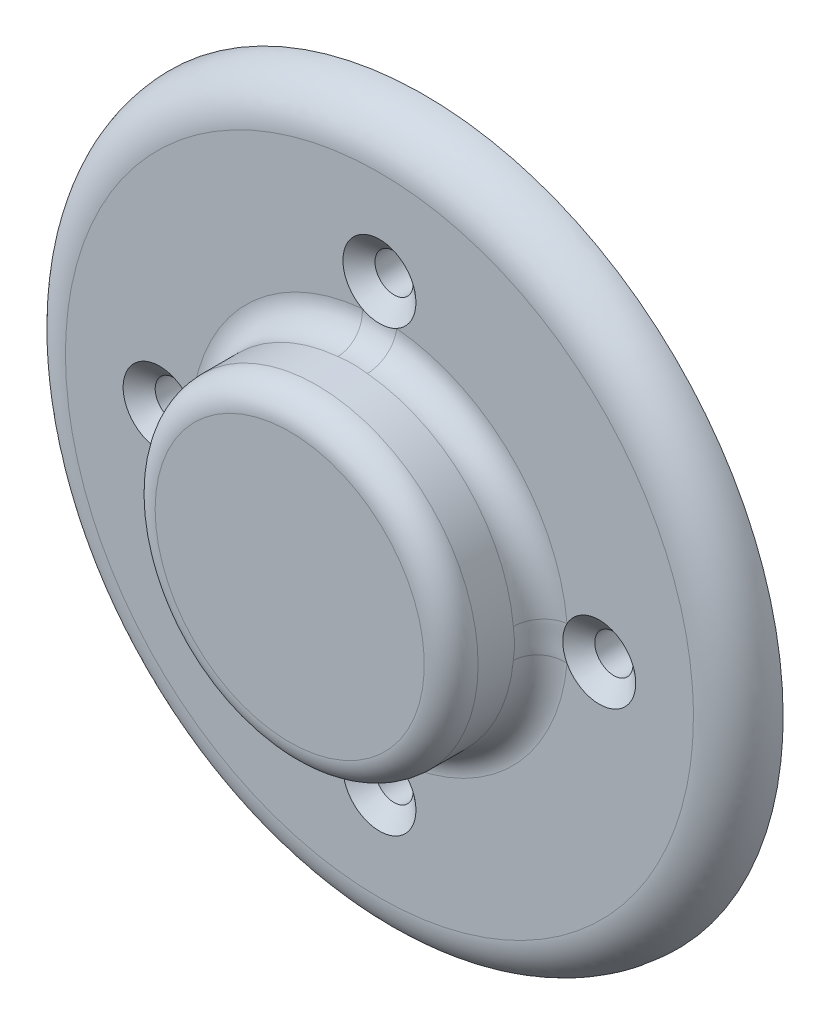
ISO-10303-21;
HEADER;
FILE_DESCRIPTION(('STEP AP214'),'2;1');
FILE_NAME('part.step','',(''),(''),'','','');
FILE_SCHEMA(('AUTOMOTIVE_DESIGN { 1 0 10303 214 1 1 1 1 }'));
ENDSEC;
DATA;
#1=APPLICATION_CONTEXT('core data for automotive mechanical design processes');
#2=APPLICATION_PROTOCOL_DEFINITION('international standard','automotive_design',2000,#1);
#3=PRODUCT_CONTEXT('',#1,'mechanical');
#4=PRODUCT('Part','Part','',(#3));
#5=PRODUCT_RELATED_PRODUCT_CATEGORY('part','',(#4));
#6=PRODUCT_DEFINITION_FORMATION('','',#4);
#7=PRODUCT_DEFINITION_CONTEXT('part definition',#1,'design');
#8=PRODUCT_DEFINITION('design','',#6,#7);
#9=PRODUCT_DEFINITION_SHAPE('','',#8);
#10=(LENGTH_UNIT() NAMED_UNIT(*) SI_UNIT(.MILLI.,.METRE.));
#11=(NAMED_UNIT(*) PLANE_ANGLE_UNIT() SI_UNIT($,.RADIAN.));
#12=(NAMED_UNIT(*) SI_UNIT($,.STERADIAN.) SOLID_ANGLE_UNIT());
#13=UNCERTAINTY_MEASURE_WITH_UNIT(LENGTH_MEASURE(1.E-05),#10,'distance_accuracy_value','');
#14=(GEOMETRIC_REPRESENTATION_CONTEXT(3) GLOBAL_UNCERTAINTY_ASSIGNED_CONTEXT((#13)) GLOBAL_UNIT_ASSIGNED_CONTEXT((#10,
#11,#12)) REPRESENTATION_CONTEXT('',''));
#15=CARTESIAN_POINT('',(0.,0.,0.));
#16=DIRECTION('',(0.,0.,1.));
#17=DIRECTION('',(1.,0.,0.));
#18=AXIS2_PLACEMENT_3D('',#15,#16,#17);
#19=CARTESIAN_POINT('',(111.125,0.,-31.75));
#20=CARTESIAN_POINT('',(111.125,7.27311424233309,-31.75));
#21=CARTESIAN_POINT('',(110.408678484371,14.5460486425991,-31.75));
#22=CARTESIAN_POINT('',(107.570850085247,28.8127754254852,-31.75));
#23=CARTESIAN_POINT('',(105.449413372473,35.8062150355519,-31.75));
#24=CARTESIAN_POINT('',(99.8828127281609,49.245177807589,-31.75));
#25=CARTESIAN_POINT('',(96.4377864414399,55.6903686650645,-31.75));
#26=CARTESIAN_POINT('',(88.3563348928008,67.7851156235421,-31.75));
#27=CARTESIAN_POINT('',(83.7201094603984,73.4343726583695,-31.75));
#28=CARTESIAN_POINT('',(73.4343726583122,83.7201094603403,-31.75));
#29=CARTESIAN_POINT('',(67.7851156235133,88.3563348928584,-31.75));
#30=CARTESIAN_POINT('',(55.6903686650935,96.4377864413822,-31.75));
#31=CARTESIAN_POINT('',(49.2451778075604,99.8828127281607,-31.75));
#32=CARTESIAN_POINT('',(35.8062150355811,105.449413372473,-31.75));
#33=CARTESIAN_POINT('',(28.8127754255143,107.570850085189,-31.75));
#34=CARTESIAN_POINT('',(14.5460486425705,110.408678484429,-31.75));
#35=CARTESIAN_POINT('',(7.27311424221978,111.125,-31.75));
#36=CARTESIAN_POINT('',(-7.27311424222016,111.125,-31.75));
#37=CARTESIAN_POINT('',(-14.5460486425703,110.408678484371,-31.75));
#38=CARTESIAN_POINT('',(-28.8127754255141,107.570850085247,-31.75));
#39=CARTESIAN_POINT('',(-35.8062150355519,105.44941337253,-31.75));
#40=CARTESIAN_POINT('',(-49.2451778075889,99.8828127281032,-31.75));
#41=CARTESIAN_POINT('',(-55.6903686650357,96.4377864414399,-31.75));
#42=CARTESIAN_POINT('',(-67.7851156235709,88.3563348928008,-31.75));
#43=CARTESIAN_POINT('',(-73.4343726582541,83.7201094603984,-31.75));
#44=CARTESIAN_POINT('',(-83.7201094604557,73.4343726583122,-31.75));
#45=CARTESIAN_POINT('',(-88.3563348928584,67.7851156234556,-31.75));
#46=CARTESIAN_POINT('',(-96.4377864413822,55.6903686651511,-31.75));
#47=CARTESIAN_POINT('',(-99.8828127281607,49.2451778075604,-31.75));
#48=CARTESIAN_POINT('',(-105.449413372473,35.8062150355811,-31.75));
#49=CARTESIAN_POINT('',(-107.570850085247,28.8127754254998,-31.75));
#50=CARTESIAN_POINT('',(-110.408678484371,14.5460486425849,-31.75));
#51=CARTESIAN_POINT('',(-111.125,7.27311424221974,-31.75));
#52=CARTESIAN_POINT('',(-111.125,-7.27311424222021,-31.75));
#53=CARTESIAN_POINT('',(-110.408678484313,-14.5460486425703,-31.75));
#54=CARTESIAN_POINT('',(-107.570850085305,-28.812775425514,-31.75));
#55=CARTESIAN_POINT('',(-105.44941337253,-35.8062150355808,-31.75));
#56=CARTESIAN_POINT('',(-99.8828127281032,-49.2451778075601,-31.75));
#57=CARTESIAN_POINT('',(-96.4377864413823,-55.690368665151,-31.75));
#58=CARTESIAN_POINT('',(-88.3563348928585,-67.7851156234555,-31.75));
#59=CARTESIAN_POINT('',(-83.7201094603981,-73.4343726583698,-31.75));
#60=CARTESIAN_POINT('',(-73.434372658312,-83.7201094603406,-31.75));
#61=CARTESIAN_POINT('',(-67.7851156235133,-88.3563348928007,-31.75));
#62=CARTESIAN_POINT('',(-55.6903686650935,-96.4377864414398,-31.75));
#63=CARTESIAN_POINT('',(-49.2451778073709,-99.8828127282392,-31.75));
#64=CARTESIAN_POINT('',(-35.8062150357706,-105.449413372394,-31.75));
#65=CARTESIAN_POINT('',(-28.8127754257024,-107.570850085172,-31.75));
#66=CARTESIAN_POINT('',(-14.5460486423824,-110.408678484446,-31.75));
#67=CARTESIAN_POINT('',(-7.27311424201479,-111.125,-31.75));
#68=CARTESIAN_POINT('',(7.27311424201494,-111.125,-31.75));
#69=CARTESIAN_POINT('',(14.5460486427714,-110.408678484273,-31.75));
#70=CARTESIAN_POINT('',(28.8127754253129,-107.570850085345,-31.75));
#71=CARTESIAN_POINT('',(35.8062150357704,-105.449413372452,-31.75));
#72=CARTESIAN_POINT('',(49.2451778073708,-99.8828127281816,-31.75));
#73=CARTESIAN_POINT('',(55.6903686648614,-96.4377864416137,-31.75));
#74=CARTESIAN_POINT('',(67.7851156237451,-88.3563348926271,-31.75));
#75=CARTESIAN_POINT('',(73.4343726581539,-83.720109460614,-31.75));
#76=CARTESIAN_POINT('',(83.7201094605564,-73.4343726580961,-31.75));
#77=CARTESIAN_POINT('',(88.3563348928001,-67.7851156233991,-31.75));
#78=CARTESIAN_POINT('',(96.4377864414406,-55.6903686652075,-31.75));
#79=CARTESIAN_POINT('',(99.882812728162,-49.2451778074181,-31.75));
#80=CARTESIAN_POINT('',(105.449413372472,-35.806215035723,-31.75));
#81=CARTESIAN_POINT('',(107.570850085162,-28.8127754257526,-31.75));
#82=CARTESIAN_POINT('',(110.408678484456,-14.546048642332,-31.75));
#83=CARTESIAN_POINT('',(111.125,-7.27311424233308,-31.75));
#84=CARTESIAN_POINT('',(111.125,0.,-31.75));
#85=CARTESIAN_POINT('',(127.,0.,-31.75));
#86=CARTESIAN_POINT('',(127.,8.31213056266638,-31.75));
#87=CARTESIAN_POINT('',(126.181346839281,16.6240555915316,-31.75));
#88=CARTESIAN_POINT('',(122.938114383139,32.9288862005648,-31.75));
#89=CARTESIAN_POINT('',(120.513615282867,40.9213886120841,-31.75));
#90=CARTESIAN_POINT('',(114.151785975,56.2802032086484,-31.75));
#91=CARTESIAN_POINT('',(110.214613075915,63.6461356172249,-31.75));
#92=CARTESIAN_POINT('',(100.978668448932,77.4687035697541,-31.75));
#93=CARTESIAN_POINT('',(95.6801250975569,83.9249973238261,-31.75));
#94=CARTESIAN_POINT('',(83.9249973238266,95.6801250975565,-31.75));
#95=CARTESIAN_POINT('',(77.4687035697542,100.978668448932,-31.75));
#96=CARTESIAN_POINT('',(63.6461356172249,110.214613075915,-31.75));
#97=CARTESIAN_POINT('',(56.2802032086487,114.151785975,-31.75));
#98=CARTESIAN_POINT('',(40.9213886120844,120.513615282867,-31.75));
#99=CARTESIAN_POINT('',(32.9288862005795,122.938114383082,-31.75));
#100=CARTESIAN_POINT('',(16.6240555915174,126.181346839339,-31.75));
#101=CARTESIAN_POINT('',(8.31213056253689,127.,-31.75));
#102=CARTESIAN_POINT('',(-8.31213056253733,127.,-31.75));
#103=CARTESIAN_POINT('',(-16.6240555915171,126.181346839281,-31.75));
#104=CARTESIAN_POINT('',(-32.9288862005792,122.938114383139,-31.75));
#105=CARTESIAN_POINT('',(-40.9213886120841,120.513615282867,-31.75));
#106=CARTESIAN_POINT('',(-56.2802032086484,114.151785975,-31.75));
#107=CARTESIAN_POINT('',(-63.6461356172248,110.214613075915,-31.75));
#108=CARTESIAN_POINT('',(-77.4687035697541,100.978668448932,-31.75));
#109=CARTESIAN_POINT('',(-83.9249973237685,95.6801250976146,-31.75));
#110=CARTESIAN_POINT('',(-95.6801250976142,83.9249973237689,-31.75));
#111=CARTESIAN_POINT('',(-100.978668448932,77.4687035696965,-31.75));
#112=CARTESIAN_POINT('',(-110.214613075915,63.6461356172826,-31.75));
#113=CARTESIAN_POINT('',(-114.151785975,56.2802032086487,-31.75));
#114=CARTESIAN_POINT('',(-120.513615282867,40.9213886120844,-31.75));
#115=CARTESIAN_POINT('',(-122.938114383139,32.928886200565,-31.75));
#116=CARTESIAN_POINT('',(-126.181346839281,16.6240555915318,-31.75));
#117=CARTESIAN_POINT('',(-127.,8.31213056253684,-31.75));
#118=CARTESIAN_POINT('',(-127.,-8.31213056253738,-31.75));
#119=CARTESIAN_POINT('',(-126.181346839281,-16.6240555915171,-31.75));
#120=CARTESIAN_POINT('',(-122.938114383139,-32.9288862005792,-31.75));
#121=CARTESIAN_POINT('',(-120.513615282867,-40.9213886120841,-31.75));
#122=CARTESIAN_POINT('',(-114.151785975,-56.2802032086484,-31.75));
#123=CARTESIAN_POINT('',(-110.214613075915,-63.6461356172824,-31.75));
#124=CARTESIAN_POINT('',(-100.978668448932,-77.4687035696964,-31.75));
#125=CARTESIAN_POINT('',(-95.6801250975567,-83.9249973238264,-31.75));
#126=CARTESIAN_POINT('',(-83.9249973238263,-95.6801250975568,-31.75));
#127=CARTESIAN_POINT('',(-77.4687035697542,-100.978668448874,-31.75));
#128=CARTESIAN_POINT('',(-63.6461356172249,-110.214613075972,-31.75));
#129=CARTESIAN_POINT('',(-56.2802032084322,-114.151785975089,-31.75));
#130=CARTESIAN_POINT('',(-40.921388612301,-120.513615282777,-31.75));
#131=CARTESIAN_POINT('',(-32.928886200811,-122.93811438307,-31.75));
#132=CARTESIAN_POINT('',(-16.6240555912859,-126.181346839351,-31.75));
#133=CARTESIAN_POINT('',(-8.31213056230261,-127.,-31.75));
#134=CARTESIAN_POINT('',(8.31213056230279,-127.,-31.75));
#135=CARTESIAN_POINT('',(16.624055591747,-126.181346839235,-31.75));
#136=CARTESIAN_POINT('',(32.9288862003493,-122.938114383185,-31.75));
#137=CARTESIAN_POINT('',(40.9213886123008,-120.513615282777,-31.75));
#138=CARTESIAN_POINT('',(56.280203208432,-114.151785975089,-31.75));
#139=CARTESIAN_POINT('',(63.6461356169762,-110.214613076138,-31.75));
#140=CARTESIAN_POINT('',(77.4687035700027,-100.978668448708,-31.75));
#141=CARTESIAN_POINT('',(83.9249973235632,-95.6801250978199,-31.75));
#142=CARTESIAN_POINT('',(95.68012509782,-83.9249973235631,-31.75));
#143=CARTESIAN_POINT('',(100.978668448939,-77.468703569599,-31.75));
#144=CARTESIAN_POINT('',(110.214613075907,-63.64613561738,-31.75));
#145=CARTESIAN_POINT('',(114.151785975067,-56.2802032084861,-31.75));
#146=CARTESIAN_POINT('',(120.5136152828,-40.9213886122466,-31.75));
#147=CARTESIAN_POINT('',(122.938114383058,-32.9288862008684,-31.75));
#148=CARTESIAN_POINT('',(126.181346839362,-16.6240555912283,-31.75));
#149=CARTESIAN_POINT('',(127.,-8.31213056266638,-31.75));
#150=CARTESIAN_POINT('',(127.,0.,-31.75));
#151=CARTESIAN_POINT('',(127.,0.,-47.625));
#152=CARTESIAN_POINT('',(127.,8.31213056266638,-47.625));
#153=CARTESIAN_POINT('',(126.181346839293,16.624055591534,-47.625));
#154=CARTESIAN_POINT('',(122.938114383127,32.9288862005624,-47.625));
#155=CARTESIAN_POINT('',(120.513615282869,40.9213886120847,-47.625));
#156=CARTESIAN_POINT('',(114.151785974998,56.2802032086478,-47.625));
#157=CARTESIAN_POINT('',(110.214613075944,63.6461356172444,-47.625));
#158=CARTESIAN_POINT('',(100.978668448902,77.4687035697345,-47.625));
#159=CARTESIAN_POINT('',(95.6801250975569,83.9249973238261,-47.625));
#160=CARTESIAN_POINT('',(83.9249973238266,95.6801250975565,-47.625));
#161=CARTESIAN_POINT('',(77.4687035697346,100.978668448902,-47.625));
#162=CARTESIAN_POINT('',(63.6461356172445,110.214613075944,-47.625));
#163=CARTESIAN_POINT('',(56.2802032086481,114.151785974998,-47.625));
#164=CARTESIAN_POINT('',(40.921388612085,120.513615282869,-47.625));
#165=CARTESIAN_POINT('',(32.9288862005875,122.938114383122,-47.625));
#166=CARTESIAN_POINT('',(16.6240555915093,126.181346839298,-47.625));
#167=CARTESIAN_POINT('',(8.31213056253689,127.,-47.625));
#168=CARTESIAN_POINT('',(-8.31213056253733,127.,-47.625));
#169=CARTESIAN_POINT('',(-16.6240555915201,126.181346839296,-47.625));
#170=CARTESIAN_POINT('',(-32.9288862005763,122.938114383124,-47.625));
#171=CARTESIAN_POINT('',(-40.9213886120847,120.513615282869,-47.625));
#172=CARTESIAN_POINT('',(-56.2802032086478,114.151785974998,-47.625));
#173=CARTESIAN_POINT('',(-63.6461356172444,110.214613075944,-47.625));
#174=CARTESIAN_POINT('',(-77.4687035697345,100.978668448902,-47.625));
#175=CARTESIAN_POINT('',(-83.9249973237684,95.6801250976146,-47.625));
#176=CARTESIAN_POINT('',(-95.6801250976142,83.9249973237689,-47.625));
#177=CARTESIAN_POINT('',(-100.978668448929,77.4687035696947,-47.625));
#178=CARTESIAN_POINT('',(-110.214613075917,63.6461356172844,-47.625));
#179=CARTESIAN_POINT('',(-114.151785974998,56.2802032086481,-47.625));
#180=CARTESIAN_POINT('',(-120.513615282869,40.921388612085,-47.625));
#181=CARTESIAN_POINT('',(-122.938114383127,32.9288862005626,-47.625));
#182=CARTESIAN_POINT('',(-126.181346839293,16.6240555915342,-47.625));
#183=CARTESIAN_POINT('',(-127.,8.31213056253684,-47.625));
#184=CARTESIAN_POINT('',(-127.,-8.31213056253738,-47.625));
#185=CARTESIAN_POINT('',(-126.181346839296,-16.6240555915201,-47.625));
#186=CARTESIAN_POINT('',(-122.938114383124,-32.9288862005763,-47.625));
#187=CARTESIAN_POINT('',(-120.513615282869,-40.9213886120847,-47.625));
#188=CARTESIAN_POINT('',(-114.151785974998,-56.2802032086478,-47.625));
#189=CARTESIAN_POINT('',(-110.214613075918,-63.6461356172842,-47.625));
#190=CARTESIAN_POINT('',(-100.978668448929,-77.4687035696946,-47.625));
#191=CARTESIAN_POINT('',(-95.6801250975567,-83.9249973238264,-47.625));
#192=CARTESIAN_POINT('',(-83.9249973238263,-95.6801250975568,-47.625));
#193=CARTESIAN_POINT('',(-77.4687035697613,-100.978668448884,-47.625));
#194=CARTESIAN_POINT('',(-63.6461356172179,-110.214613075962,-47.625));
#195=CARTESIAN_POINT('',(-56.2802032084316,-114.151785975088,-47.625));
#196=CARTESIAN_POINT('',(-40.9213886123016,-120.513615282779,-47.625));
#197=CARTESIAN_POINT('',(-32.9288862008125,-122.938114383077,-47.625));
#198=CARTESIAN_POINT('',(-16.6240555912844,-126.181346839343,-47.625));
#199=CARTESIAN_POINT('',(-8.31213056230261,-127.,-47.625));
#200=CARTESIAN_POINT('',(8.31213056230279,-127.,-47.625));
#201=CARTESIAN_POINT('',(16.62405559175,-126.18134683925,-47.625));
#202=CARTESIAN_POINT('',(32.9288862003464,-122.93811438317,-47.625));
#203=CARTESIAN_POINT('',(40.9213886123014,-120.513615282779,-47.625));
#204=CARTESIAN_POINT('',(56.2802032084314,-114.151785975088,-47.625));
#205=CARTESIAN_POINT('',(63.6461356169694,-110.214613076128,-47.625));
#206=CARTESIAN_POINT('',(77.4687035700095,-100.978668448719,-47.625));
#207=CARTESIAN_POINT('',(83.9249973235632,-95.6801250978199,-47.625));
#208=CARTESIAN_POINT('',(95.68012509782,-83.9249973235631,-47.625));
#209=CARTESIAN_POINT('',(100.978668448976,-77.4687035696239,-47.625));
#210=CARTESIAN_POINT('',(110.21461307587,-63.6461356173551,-47.625));
#211=CARTESIAN_POINT('',(114.151785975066,-56.2802032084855,-47.625));
#212=CARTESIAN_POINT('',(120.513615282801,-40.9213886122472,-47.625));
#213=CARTESIAN_POINT('',(122.938114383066,-32.9288862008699,-47.625));
#214=CARTESIAN_POINT('',(126.181346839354,-16.6240555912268,-47.625));
#215=CARTESIAN_POINT('',(127.,-8.31213056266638,-47.625));
#216=CARTESIAN_POINT('',(127.,0.,-47.625));
#217=(BOUNDED_SURFACE() B_SPLINE_SURFACE(2,3,((#19,#20,#21,#22,#23,#24,#25,#26,#27,#28,#29,#30,
#31,#32,#33,#34,#35,#36,#37,#38,#39,#40,#41,#42,#43,#44,#45,#46,#47,#48,#49,#50,#51,#52,#53,#54,
#55,#56,#57,#58,#59,#60,#61,#62,#63,#64,#65,#66,#67,#68,#69,#70,#71,#72,#73,#74,#75,#76,#77,#78,
#79,#80,#81,#82,#83,#84),(#85,#86,#87,#88,#89,#90,#91,#92,#93,#94,#95,#96,#97,#98,#99,#100,#101,
#102,#103,#104,#105,#106,#107,#108,#109,#110,#111,#112,#113,#114,#115,#116,#117,#118,#119,#120,
#121,#122,#123,#124,#125,#126,#127,#128,#129,#130,#131,#132,#133,#134,#135,#136,#137,#138,#139,
#140,#141,#142,#143,#144,#145,#146,#147,#148,#149,#150),(#151,#152,#153,#154,#155,#156,#157,
#158,#159,#160,#161,#162,#163,#164,#165,#166,#167,#168,#169,#170,#171,#172,#173,#174,#175,#176,
#177,#178,#179,#180,#181,#182,#183,#184,#185,#186,#187,#188,#189,#190,#191,#192,#193,#194,#195,
#196,#197,#198,#199,#200,#201,#202,#203,#204,#205,#206,#207,#208,#209,#210,#211,#212,#213,#214,
#215,#216)),.UNSPECIFIED.,.F.,.T.,.F.) B_SPLINE_SURFACE_WITH_KNOTS((3,3),(4,2,2,2,2,2,2,2,2,2,2,
2,2,2,2,2,2,2,2,2,2,2,2,2,2,2,2,2,2,2,2,2,4),(0.,1.),(-6.28318530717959,-6.08683576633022,
-5.89048622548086,-5.6941366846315,-5.49778714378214,-5.30143760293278,-5.10508806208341,
-4.90873852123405,-4.71238898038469,-4.51603943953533,-4.31968989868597,-4.1233403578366,
-3.92699081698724,-3.73064127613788,-3.53429173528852,-3.33794219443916,-3.14159265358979,
-2.94524311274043,-2.74889357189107,-2.55254403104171,-2.35619449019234,-2.15984494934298,
-1.96349540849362,-1.76714586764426,-1.5707963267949,-1.37444678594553,-1.17809724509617,
-0.98174770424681,-0.785398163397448,-0.589048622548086,-0.392699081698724,-0.196349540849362,
0.),.UNSPECIFIED.) GEOMETRIC_REPRESENTATION_ITEM() RATIONAL_B_SPLINE_SURFACE(((1.,1.,1.,1.,1.,
1.,1.,1.,1.,1.,1.,1.,1.,1.,1.,1.,1.,1.,1.,1.,1.,1.,1.,1.,1.,1.,1.,1.,1.,1.,1.,1.,1.,1.,1.,1.,1.,
1.,1.,1.,1.,1.,1.,1.,1.,1.,1.,1.,1.,1.,1.,1.,1.,1.,1.,1.,1.,1.,1.,1.,1.,1.,1.,1.,1.,1.),
(0.707106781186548,0.707106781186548,0.707106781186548,0.707106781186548,0.707106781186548,
0.707106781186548,0.707106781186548,0.707106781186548,0.707106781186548,0.707106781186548,
0.707106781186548,0.707106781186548,0.707106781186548,0.707106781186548,0.707106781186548,
0.707106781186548,0.707106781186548,0.707106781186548,0.707106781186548,0.707106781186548,
0.707106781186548,0.707106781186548,0.707106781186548,0.707106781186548,0.707106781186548,
0.707106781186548,0.707106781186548,0.707106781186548,0.707106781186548,0.707106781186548,
0.707106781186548,0.707106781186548,0.707106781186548,0.707106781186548,0.707106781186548,
0.707106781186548,0.707106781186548,0.707106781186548,0.707106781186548,0.707106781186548,
0.707106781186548,0.707106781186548,0.707106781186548,0.707106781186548,0.707106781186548,
0.707106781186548,0.707106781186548,0.707106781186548,0.707106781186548,0.707106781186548,
0.707106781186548,0.707106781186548,0.707106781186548,0.707106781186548,0.707106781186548,
0.707106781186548,0.707106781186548,0.707106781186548,0.707106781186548,0.707106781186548,
0.707106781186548,0.707106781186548,0.707106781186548,0.707106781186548,0.707106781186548,
0.707106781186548),(1.,1.,1.,1.,1.,1.,1.,1.,1.,1.,1.,1.,1.,1.,1.,1.,1.,1.,1.,1.,1.,1.,1.,1.,1.,
1.,1.,1.,1.,1.,1.,1.,1.,1.,1.,1.,1.,1.,1.,1.,1.,1.,1.,1.,1.,1.,1.,1.,1.,1.,1.,1.,1.,1.,1.,1.,1.,
1.,1.,1.,1.,1.,1.,1.,1.,1.))) REPRESENTATION_ITEM('') SURFACE());
#218=CARTESIAN_POINT('',(111.125,0.,-31.75));
#219=CARTESIAN_POINT('',(111.125,-7.27311424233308,-31.75));
#220=CARTESIAN_POINT('',(110.408678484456,-14.546048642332,-31.75));
#221=CARTESIAN_POINT('',(107.570850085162,-28.8127754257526,-31.75));
#222=CARTESIAN_POINT('',(105.449413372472,-35.806215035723,-31.75));
#223=CARTESIAN_POINT('',(99.882812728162,-49.2451778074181,-31.75));
#224=CARTESIAN_POINT('',(96.4377864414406,-55.6903686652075,-31.75));
#225=CARTESIAN_POINT('',(88.3563348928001,-67.7851156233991,-31.75));
#226=CARTESIAN_POINT('',(83.7201094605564,-73.4343726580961,-31.75));
#227=CARTESIAN_POINT('',(73.4343726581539,-83.720109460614,-31.75));
#228=CARTESIAN_POINT('',(67.7851156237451,-88.3563348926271,-31.75));
#229=CARTESIAN_POINT('',(55.6903686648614,-96.4377864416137,-31.75));
#230=CARTESIAN_POINT('',(49.2451778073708,-99.8828127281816,-31.75));
#231=CARTESIAN_POINT('',(35.8062150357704,-105.449413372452,-31.75));
#232=CARTESIAN_POINT('',(28.8127754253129,-107.570850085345,-31.75));
#233=CARTESIAN_POINT('',(14.5460486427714,-110.408678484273,-31.75));
#234=CARTESIAN_POINT('',(7.27311424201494,-111.125,-31.75));
#235=CARTESIAN_POINT('',(-7.27311424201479,-111.125,-31.75));
#236=CARTESIAN_POINT('',(-14.5460486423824,-110.408678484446,-31.75));
#237=CARTESIAN_POINT('',(-28.8127754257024,-107.570850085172,-31.75));
#238=CARTESIAN_POINT('',(-35.8062150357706,-105.449413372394,-31.75));
#239=CARTESIAN_POINT('',(-49.2451778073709,-99.8828127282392,-31.75));
#240=CARTESIAN_POINT('',(-55.6903686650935,-96.4377864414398,-31.75));
#241=CARTESIAN_POINT('',(-67.7851156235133,-88.3563348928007,-31.75));
#242=CARTESIAN_POINT('',(-73.434372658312,-83.7201094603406,-31.75));
#243=CARTESIAN_POINT('',(-83.7201094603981,-73.4343726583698,-31.75));
#244=CARTESIAN_POINT('',(-88.3563348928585,-67.7851156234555,-31.75));
#245=CARTESIAN_POINT('',(-96.4377864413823,-55.690368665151,-31.75));
#246=CARTESIAN_POINT('',(-99.8828127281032,-49.2451778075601,-31.75));
#247=CARTESIAN_POINT('',(-105.44941337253,-35.8062150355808,-31.75));
#248=CARTESIAN_POINT('',(-107.570850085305,-28.812775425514,-31.75));
#249=CARTESIAN_POINT('',(-110.408678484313,-14.5460486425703,-31.75));
#250=CARTESIAN_POINT('',(-111.125,-7.27311424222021,-31.75));
#251=CARTESIAN_POINT('',(-111.125,7.27311424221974,-31.75));
#252=CARTESIAN_POINT('',(-110.408678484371,14.5460486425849,-31.75));
#253=CARTESIAN_POINT('',(-107.570850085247,28.8127754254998,-31.75));
#254=CARTESIAN_POINT('',(-105.449413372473,35.8062150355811,-31.75));
#255=CARTESIAN_POINT('',(-99.8828127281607,49.2451778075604,-31.75));
#256=CARTESIAN_POINT('',(-96.4377864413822,55.6903686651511,-31.75));
#257=CARTESIAN_POINT('',(-88.3563348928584,67.7851156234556,-31.75));
#258=CARTESIAN_POINT('',(-83.7201094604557,73.4343726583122,-31.75));
#259=CARTESIAN_POINT('',(-73.4343726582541,83.7201094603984,-31.75));
#260=CARTESIAN_POINT('',(-67.7851156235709,88.3563348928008,-31.75));
#261=CARTESIAN_POINT('',(-55.6903686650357,96.4377864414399,-31.75));
#262=CARTESIAN_POINT('',(-49.2451778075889,99.8828127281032,-31.75));
#263=CARTESIAN_POINT('',(-35.8062150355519,105.44941337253,-31.75));
#264=CARTESIAN_POINT('',(-28.8127754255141,107.570850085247,-31.75));
#265=CARTESIAN_POINT('',(-14.5460486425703,110.408678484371,-31.75));
#266=CARTESIAN_POINT('',(-7.27311424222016,111.125,-31.75));
#267=CARTESIAN_POINT('',(7.27311424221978,111.125,-31.75));
#268=CARTESIAN_POINT('',(14.5460486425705,110.408678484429,-31.75));
#269=CARTESIAN_POINT('',(28.8127754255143,107.570850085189,-31.75));
#270=CARTESIAN_POINT('',(35.8062150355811,105.449413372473,-31.75));
#271=CARTESIAN_POINT('',(49.2451778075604,99.8828127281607,-31.75));
#272=CARTESIAN_POINT('',(55.6903686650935,96.4377864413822,-31.75));
#273=CARTESIAN_POINT('',(67.7851156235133,88.3563348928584,-31.75));
#274=CARTESIAN_POINT('',(73.4343726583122,83.7201094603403,-31.75));
#275=CARTESIAN_POINT('',(83.7201094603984,73.4343726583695,-31.75));
#276=CARTESIAN_POINT('',(88.3563348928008,67.7851156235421,-31.75));
#277=CARTESIAN_POINT('',(96.4377864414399,55.6903686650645,-31.75));
#278=CARTESIAN_POINT('',(99.8828127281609,49.245177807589,-31.75));
#279=CARTESIAN_POINT('',(105.449413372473,35.8062150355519,-31.75));
#280=CARTESIAN_POINT('',(107.570850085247,28.8127754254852,-31.75));
#281=CARTESIAN_POINT('',(110.408678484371,14.5460486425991,-31.75));
#282=CARTESIAN_POINT('',(111.125,7.27311424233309,-31.75));
#283=CARTESIAN_POINT('',(111.125,0.,-31.75));
#284=(BOUNDED_CURVE() B_SPLINE_CURVE(3,(#218,#219,#220,#221,#222,#223,#224,#225,#226,#227,#228,
#229,#230,#231,#232,#233,#234,#235,#236,#237,#238,#239,#240,#241,#242,#243,#244,#245,#246,#247,
#248,#249,#250,#251,#252,#253,#254,#255,#256,#257,#258,#259,#260,#261,#262,#263,#264,#265,#266,
#267,#268,#269,#270,#271,#272,#273,#274,#275,#276,#277,#278,#279,#280,#281,#282,#283),
.UNSPECIFIED.,.T.,.F.) B_SPLINE_CURVE_WITH_KNOTS((4,2,2,2,2,2,2,2,2,2,2,2,2,2,2,2,2,2,2,2,2,2,2,
2,2,2,2,2,2,2,2,2,4),(-6.28318530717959,-6.08683576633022,-5.89048622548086,-5.6941366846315,
-5.49778714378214,-5.30143760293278,-5.10508806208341,-4.90873852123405,-4.71238898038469,
-4.51603943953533,-4.31968989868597,-4.1233403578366,-3.92699081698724,-3.73064127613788,
-3.53429173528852,-3.33794219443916,-3.14159265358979,-2.94524311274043,-2.74889357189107,
-2.55254403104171,-2.35619449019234,-2.15984494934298,-1.96349540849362,-1.76714586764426,
-1.5707963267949,-1.37444678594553,-1.17809724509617,-0.981747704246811,-0.785398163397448,
-0.589048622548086,-0.392699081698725,-0.196349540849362,0.),
.UNSPECIFIED.) CURVE() GEOMETRIC_REPRESENTATION_ITEM() RATIONAL_B_SPLINE_CURVE((1.,1.,1.,1.,1.,
1.,1.,1.,1.,1.,1.,1.,1.,1.,1.,1.,1.,1.,1.,1.,1.,1.,1.,1.,1.,1.,1.,1.,1.,1.,1.,1.,1.,1.,1.,1.,1.,
1.,1.,1.,1.,1.,1.,1.,1.,1.,1.,1.,1.,1.,1.,1.,1.,1.,1.,1.,1.,1.,1.,1.,1.,1.,1.,1.,1.,1.)) REPRESENTATION_ITEM(''));
#285=CARTESIAN_POINT('',(111.125,0.,-31.75));
#286=VERTEX_POINT('',#285);
#287=EDGE_CURVE('E11',#286,#286,#284,.F.);
#288=CARTESIAN_POINT('',(127.,0.,-47.625));
#289=CARTESIAN_POINT('',(127.,8.31213056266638,-47.625));
#290=CARTESIAN_POINT('',(126.181346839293,16.624055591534,-47.625));
#291=CARTESIAN_POINT('',(122.938114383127,32.9288862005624,-47.625));
#292=CARTESIAN_POINT('',(120.513615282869,40.9213886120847,-47.625));
#293=CARTESIAN_POINT('',(114.151785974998,56.2802032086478,-47.625));
#294=CARTESIAN_POINT('',(110.214613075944,63.6461356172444,-47.625));
#295=CARTESIAN_POINT('',(100.978668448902,77.4687035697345,-47.625));
#296=CARTESIAN_POINT('',(95.6801250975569,83.9249973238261,-47.625));
#297=CARTESIAN_POINT('',(83.9249973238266,95.6801250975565,-47.625));
#298=CARTESIAN_POINT('',(77.4687035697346,100.978668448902,-47.625));
#299=CARTESIAN_POINT('',(63.6461356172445,110.214613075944,-47.625));
#300=CARTESIAN_POINT('',(56.2802032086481,114.151785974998,-47.625));
#301=CARTESIAN_POINT('',(40.921388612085,120.513615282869,-47.625));
#302=CARTESIAN_POINT('',(32.9288862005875,122.938114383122,-47.625));
#303=CARTESIAN_POINT('',(16.6240555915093,126.181346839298,-47.625));
#304=CARTESIAN_POINT('',(8.31213056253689,127.,-47.625));
#305=CARTESIAN_POINT('',(-8.31213056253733,127.,-47.625));
#306=CARTESIAN_POINT('',(-16.6240555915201,126.181346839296,-47.625));
#307=CARTESIAN_POINT('',(-32.9288862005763,122.938114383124,-47.625));
#308=CARTESIAN_POINT('',(-40.9213886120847,120.513615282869,-47.625));
#309=CARTESIAN_POINT('',(-56.2802032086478,114.151785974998,-47.625));
#310=CARTESIAN_POINT('',(-63.6461356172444,110.214613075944,-47.625));
#311=CARTESIAN_POINT('',(-77.4687035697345,100.978668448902,-47.625));
#312=CARTESIAN_POINT('',(-83.9249973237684,95.6801250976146,-47.625));
#313=CARTESIAN_POINT('',(-95.6801250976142,83.9249973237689,-47.625));
#314=CARTESIAN_POINT('',(-100.978668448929,77.4687035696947,-47.625));
#315=CARTESIAN_POINT('',(-110.214613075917,63.6461356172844,-47.625));
#316=CARTESIAN_POINT('',(-114.151785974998,56.2802032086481,-47.625));
#317=CARTESIAN_POINT('',(-120.513615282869,40.921388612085,-47.625));
#318=CARTESIAN_POINT('',(-122.938114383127,32.9288862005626,-47.625));
#319=CARTESIAN_POINT('',(-126.181346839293,16.6240555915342,-47.625));
#320=CARTESIAN_POINT('',(-127.,8.31213056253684,-47.625));
#321=CARTESIAN_POINT('',(-127.,-8.31213056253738,-47.625));
#322=CARTESIAN_POINT('',(-126.181346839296,-16.6240555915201,-47.625));
#323=CARTESIAN_POINT('',(-122.938114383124,-32.9288862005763,-47.625));
#324=CARTESIAN_POINT('',(-120.513615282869,-40.9213886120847,-47.625));
#325=CARTESIAN_POINT('',(-114.151785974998,-56.2802032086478,-47.625));
#326=CARTESIAN_POINT('',(-110.214613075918,-63.6461356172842,-47.625));
#327=CARTESIAN_POINT('',(-100.978668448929,-77.4687035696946,-47.625));
#328=CARTESIAN_POINT('',(-95.6801250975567,-83.9249973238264,-47.625));
#329=CARTESIAN_POINT('',(-83.9249973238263,-95.6801250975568,-47.625));
#330=CARTESIAN_POINT('',(-77.4687035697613,-100.978668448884,-47.625));
#331=CARTESIAN_POINT('',(-63.6461356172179,-110.214613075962,-47.625));
#332=CARTESIAN_POINT('',(-56.2802032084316,-114.151785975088,-47.625));
#333=CARTESIAN_POINT('',(-40.9213886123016,-120.513615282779,-47.625));
#334=CARTESIAN_POINT('',(-32.9288862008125,-122.938114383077,-47.625));
#335=CARTESIAN_POINT('',(-16.6240555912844,-126.181346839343,-47.625));
#336=CARTESIAN_POINT('',(-8.31213056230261,-127.,-47.625));
#337=CARTESIAN_POINT('',(8.31213056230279,-127.,-47.625));
#338=CARTESIAN_POINT('',(16.62405559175,-126.18134683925,-47.625));
#339=CARTESIAN_POINT('',(32.9288862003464,-122.93811438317,-47.625));
#340=CARTESIAN_POINT('',(40.9213886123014,-120.513615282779,-47.625));
#341=CARTESIAN_POINT('',(56.2802032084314,-114.151785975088,-47.625));
#342=CARTESIAN_POINT('',(63.6461356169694,-110.214613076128,-47.625));
#343=CARTESIAN_POINT('',(77.4687035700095,-100.978668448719,-47.625));
#344=CARTESIAN_POINT('',(83.9249973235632,-95.6801250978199,-47.625));
#345=CARTESIAN_POINT('',(95.68012509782,-83.9249973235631,-47.625));
#346=CARTESIAN_POINT('',(100.978668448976,-77.4687035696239,-47.625));
#347=CARTESIAN_POINT('',(110.21461307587,-63.6461356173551,-47.625));
#348=CARTESIAN_POINT('',(114.151785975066,-56.2802032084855,-47.625));
#349=CARTESIAN_POINT('',(120.513615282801,-40.9213886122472,-47.625));
#350=CARTESIAN_POINT('',(122.938114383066,-32.9288862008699,-47.625));
#351=CARTESIAN_POINT('',(126.181346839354,-16.6240555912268,-47.625));
#352=CARTESIAN_POINT('',(127.,-8.31213056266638,-47.625));
#353=CARTESIAN_POINT('',(127.,0.,-47.625));
#354=(BOUNDED_CURVE() B_SPLINE_CURVE(3,(#288,#289,#290,#291,#292,#293,#294,#295,#296,#297,#298,
#299,#300,#301,#302,#303,#304,#305,#306,#307,#308,#309,#310,#311,#312,#313,#314,#315,#316,#317,
#318,#319,#320,#321,#322,#323,#324,#325,#326,#327,#328,#329,#330,#331,#332,#333,#334,#335,#336,
#337,#338,#339,#340,#341,#342,#343,#344,#345,#346,#347,#348,#349,#350,#351,#352,#353),
.UNSPECIFIED.,.T.,.F.) B_SPLINE_CURVE_WITH_KNOTS((4,2,2,2,2,2,2,2,2,2,2,2,2,2,2,2,2,2,2,2,2,2,2,
2,2,2,2,2,2,2,2,2,4),(-6.28318530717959,-6.08683576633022,-5.89048622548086,-5.6941366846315,
-5.49778714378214,-5.30143760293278,-5.10508806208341,-4.90873852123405,-4.71238898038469,
-4.51603943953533,-4.31968989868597,-4.1233403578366,-3.92699081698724,-3.73064127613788,
-3.53429173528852,-3.33794219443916,-3.14159265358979,-2.94524311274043,-2.74889357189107,
-2.55254403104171,-2.35619449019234,-2.15984494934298,-1.96349540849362,-1.76714586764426,
-1.5707963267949,-1.37444678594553,-1.17809724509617,-0.98174770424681,-0.785398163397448,
-0.589048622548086,-0.392699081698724,-0.196349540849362,0.),
.UNSPECIFIED.) CURVE() GEOMETRIC_REPRESENTATION_ITEM() RATIONAL_B_SPLINE_CURVE((1.,1.,1.,1.,1.,
1.,1.,1.,1.,1.,1.,1.,1.,1.,1.,1.,1.,1.,1.,1.,1.,1.,1.,1.,1.,1.,1.,1.,1.,1.,1.,1.,1.,1.,1.,1.,1.,
1.,1.,1.,1.,1.,1.,1.,1.,1.,1.,1.,1.,1.,1.,1.,1.,1.,1.,1.,1.,1.,1.,1.,1.,1.,1.,1.,1.,1.)) REPRESENTATION_ITEM(''));
#355=CARTESIAN_POINT('',(127.,0.,-47.625));
#356=VERTEX_POINT('',#355);
#357=EDGE_CURVE('E308',#356,#356,#354,.T.);
#358=ORIENTED_EDGE('',*,*,#287,.F.);
#359=EDGE_LOOP('',(#358));
#360=FACE_BOUND('',#359,.T.);
#361=ORIENTED_EDGE('',*,*,#357,.T.);
#362=EDGE_LOOP('',(#361));
#363=FACE_BOUND('',#362,.T.);
#364=ADVANCED_FACE('F28',(#360,#363),#217,.T.);
#365=CARTESIAN_POINT('',(0.,0.,0.));
#366=DIRECTION('',(0.,0.,-1.));
#367=DIRECTION('',(-1.,0.,0.));
#368=AXIS2_PLACEMENT_3D('',#365,#366,#367);
#369=PLANE('',#368);
#370=CARTESIAN_POINT('',(0.,0.,0.));
#371=DIRECTION('',(0.,0.,-1.));
#372=DIRECTION('',(-1.,0.,0.));
#373=AXIS2_PLACEMENT_3D('',#370,#371,#372);
#374=CIRCLE('',#373,47.625);
#375=CARTESIAN_POINT('',(-47.625,0.,0.));
#376=VERTEX_POINT('',#375);
#377=EDGE_CURVE('E41',#376,#376,#374,.F.);
#378=ORIENTED_EDGE('',*,*,#377,.T.);
#379=EDGE_LOOP('',(#378));
#380=FACE_BOUND('',#379,.T.);
#381=ADVANCED_FACE('F143',(#380),#369,.F.);
#382=CARTESIAN_POINT('',(0.,0.,0.));
#383=DIRECTION('',(0.,0.,1.));
#384=DIRECTION('',(1.,0.,0.));
#385=AXIS2_PLACEMENT_3D('',#382,#383,#384);
#386=CYLINDRICAL_SURFACE('',#385,57.15);
#387=CARTESIAN_POINT('',(0.,0.,-22.225));
#388=DIRECTION('',(0.,0.,-1.));
#389=DIRECTION('',(-1.,0.,0.));
#390=AXIS2_PLACEMENT_3D('',#387,#388,#389);
#391=CIRCLE('',#390,57.15);
#392=CARTESIAN_POINT('',(5.21836240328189,-56.9112571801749,-22.225));
#393=VERTEX_POINT('',#392);
#394=CARTESIAN_POINT('',(56.9112571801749,-5.21836240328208,-22.225));
#395=VERTEX_POINT('',#394);
#396=EDGE_CURVE('E106',#393,#395,#391,.F.);
#397=ORIENTED_EDGE('',*,*,#396,.T.);
#398=CARTESIAN_POINT('',(56.3693649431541,-9.41367069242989,-22.840456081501));
#399=CARTESIAN_POINT('',(56.9278003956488,-6.069741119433,-34.2373266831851));
#400=CARTESIAN_POINT('',(68.2512203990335,-8.71090375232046,-31.75));
#401=CARTESIAN_POINT('',(56.3980348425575,-9.24201551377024,-22.7800447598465));
#402=CARTESIAN_POINT('',(56.9098921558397,-6.11449219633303,-34.1473220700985));
#403=CARTESIAN_POINT('',(68.1842131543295,-8.63752286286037,-31.75));
#404=CARTESIAN_POINT('',(56.4261287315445,-9.06894217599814,-22.7248809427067));
#405=CARTESIAN_POINT('',(56.8946328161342,-6.15022051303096,-34.051716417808));
#406=CARTESIAN_POINT('',(68.115142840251,-8.56023073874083,-31.75));
#407=CARTESIAN_POINT('',(56.4810158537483,-8.72056882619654,-22.6244709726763));
#408=CARTESIAN_POINT('',(56.869359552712,-6.20155672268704,-33.8526039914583));
#409=CARTESIAN_POINT('',(67.9732297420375,-8.39716419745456,-31.75));
#410=CARTESIAN_POINT('',(56.5078096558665,-8.54526983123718,-22.5792204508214));
#411=CARTESIAN_POINT('',(56.8592994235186,-6.21735541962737,-33.7492373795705));
#412=CARTESIAN_POINT('',(67.9003886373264,-8.31139354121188,-31.75));
#413=CARTESIAN_POINT('',(56.5598704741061,-8.19359841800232,-22.4981678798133));
#414=CARTESIAN_POINT('',(56.8441213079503,-6.2276872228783,-33.5375494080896));
#415=CARTESIAN_POINT('',(67.7515225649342,-8.13100362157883,-31.75));
#416=CARTESIAN_POINT('',(56.5851431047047,-8.01723297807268,-22.4623292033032));
#417=CARTESIAN_POINT('',(56.838938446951,-6.22251580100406,-33.4293604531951));
#418=CARTESIAN_POINT('',(67.6755113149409,-8.03642066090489,-31.75));
#419=CARTESIAN_POINT('',(56.6341797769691,-7.66316644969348,-22.3991604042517));
#420=CARTESIAN_POINT('',(56.8329530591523,-6.19053746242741,-33.210223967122));
#421=CARTESIAN_POINT('',(67.5204900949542,-7.83740394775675,-31.75));
#422=CARTESIAN_POINT('',(56.6579436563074,-7.48546521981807,-22.3718311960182));
#423=CARTESIAN_POINT('',(56.8321064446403,-6.16396045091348,-33.0993481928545));
#424=CARTESIAN_POINT('',(67.4414798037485,-7.73296913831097,-31.75));
#425=CARTESIAN_POINT('',(56.7038726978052,-7.12920524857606,-22.324927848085));
#426=CARTESIAN_POINT('',(56.8342136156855,-6.08907576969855,-32.8773490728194));
#427=CARTESIAN_POINT('',(67.2810913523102,-7.51360761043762,-31.75));
#428=CARTESIAN_POINT('',(56.7260386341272,-6.95064696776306,-22.3053499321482));
#429=CARTESIAN_POINT('',(56.8371249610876,-6.04102002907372,-32.7662611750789));
#430=CARTESIAN_POINT('',(67.1997143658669,-7.39868603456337,-31.75));
#431=CARTESIAN_POINT('',(56.7687306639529,-6.59288809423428,-22.2730958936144));
#432=CARTESIAN_POINT('',(56.8460984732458,-5.92349805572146,-32.5460404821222));
#433=CARTESIAN_POINT('',(67.0352869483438,-7.15763037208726,-31.75));
#434=CARTESIAN_POINT('',(56.7892567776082,-6.41368750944,-22.2604196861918));
#435=CARTESIAN_POINT('',(56.8521263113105,-5.85426961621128,-32.4369044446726));
#436=CARTESIAN_POINT('',(66.9522365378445,-7.03149642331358,-31.75));
#437=CARTESIAN_POINT('',(56.8286591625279,-6.05463946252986,-22.2410690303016));
#438=CARTESIAN_POINT('',(56.8666645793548,-5.69497546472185,-32.2224578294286));
#439=CARTESIAN_POINT('',(66.785240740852,-6.76721701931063,-31.75));
#440=CARTESIAN_POINT('',(56.8475332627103,-5.87479146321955,-22.234402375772));
#441=CARTESIAN_POINT('',(56.8751518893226,-5.60510379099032,-32.1171115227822));
#442=CARTESIAN_POINT('',(66.7012943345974,-6.62905621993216,-31.75));
#443=CARTESIAN_POINT('',(56.8835793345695,-5.51485415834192,-22.2261649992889));
#444=CARTESIAN_POINT('',(56.8939202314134,-5.40556126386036,-31.912137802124));
#445=CARTESIAN_POINT('',(66.5336782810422,-6.34033342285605,-31.75));
#446=CARTESIAN_POINT('',(56.9007513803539,-5.33476486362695,-22.2245940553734));
#447=CARTESIAN_POINT('',(56.9041836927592,-5.29608481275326,-31.8124385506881));
#448=CARTESIAN_POINT('',(66.4500086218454,-6.18977196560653,-31.75));
#449=CARTESIAN_POINT('',(56.9361964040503,-4.94338146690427,-22.225666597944));
#450=CARTESIAN_POINT('',(56.9276825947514,-5.03829589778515,-31.6038217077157));
#451=CARTESIAN_POINT('',(66.2698761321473,-5.84877175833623,-31.75));
#452=CARTESIAN_POINT('',(56.954148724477,-4.73206070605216,-22.2290834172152));
#453=CARTESIAN_POINT('',(56.9411370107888,-4.88650700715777,-31.4959187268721));
#454=CARTESIAN_POINT('',(66.1736948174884,-5.65593330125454,-31.75));
#455=CARTESIAN_POINT('',(56.9876947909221,-4.3093051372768,-22.2400020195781));
#456=CARTESIAN_POINT('',(56.9685756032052,-4.55967572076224,-31.2918626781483));
#457=CARTESIAN_POINT('',(65.9856759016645,-5.25232946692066,-31.75));
#458=CARTESIAN_POINT('',(57.003288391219,-4.0978703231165,-22.2475040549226));
#459=CARTESIAN_POINT('',(56.9825626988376,-4.38478459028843,-31.195515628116));
#460=CARTESIAN_POINT('',(65.8938385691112,-5.04156298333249,-31.75));
#461=CARTESIAN_POINT('',(57.0321219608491,-3.67485029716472,-22.2649995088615));
#462=CARTESIAN_POINT('',(57.0101388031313,-4.0143532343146,-31.015936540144));
#463=CARTESIAN_POINT('',(65.7170486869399,-4.6022532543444,-31.75));
#464=CARTESIAN_POINT('',(57.0453611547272,-3.46326505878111,-22.2749937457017));
#465=CARTESIAN_POINT('',(57.0237442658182,-3.81884649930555,-30.9324943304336));
#466=CARTESIAN_POINT('',(65.63209841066,-4.3737041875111,-31.75));
#467=CARTESIAN_POINT('',(57.06948252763,-3.03999960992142,-22.2959155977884));
#468=CARTESIAN_POINT('',(57.0497282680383,-3.4101574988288,-30.7797391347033));
#469=CARTESIAN_POINT('',(65.4718680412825,-3.89977200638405,-31.75));
#470=CARTESIAN_POINT('',(57.0803647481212,-2.82831940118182,-22.3068431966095));
#471=CARTESIAN_POINT('',(57.0621330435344,-3.19689408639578,-30.7102098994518));
#472=CARTESIAN_POINT('',(65.396587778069,-3.65438918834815,-31.75));
#473=CARTESIAN_POINT('',(57.0997663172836,-2.40500362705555,-22.328168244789));
#474=CARTESIAN_POINT('',(57.0850054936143,-2.75603546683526,-30.5859664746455));
#475=CARTESIAN_POINT('',(65.2585352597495,-3.14867067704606,-31.75));
#476=CARTESIAN_POINT('',(57.1082875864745,-2.19336816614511,-22.3385661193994));
#477=CARTESIAN_POINT('',(57.0955055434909,-2.52824795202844,-30.5310405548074));
#478=CARTESIAN_POINT('',(65.1957528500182,-2.88834734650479,-31.75));
#479=CARTESIAN_POINT('',(57.1229781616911,-1.76995437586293,-22.3575660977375));
#480=CARTESIAN_POINT('',(57.1140164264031,-2.06157600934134,-30.4363076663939));
#481=CARTESIAN_POINT('',(65.0852167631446,-2.35511696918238,-31.75));
#482=CARTESIAN_POINT('',(57.1291474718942,-1.5581760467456,-22.3661682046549));
#483=CARTESIAN_POINT('',(57.1220574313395,-1.82237020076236,-30.3963321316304));
#484=CARTESIAN_POINT('',(65.037463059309,-2.08220994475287,-31.75));
#485=CARTESIAN_POINT('',(57.1391295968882,-1.13456525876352,-22.3805597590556));
#486=CARTESIAN_POINT('',(57.1352307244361,-1.33654012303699,-30.3317039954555));
#487=CARTESIAN_POINT('',(64.9591627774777,-1.52731446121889,-31.75));
#488=CARTESIAN_POINT('',(57.1429432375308,-0.922732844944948,-22.3863501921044));
#489=CARTESIAN_POINT('',(57.1403882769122,-1.08950131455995,-30.3069226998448));
#490=CARTESIAN_POINT('',(64.9286101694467,-1.245329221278,-31.75));
#491=CARTESIAN_POINT('',(57.148214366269,-0.498989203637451,-22.3944519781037));
#492=CARTESIAN_POINT('',(57.1475408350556,-0.591670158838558,-30.2727270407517));
#493=CARTESIAN_POINT('',(64.8861634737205,-0.676292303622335,-31.75));
#494=CARTESIAN_POINT('',(57.1496718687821,-0.287077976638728,-22.396763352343));
#495=CARTESIAN_POINT('',(57.1495500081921,-0.340394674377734,-30.2632443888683));
#496=CARTESIAN_POINT('',(64.8742692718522,-0.389240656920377,-31.75));
#497=CARTESIAN_POINT('',(57.1502296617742,0.137044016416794,-22.397641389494));
#498=CARTESIAN_POINT('',(57.1503148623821,0.16244161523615,-30.2596234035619));
#499=CARTESIAN_POINT('',(64.8697318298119,0.185801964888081,-31.75));
#500=CARTESIAN_POINT('',(57.1493267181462,0.349254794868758,-22.3962029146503));
#501=CARTESIAN_POINT('',(57.1490676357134,0.414513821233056,-30.2654987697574));
#502=CARTESIAN_POINT('',(64.8771150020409,0.473793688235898,-31.75));
#503=CARTESIAN_POINT('',(57.1451577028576,0.773612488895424,-22.3897363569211));
#504=CARTESIAN_POINT('',(57.143387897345,0.914800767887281,-30.2925516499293));
#505=CARTESIAN_POINT('',(64.9108162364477,1.04573779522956,-31.75));
#506=CARTESIAN_POINT('',(57.1418916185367,0.985759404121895,-22.3847082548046));
#507=CARTESIAN_POINT('',(57.1389439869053,1.16351067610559,-30.3137836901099));
#508=CARTESIAN_POINT('',(64.9371344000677,1.32969015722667,-31.75));
#509=CARTESIAN_POINT('',(57.1329976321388,1.41000493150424,-22.3716431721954));
#510=CARTESIAN_POINT('',(57.1271112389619,1.65348612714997,-30.3714022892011));
#511=CARTESIAN_POINT('',(65.0074275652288,1.88939937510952,-31.75));
#512=CARTESIAN_POINT('',(57.1273689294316,1.62210350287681,-22.363605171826));
#513=CARTESIAN_POINT('',(57.1196990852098,1.89518690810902,-30.4079057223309));
#514=CARTESIAN_POINT('',(65.0514085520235,2.16515341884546,-31.75));
#515=CARTESIAN_POINT('',(57.1137526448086,2.04615786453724,-22.3454657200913));
#516=CARTESIAN_POINT('',(57.1023266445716,2.3675871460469,-30.4958123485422));
#517=CARTESIAN_POINT('',(65.1549927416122,2.70476351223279,-31.75));
#518=CARTESIAN_POINT('',(57.105765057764,2.25811365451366,-22.3353642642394));
#519=CARTESIAN_POINT('',(57.0923369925,2.59863397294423,-30.5473754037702));
#520=CARTESIAN_POINT('',(65.2145959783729,2.9686195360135,-31.75));
#521=CARTESIAN_POINT('',(57.0874263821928,2.68203095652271,-22.3143184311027));
#522=CARTESIAN_POINT('',(57.0703398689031,3.04664651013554,-30.6650394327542));
#523=CARTESIAN_POINT('',(65.3469373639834,3.48183603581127,-31.75));
#524=CARTESIAN_POINT('',(57.0770737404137,2.89399238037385,-22.3033735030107));
#525=CARTESIAN_POINT('',(57.0582997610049,3.26383643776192,-30.7313448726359));
#526=CARTESIAN_POINT('',(65.4196841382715,3.73118684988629,-31.75));
#527=CARTESIAN_POINT('',(57.0540064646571,3.31781341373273,-22.2820729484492));
#528=CARTESIAN_POINT('',(57.032872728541,3.68098549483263,-30.8778630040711));
#529=CARTESIAN_POINT('',(65.5755149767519,4.21332570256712,-31.75));
#530=CARTESIAN_POINT('',(57.0412917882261,3.52967302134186,-22.2717173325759));
#531=CARTESIAN_POINT('',(57.0194579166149,3.88105489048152,-30.958290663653));
#532=CARTESIAN_POINT('',(65.6585992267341,4.44611344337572,-31.75));
#533=CARTESIAN_POINT('',(57.0135019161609,3.95324305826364,-22.2531432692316));
#534=CARTESIAN_POINT('',(56.9920684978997,4.26115591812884,-31.132126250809));
#535=CARTESIAN_POINT('',(65.8322933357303,4.89399684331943,-31.75));
#536=CARTESIAN_POINT('',(56.9984274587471,4.16495351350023,-22.2449241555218));
#537=CARTESIAN_POINT('',(56.978074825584,4.44118075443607,-31.2257471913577));
#538=CARTESIAN_POINT('',(65.922900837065,5.10909800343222,-31.75));
#539=CARTESIAN_POINT('',(56.9659137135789,4.58827110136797,-22.2322168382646));
#540=CARTESIAN_POINT('',(56.9504103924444,4.77875342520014,-31.4247240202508));
#541=CARTESIAN_POINT('',(66.1090322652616,5.52132495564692,-31.75));
#542=CARTESIAN_POINT('',(56.9484745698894,4.79987823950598,-22.2277284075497));
#543=CARTESIAN_POINT('',(56.9367333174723,4.93617362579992,-31.530280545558));
#544=CARTESIAN_POINT('',(66.2045558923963,5.71845184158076,-31.75));
#545=CARTESIAN_POINT('',(56.9171079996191,5.15620487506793,-22.2246577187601));
#546=CARTESIAN_POINT('',(56.9148255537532,5.18011896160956,-31.7162059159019));
#547=CARTESIAN_POINT('',(66.3676328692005,6.03556990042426,-31.75));
#548=CARTESIAN_POINT('',(56.9038078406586,5.30097006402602,-22.2246591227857));
#549=CARTESIAN_POINT('',(56.9062136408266,5.27356411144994,-31.7943200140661));
#550=CARTESIAN_POINT('',(66.4345053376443,6.16027963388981,-31.75));
#551=CARTESIAN_POINT('',(56.8761046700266,5.59038013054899,-22.2276659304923));
#552=CARTESIAN_POINT('',(56.8899305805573,5.44823538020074,-31.9545963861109));
#553=CARTESIAN_POINT('',(66.5687870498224,6.40156365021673,-31.75));
#554=CARTESIAN_POINT('',(56.8617016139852,5.7350250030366,-22.2306714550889));
#555=CARTESIAN_POINT('',(56.8822663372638,5.52936952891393,-32.0368027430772));
#556=CARTESIAN_POINT('',(66.6361963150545,6.51813760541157,-31.75));
#557=CARTESIAN_POINT('',(56.8318119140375,6.02401329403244,-22.2401786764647));
#558=CARTESIAN_POINT('',(56.8682283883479,5.67879819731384,-32.2044057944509));
#559=CARTESIAN_POINT('',(66.7708956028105,6.74330057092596,-31.75));
#560=CARTESIAN_POINT('',(56.8163260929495,6.16835685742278,-22.2466777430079));
#561=CARTESIAN_POINT('',(56.8618643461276,5.7469968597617,-32.2898322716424));
#562=CARTESIAN_POINT('',(66.8381856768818,6.85189551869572,-31.75));
#563=CARTESIAN_POINT('',(56.7842757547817,6.45674749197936,-22.2636460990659));
#564=CARTESIAN_POINT('',(56.850764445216,5.87019021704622,-32.4630237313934));
#565=CARTESIAN_POINT('',(66.9721704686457,7.06148541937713,-31.75));
#566=CARTESIAN_POINT('',(56.7677112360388,6.60079456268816,-22.2741153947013));
#567=CARTESIAN_POINT('',(56.8460428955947,5.92506838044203,-32.5508064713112));
#568=CARTESIAN_POINT('',(67.0388651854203,7.16248036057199,-31.75));
#569=CARTESIAN_POINT('',(56.7164806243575,7.03184836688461,-22.3121380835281));
#570=CARTESIAN_POINT('',(56.8348139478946,6.06980810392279,-32.8169993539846));
#571=CARTESIAN_POINT('',(67.2371304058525,7.45422831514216,-31.75));
#572=CARTESIAN_POINT('',(56.6802235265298,7.31828894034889,-22.3463200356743));
#573=CARTESIAN_POINT('',(56.8314175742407,6.13805645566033,-32.9962835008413));
#574=CARTESIAN_POINT('',(67.3671280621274,7.6341476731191,-31.75));
#575=CARTESIAN_POINT('',(56.6228124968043,7.74599149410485,-22.4134364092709));
#576=CARTESIAN_POINT('',(56.8340963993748,6.19932614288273,-33.2613249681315));
#577=CARTESIAN_POINT('',(67.5568893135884,7.88454410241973,-31.75));
#578=CARTESIAN_POINT('',(56.6031486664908,7.88838342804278,-22.4384843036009));
#579=CARTESIAN_POINT('',(56.8363307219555,6.21283690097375,-33.3496383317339));
#580=CARTESIAN_POINT('',(67.6193343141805,7.96483767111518,-31.75));
#581=CARTESIAN_POINT('',(56.5628633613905,8.17224301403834,-22.4942490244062));
#582=CARTESIAN_POINT('',(56.8436902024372,6.22626654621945,-33.5240266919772));
#583=CARTESIAN_POINT('',(67.7422000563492,8.1192444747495,-31.75));
#584=CARTESIAN_POINT('',(56.5422416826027,8.31371046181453,-22.5249670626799));
#585=CARTESIAN_POINT('',(56.8488394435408,6.22606527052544,-33.6100570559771));
#586=CARTESIAN_POINT('',(67.8026203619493,8.19335638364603,-31.75));
#587=CARTESIAN_POINT('',(56.5211660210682,8.45460180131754,-22.5587055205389));
#588=CARTESIAN_POINT('',(56.8555407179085,6.21922180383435,-33.6939465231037));
#589=CARTESIAN_POINT('',(67.8619016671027,8.2645611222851,-31.75));
#590=(BOUNDED_SURFACE() B_SPLINE_SURFACE(3,2,((#398,#399,#400),(#401,#402,#403),(#404,#405,
#406),(#407,#408,#409),(#410,#411,#412),(#413,#414,#415),(#416,#417,#418),(#419,#420,#421),
(#422,#423,#424),(#425,#426,#427),(#428,#429,#430),(#431,#432,#433),(#434,#435,#436),(#437,#438,
#439),(#440,#441,#442),(#443,#444,#445),(#446,#447,#448),(#449,#450,#451),(#452,#453,#454),
(#455,#456,#457),(#458,#459,#460),(#461,#462,#463),(#464,#465,#466),(#467,#468,#469),(#470,#471,
#472),(#473,#474,#475),(#476,#477,#478),(#479,#480,#481),(#482,#483,#484),(#485,#486,#487),
(#488,#489,#490),(#491,#492,#493),(#494,#495,#496),(#497,#498,#499),(#500,#501,#502),(#503,#504,
#505),(#506,#507,#508),(#509,#510,#511),(#512,#513,#514),(#515,#516,#517),(#518,#519,#520),
(#521,#522,#523),(#524,#525,#526),(#527,#528,#529),(#530,#531,#532),(#533,#534,#535),(#536,#537,
#538),(#539,#540,#541),(#542,#543,#544),(#545,#546,#547),(#548,#549,#550),(#551,#552,#553),
(#554,#555,#556),(#557,#558,#559),(#560,#561,#562),(#563,#564,#565),(#566,#567,#568),(#569,#570,
#571),(#572,#573,#574),(#575,#576,#577),(#578,#579,#580),(#581,#582,#583),(#584,#585,#586),
(#587,#588,#589)),.UNSPECIFIED.,.F.,.F.,.F.) B_SPLINE_SURFACE_WITH_KNOTS((4,2,2,2,2,2,2,2,2,2,2,
2,2,2,2,2,2,2,2,2,2,2,2,2,2,2,2,2,2,2,2,4),(3,3),(0.,0.635377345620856,1.27047410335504,
1.90306139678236,2.53571663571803,3.16806328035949,3.80040215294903,4.43355994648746,
5.06669016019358,5.80898184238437,6.55131936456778,7.29390093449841,8.03646943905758,
8.77843211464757,9.52039347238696,10.2620945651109,11.0037911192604,11.7465044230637,
12.4892217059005,13.232190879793,13.9751616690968,14.718621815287,15.4620953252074,
16.205336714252,16.9485328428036,17.4573182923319,17.9661242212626,18.4745476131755,
18.9829717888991,19.9979875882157,20.5065813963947,21.0152840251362),(0.,1.),
.UNSPECIFIED.) GEOMETRIC_REPRESENTATION_ITEM() RATIONAL_B_SPLINE_SURFACE(((1.,0.625201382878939,
1.),(1.,0.628144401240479,1.),(1.,0.631193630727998,1.),(1.,0.637478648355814,1.),(1.,
0.640714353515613,1.),(1.,0.647335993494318,1.),(1.,0.650721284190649,1.),(1.,0.65762342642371,
1.),(1.,0.661140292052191,1.),(1.,0.668267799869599,1.),(1.,0.671878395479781,1.),(1.,
0.679154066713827,1.),(1.,0.682819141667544,1.),(1.,0.690162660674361,1.),(1.,0.693841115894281,
1.),(1.,0.701155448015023,1.),(1.,0.704791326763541,1.),(1.,0.712583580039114,1.),(1.,
0.716721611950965,1.),(1.,0.72476645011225,1.),(1.,0.728673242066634,1.),(1.,0.736153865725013,
1.),(1.,0.739727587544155,1.),(1.,0.746435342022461,1.),(1.,0.74956938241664,1.),(1.,
0.755292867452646,1.),(1.,0.757882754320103,1.),(1.,0.762427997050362,1.),(1.,0.764383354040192,
1.),(1.,0.767582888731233,1.),(1.,0.768827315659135,1.),(1.,0.770554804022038,1.),(1.,
0.771037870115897,1.),(1.,0.771222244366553,1.),(1.,0.770922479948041,1.),(1.,0.769551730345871,
1.),(1.,0.768480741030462,1.),(1.,0.765611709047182,1.),(1.,0.763813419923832,1.),(1.,
0.759561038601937,1.),(1.,0.757106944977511,1.),(1.,0.751631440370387,1.),(1.,0.748609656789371,
1.),(1.,0.742101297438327,1.),(1.,0.738614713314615,1.),(1.,0.731283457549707,1.),(1.,
0.727438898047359,1.),(1.,0.719494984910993,1.),(1.,0.715395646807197,1.),(1.,0.708358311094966,
1.),(1.,0.705461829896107,1.),(1.,0.699625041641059,1.),(1.,0.696684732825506,1.),(1.,
0.69079050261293,1.),(1.,0.687836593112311,1.),(1.,0.681938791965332,1.),(1.,0.678994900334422,
1.),(1.,0.670224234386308,1.),(1.,0.664447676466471,1.),(1.,0.656003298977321,1.),(1.,
0.653222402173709,1.),(1.,0.647751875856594,1.),(1.,0.64506226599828,1.),(1.,0.642426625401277,1.))) REPRESENTATION_ITEM('') SURFACE());
#591=CARTESIAN_POINT('',(56.3693649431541,-9.41367069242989,-22.840456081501));
#592=CARTESIAN_POINT('',(56.3980348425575,-9.24201551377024,-22.7800447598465));
#593=CARTESIAN_POINT('',(56.4261287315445,-9.06894217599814,-22.7248809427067));
#594=CARTESIAN_POINT('',(56.4810158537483,-8.72056882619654,-22.6244709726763));
#595=CARTESIAN_POINT('',(56.5078096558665,-8.54526983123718,-22.5792204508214));
#596=CARTESIAN_POINT('',(56.5598704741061,-8.19359841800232,-22.4981678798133));
#597=CARTESIAN_POINT('',(56.5851431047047,-8.01723297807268,-22.4623292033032));
#598=CARTESIAN_POINT('',(56.6341797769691,-7.66316644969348,-22.3991604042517));
#599=CARTESIAN_POINT('',(56.6579436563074,-7.48546521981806,-22.3718311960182));
#600=CARTESIAN_POINT('',(56.7038726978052,-7.12920524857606,-22.324927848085));
#601=CARTESIAN_POINT('',(56.7260386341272,-6.95064696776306,-22.3053499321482));
#602=CARTESIAN_POINT('',(56.7687306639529,-6.59288809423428,-22.2730958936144));
#603=CARTESIAN_POINT('',(56.7892567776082,-6.41368750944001,-22.2604196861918));
#604=CARTESIAN_POINT('',(56.8286591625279,-6.05463946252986,-22.2410690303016));
#605=CARTESIAN_POINT('',(56.8475332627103,-5.87479146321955,-22.234402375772));
#606=CARTESIAN_POINT('',(56.8835793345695,-5.51485415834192,-22.2261649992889));
#607=CARTESIAN_POINT('',(56.9007513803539,-5.33476486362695,-22.2245940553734));
#608=CARTESIAN_POINT('',(56.9361964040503,-4.94338146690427,-22.225666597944));
#609=CARTESIAN_POINT('',(56.954148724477,-4.73206070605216,-22.2290834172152));
#610=CARTESIAN_POINT('',(56.9876947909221,-4.3093051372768,-22.2400020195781));
#611=CARTESIAN_POINT('',(57.003288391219,-4.0978703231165,-22.2475040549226));
#612=CARTESIAN_POINT('',(57.0321219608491,-3.67485029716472,-22.2649995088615));
#613=CARTESIAN_POINT('',(57.0453611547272,-3.46326505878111,-22.2749937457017));
#614=CARTESIAN_POINT('',(57.06948252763,-3.03999960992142,-22.2959155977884));
#615=CARTESIAN_POINT('',(57.0803647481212,-2.82831940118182,-22.3068431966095));
#616=CARTESIAN_POINT('',(57.0997663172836,-2.40500362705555,-22.328168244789));
#617=CARTESIAN_POINT('',(57.1082875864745,-2.19336816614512,-22.3385661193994));
#618=CARTESIAN_POINT('',(57.1229781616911,-1.76995437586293,-22.3575660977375));
#619=CARTESIAN_POINT('',(57.1291474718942,-1.5581760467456,-22.3661682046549));
#620=CARTESIAN_POINT('',(57.1391295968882,-1.13456525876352,-22.3805597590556));
#621=CARTESIAN_POINT('',(57.1429432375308,-0.922732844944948,-22.3863501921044));
#622=CARTESIAN_POINT('',(57.148214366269,-0.498989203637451,-22.3944519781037));
#623=CARTESIAN_POINT('',(57.1496718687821,-0.287077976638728,-22.396763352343));
#624=CARTESIAN_POINT('',(57.1502296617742,0.137044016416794,-22.397641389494));
#625=CARTESIAN_POINT('',(57.1493267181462,0.349254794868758,-22.3962029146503));
#626=CARTESIAN_POINT('',(57.1451577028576,0.773612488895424,-22.3897363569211));
#627=CARTESIAN_POINT('',(57.1418916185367,0.985759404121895,-22.3847082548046));
#628=CARTESIAN_POINT('',(57.1329976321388,1.41000493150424,-22.3716431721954));
#629=CARTESIAN_POINT('',(57.1273689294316,1.62210350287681,-22.363605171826));
#630=CARTESIAN_POINT('',(57.1137526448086,2.04615786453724,-22.3454657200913));
#631=CARTESIAN_POINT('',(57.105765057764,2.25811365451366,-22.3353642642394));
#632=CARTESIAN_POINT('',(57.0874263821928,2.68203095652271,-22.3143184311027));
#633=CARTESIAN_POINT('',(57.0770737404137,2.89399238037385,-22.3033735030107));
#634=CARTESIAN_POINT('',(57.0540064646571,3.31781341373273,-22.2820729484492));
#635=CARTESIAN_POINT('',(57.0412917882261,3.52967302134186,-22.2717173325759));
#636=CARTESIAN_POINT('',(57.0135019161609,3.95324305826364,-22.2531432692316));
#637=CARTESIAN_POINT('',(56.9984274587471,4.16495351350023,-22.2449241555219));
#638=CARTESIAN_POINT('',(56.9659137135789,4.58827110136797,-22.2322168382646));
#639=CARTESIAN_POINT('',(56.9484745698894,4.79987823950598,-22.2277284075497));
#640=CARTESIAN_POINT('',(56.9171079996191,5.15620487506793,-22.2246577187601));
#641=CARTESIAN_POINT('',(56.9038078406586,5.30097006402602,-22.2246591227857));
#642=CARTESIAN_POINT('',(56.8761046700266,5.59038013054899,-22.2276659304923));
#643=CARTESIAN_POINT('',(56.8617016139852,5.7350250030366,-22.2306714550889));
#644=CARTESIAN_POINT('',(56.8318119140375,6.02401329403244,-22.2401786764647));
#645=CARTESIAN_POINT('',(56.8163260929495,6.16835685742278,-22.2466777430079));
#646=CARTESIAN_POINT('',(56.7842757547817,6.45674749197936,-22.2636460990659));
#647=CARTESIAN_POINT('',(56.7677112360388,6.60079456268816,-22.2741153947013));
#648=CARTESIAN_POINT('',(56.7164806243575,7.03184836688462,-22.3121380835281));
#649=CARTESIAN_POINT('',(56.6802235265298,7.31828894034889,-22.3463200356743));
#650=CARTESIAN_POINT('',(56.6228124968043,7.74599149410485,-22.4134364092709));
#651=CARTESIAN_POINT('',(56.6031486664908,7.88838342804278,-22.4384843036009));
#652=CARTESIAN_POINT('',(56.5628633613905,8.17224301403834,-22.4942490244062));
#653=CARTESIAN_POINT('',(56.5422416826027,8.31371046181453,-22.5249670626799));
#654=CARTESIAN_POINT('',(56.5211660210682,8.45460180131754,-22.5587055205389));
#655=B_SPLINE_CURVE_WITH_KNOTS('',3,(#591,#592,#593,#594,#595,#596,#597,#598,#599,#600,#601,
#602,#603,#604,#605,#606,#607,#608,#609,#610,#611,#612,#613,#614,#615,#616,#617,#618,#619,#620,
#621,#622,#623,#624,#625,#626,#627,#628,#629,#630,#631,#632,#633,#634,#635,#636,#637,#638,#639,
#640,#641,#642,#643,#644,#645,#646,#647,#648,#649,#650,#651,#652,#653,#654),.UNSPECIFIED.,.F.,
.F.,(4,2,2,2,2,2,2,2,2,2,2,2,2,2,2,2,2,2,2,2,2,2,2,2,2,2,2,2,2,2,2,4),(0.,0.635377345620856,
1.27047410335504,1.90306139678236,2.53571663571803,3.16806328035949,3.80040215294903,
4.43355994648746,5.06669016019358,5.80898184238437,6.55131936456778,7.29390093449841,
8.03646943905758,8.77843211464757,9.52039347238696,10.2620945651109,11.0037911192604,
11.7465044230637,12.4892217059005,13.232190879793,13.9751616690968,14.718621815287,
15.4620953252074,16.205336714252,16.9485328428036,17.4573182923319,17.9661242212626,
18.4745476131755,18.9829717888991,19.9979875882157,20.5065813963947,21.0152840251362),.UNSPECIFIED.);
#656=CARTESIAN_POINT('',(56.9112571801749,5.21836240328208,-22.225));
#657=VERTEX_POINT('',#656);
#658=EDGE_CURVE('E347',#395,#657,#655,.T.);
#659=ORIENTED_EDGE('',*,*,#658,.T.);
#660=CARTESIAN_POINT('',(0.,0.,-22.225));
#661=DIRECTION('',(0.,0.,-1.));
#662=DIRECTION('',(-1.,0.,0.));
#663=AXIS2_PLACEMENT_3D('',#660,#661,#662);
#664=CIRCLE('',#663,57.15);
#665=CARTESIAN_POINT('',(5.21836240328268,56.9112571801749,-22.225));
#666=VERTEX_POINT('',#665);
#667=EDGE_CURVE('E253',#657,#666,#664,.F.);
#668=ORIENTED_EDGE('',*,*,#667,.T.);
#669=CARTESIAN_POINT('',(9.41367069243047,56.369364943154,-22.840456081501));
#670=CARTESIAN_POINT('',(6.06974109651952,56.9278003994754,-34.2373266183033));
#671=CARTESIAN_POINT('',(8.71090371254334,68.2512203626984,-31.75));
#672=CARTESIAN_POINT('',(9.24201551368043,56.3980348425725,-22.7800447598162));
#673=CARTESIAN_POINT('',(6.114492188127,56.9098921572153,-34.147322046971));
#674=CARTESIAN_POINT('',(8.63752284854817,68.1842131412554,-31.75));
#675=CARTESIAN_POINT('',(9.06894217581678,56.4261287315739,-22.7248809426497));
#676=CARTESIAN_POINT('',(6.15022051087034,56.8946328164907,-34.0517164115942));
#677=CARTESIAN_POINT('',(8.56023073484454,68.1151428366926,-31.75));
#678=CARTESIAN_POINT('',(8.72056882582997,56.4810158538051,-22.6244709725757));
#679=CARTESIAN_POINT('',(6.20155672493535,56.8693595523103,-33.8526039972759));
#680=CARTESIAN_POINT('',(8.39716420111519,67.9732297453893,-31.75));
#681=CARTESIAN_POINT('',(8.54526983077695,56.5078096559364,-22.5792204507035));
#682=CARTESIAN_POINT('',(6.21735542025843,56.8592994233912,-33.7492373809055));
#683=CARTESIAN_POINT('',(8.31139354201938,67.900388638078,-31.75));
#684=CARTESIAN_POINT('',(8.19359841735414,56.5598704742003,-22.4981678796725));
#685=CARTESIAN_POINT('',(6.22768722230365,56.8441213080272,-33.5375494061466));
#686=CARTESIAN_POINT('',(8.13100362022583,67.7515225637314,-31.75));
#687=CARTESIAN_POINT('',(8.01723297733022,56.5851431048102,-22.4623292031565));
#688=CARTESIAN_POINT('',(6.22251580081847,56.8389384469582,-33.4293604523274));
#689=CARTESIAN_POINT('',(8.03642066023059,67.675511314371,-31.75));
#690=CARTESIAN_POINT('',(7.66316644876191,56.6341797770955,-22.3991604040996));
#691=CARTESIAN_POINT('',(6.19053746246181,56.8329530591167,-33.2102239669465));
#692=CARTESIAN_POINT('',(7.83740394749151,67.5204900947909,-31.75));
#693=CARTESIAN_POINT('',(7.48546521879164,56.6579436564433,-22.3718311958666));
#694=CARTESIAN_POINT('',(6.1639604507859,56.832106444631,-33.0993481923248));
#695=CARTESIAN_POINT('',(7.73296913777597,67.4414798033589,-31.75));
#696=CARTESIAN_POINT('',(7.12920524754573,56.7038726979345,-22.3249278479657));
#697=CARTESIAN_POINT('',(6.08907576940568,56.8342136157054,-32.8773490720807));
#698=CARTESIAN_POINT('',(7.51360760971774,67.281091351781,-31.75));
#699=CARTESIAN_POINT('',(6.95064696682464,56.7260386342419,-22.3053499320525));
#700=CARTESIAN_POINT('',(6.0410200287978,56.8371249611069,-32.7662611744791));
#701=CARTESIAN_POINT('',(7.39868603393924,67.1997143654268,-31.75));
#702=CARTESIAN_POINT('',(6.59288809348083,56.7687306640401,-22.2730958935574));
#703=CARTESIAN_POINT('',(5.92349805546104,56.8460984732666,-32.5460404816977));
#704=CARTESIAN_POINT('',(7.15763037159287,67.0352869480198,-31.75));
#705=CARTESIAN_POINT('',(6.41368750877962,56.7892567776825,-22.2604196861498));
#706=CARTESIAN_POINT('',(5.85426961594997,56.8521263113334,-32.4369044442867));
#707=CARTESIAN_POINT('',(7.03149642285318,66.9522365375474,-31.75));
#708=CARTESIAN_POINT('',(6.05463946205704,56.828659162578,-22.2410690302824));
#709=CARTESIAN_POINT('',(5.69497546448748,56.8666645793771,-32.2224578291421));
#710=CARTESIAN_POINT('',(6.76721701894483,66.785240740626,-31.75));
#711=CARTESIAN_POINT('',(5.87479146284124,56.8475332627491,-22.2344023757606));
#712=CARTESIAN_POINT('',(5.60510379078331,56.8751518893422,-32.117111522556));
#713=CARTESIAN_POINT('',(6.62905621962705,66.7012943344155,-31.75));
#714=CARTESIAN_POINT('',(5.51485415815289,56.8835793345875,-22.2261649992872));
#715=CARTESIAN_POINT('',(5.40556126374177,56.8939202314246,-31.9121378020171));
#716=CARTESIAN_POINT('',(6.34033342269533,66.5336782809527,-31.75));
#717=CARTESIAN_POINT('',(5.33476486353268,56.9007513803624,-22.2245940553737));
#718=CARTESIAN_POINT('',(5.29608481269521,56.9041836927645,-31.8124385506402));
#719=CARTESIAN_POINT('',(6.18977196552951,66.4500086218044,-31.75));
#720=CARTESIAN_POINT('',(4.94338146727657,56.9361964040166,-22.225666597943));
#721=CARTESIAN_POINT('',(5.038295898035,56.9276825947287,-31.603821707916));
#722=CARTESIAN_POINT('',(5.8487717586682,66.2698761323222,-31.75));
#723=CARTESIAN_POINT('',(4.73206070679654,56.9541487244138,-22.2290834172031));
#724=CARTESIAN_POINT('',(4.88650700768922,56.9411370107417,-31.4959187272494));
#725=CARTESIAN_POINT('',(5.65593330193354,66.1736948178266,-31.75));
#726=CARTESIAN_POINT('',(4.30930513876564,56.9876947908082,-22.2400020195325));
#727=CARTESIAN_POINT('',(4.55967572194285,56.9685756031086,-31.2918626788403));
#728=CARTESIAN_POINT('',(5.25232946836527,65.9856759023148,-31.75));
#729=CARTESIAN_POINT('',(4.09787032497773,57.0032883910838,-22.2475040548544));
#730=CARTESIAN_POINT('',(4.38478459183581,56.9825626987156,-31.1955156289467));
#731=CARTESIAN_POINT('',(5.04156298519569,65.8938385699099,-31.75));
#732=CARTESIAN_POINT('',(3.67485029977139,57.0321219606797,-22.2649995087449));
#733=CARTESIAN_POINT('',(4.01435323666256,57.0101388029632,-31.0159365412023));
#734=CARTESIAN_POINT('',(4.60225325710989,65.7170486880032,-31.75));
#735=CARTESIAN_POINT('',(3.46326506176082,57.0453611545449,-22.2749937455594));
#736=CARTESIAN_POINT('',(3.81884650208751,57.0237442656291,-30.9324943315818));
#737=CARTESIAN_POINT('',(4.37370419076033,65.6320984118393,-31.75));
#738=CARTESIAN_POINT('',(3.03999961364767,57.0694825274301,-22.2959155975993));
#739=CARTESIAN_POINT('',(3.41015750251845,57.0497282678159,-30.7797391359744));
#740=CARTESIAN_POINT('',(3.89977201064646,65.4718680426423,-31.75));
#741=CARTESIAN_POINT('',(2.82831940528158,57.0803647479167,-22.3068431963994));
#742=CARTESIAN_POINT('',(3.19689409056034,57.0621330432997,-30.7102099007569));
#743=CARTESIAN_POINT('',(3.65438919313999,65.3965877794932,-31.75));
#744=CARTESIAN_POINT('',(2.40500363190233,57.099766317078,-22.3281682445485));
#745=CARTESIAN_POINT('',(2.75603547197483,57.0850054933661,-30.5859664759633));
#746=CARTESIAN_POINT('',(3.14867068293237,65.2585352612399,-31.75));
#747=CARTESIAN_POINT('',(2.19336817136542,57.1082875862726,-22.3385661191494));
#748=CARTESIAN_POINT('',(2.52824795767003,57.0955055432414,-30.5310405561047));
#749=CARTESIAN_POINT('',(2.88834735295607,65.1957528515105,-31.75));
#750=CARTESIAN_POINT('',(1.76995438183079,57.1229781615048,-22.3575660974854));
#751=CARTESIAN_POINT('',(2.06157601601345,57.1140164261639,-30.4363076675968));
#752=CARTESIAN_POINT('',(2.35511697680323,65.0852167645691,-31.75));
#753=CARTESIAN_POINT('',(1.5581760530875,57.1291474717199,-22.36616820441));
#754=CARTESIAN_POINT('',(1.82237020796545,57.1220574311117,-30.3963321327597));
#755=CARTESIAN_POINT('',(2.08220995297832,65.0374630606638,-31.75));
#756=CARTESIAN_POINT('',(1.13456526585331,57.139129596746,-22.3805597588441));
#757=CARTESIAN_POINT('',(1.33654013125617,57.1352307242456,-30.3317039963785));
#758=CARTESIAN_POINT('',(1.52731447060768,64.9591627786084,-31.75));
#759=CARTESIAN_POINT('',(0.922732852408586,57.1429432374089,-22.3863501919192));
#760=CARTESIAN_POINT('',(1.08950132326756,57.1403882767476,-30.3069227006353));
#761=CARTESIAN_POINT('',(1.24532923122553,64.9286101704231,-31.75));
#762=CARTESIAN_POINT('',(0.498989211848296,57.1482143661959,-22.3944519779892));
#763=CARTESIAN_POINT('',(0.591670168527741,57.1475408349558,-30.2727270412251));
#764=CARTESIAN_POINT('',(0.676292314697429,64.8861634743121,-31.75));
#765=CARTESIAN_POINT('',(0.287077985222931,57.1496718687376,-22.396763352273));
#766=CARTESIAN_POINT('',(0.340394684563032,57.1495500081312,-30.2632443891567));
#767=CARTESIAN_POINT('',(0.389240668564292,64.8742692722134,-31.75));
#768=CARTESIAN_POINT('',(-0.137044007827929,57.1502296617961,-22.3976413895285));
#769=CARTESIAN_POINT('',(-0.162441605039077,57.150314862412,-30.25962340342));
#770=CARTESIAN_POINT('',(-0.185801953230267,64.8697318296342,-31.75));
#771=CARTESIAN_POINT('',(-0.349254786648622,57.1493267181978,-22.3962029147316));
#772=CARTESIAN_POINT('',(-0.414513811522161,57.1490676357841,-30.2654987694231));
#773=CARTESIAN_POINT('',(-0.473793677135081,64.8771150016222,-31.75));
#774=CARTESIAN_POINT('',(-0.773612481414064,57.1451577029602,-22.3897363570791));
#775=CARTESIAN_POINT('',(-0.914800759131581,57.1433878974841,-30.2925516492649));
#776=CARTESIAN_POINT('',(-1.04573778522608,64.9108162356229,-31.75));
#777=CARTESIAN_POINT('',(-0.985759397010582,57.1418916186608,-22.3847082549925));
#778=CARTESIAN_POINT('',(-1.16351066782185,57.1389439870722,-30.3137836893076));
#779=CARTESIAN_POINT('',(-1.32969014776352,64.9371343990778,-31.75));
#780=CARTESIAN_POINT('',(-1.41000492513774,57.1329976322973,-22.3716431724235));
#781=CARTESIAN_POINT('',(-1.65348611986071,57.1271112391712,-30.3714022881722));
#782=CARTESIAN_POINT('',(-1.88939936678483,65.0074275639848,-31.75));
#783=CARTESIAN_POINT('',(-1.62210349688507,57.1273689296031,-22.3636051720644));
#784=CARTESIAN_POINT('',(-1.89518690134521,57.1196990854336,-30.4079057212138));
#785=CARTESIAN_POINT('',(-2.16515341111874,65.0514085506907,-31.75));
#786=CARTESIAN_POINT('',(-2.04615785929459,57.1137526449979,-22.3454657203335));
#787=CARTESIAN_POINT('',(-2.3675871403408,57.1023266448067,-30.4958123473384));
#788=CARTESIAN_POINT('',(-2.70476350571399,65.1549927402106,-31.75));
#789=CARTESIAN_POINT('',(-2.25811364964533,57.1057650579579,-22.3353642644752));
#790=CARTESIAN_POINT('',(-2.59863396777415,57.0923369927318,-30.5473754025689));
#791=CARTESIAN_POINT('',(-2.96861953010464,65.2145959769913,-31.75));
#792=CARTESIAN_POINT('',(-2.68203095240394,57.0874263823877,-22.314318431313));
#793=CARTESIAN_POINT('',(-3.04664650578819,57.0703398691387,-30.665039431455));
#794=CARTESIAN_POINT('',(-3.48183603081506,65.3469373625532,-31.75));
#795=CARTESIAN_POINT('',(-2.89399237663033,57.0770737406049,-22.3033735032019));
#796=CARTESIAN_POINT('',(-3.26383643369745,57.0582997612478,-30.7313448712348));
#797=CARTESIAN_POINT('',(-3.73118684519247,65.4196841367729,-31.75));
#798=CARTESIAN_POINT('',(-3.31781341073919,57.0540064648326,-22.2820729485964));
#799=CARTESIAN_POINT('',(-3.68098549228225,57.0328727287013,-30.877863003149));
#800=CARTESIAN_POINT('',(-4.2133256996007,65.5755149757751,-31.75));
#801=CARTESIAN_POINT('',(-3.52967301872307,57.0412917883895,-22.2717173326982));
#802=CARTESIAN_POINT('',(-3.88105488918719,57.0194579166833,-30.9582906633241));
#803=CARTESIAN_POINT('',(-4.44611344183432,65.6585992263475,-31.75));
#804=CARTESIAN_POINT('',(-3.9532430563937,57.013501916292,-22.2531432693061));
#805=CARTESIAN_POINT('',(-4.2611559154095,56.992068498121,-31.1321262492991));
#806=CARTESIAN_POINT('',(-4.89399684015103,65.832293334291,-31.75));
#807=CARTESIAN_POINT('',(-4.16495351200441,56.9984274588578,-22.2449241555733));
#808=CARTESIAN_POINT('',(-4.44118074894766,56.9780748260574,-31.2257471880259));
#809=CARTESIAN_POINT('',(-5.10909799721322,65.9229008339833,-31.75));
#810=CARTESIAN_POINT('',(-4.58827110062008,56.9659137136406,-22.2322168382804));
#811=CARTESIAN_POINT('',(-4.77875342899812,56.9504103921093,-31.4247240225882));
#812=CARTESIAN_POINT('',(-5.52132495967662,66.1090322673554,-31.75));
#813=CARTESIAN_POINT('',(-4.7998782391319,56.9484745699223,-22.2277284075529));
#814=CARTESIAN_POINT('',(-4.93617364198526,56.9367333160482,-31.5302805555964));
#815=CARTESIAN_POINT('',(-5.71845185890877,66.2045559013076,-31.75));
#816=CARTESIAN_POINT('',(-5.15620487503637,56.9171079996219,-22.2246577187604));
#817=CARTESIAN_POINT('',(-5.18011897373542,56.9148255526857,-31.7162059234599));
#818=CARTESIAN_POINT('',(-6.03556991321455,66.3676328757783,-31.75));
#819=CARTESIAN_POINT('',(-5.3009700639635,56.9038078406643,-22.2246591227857));
#820=CARTESIAN_POINT('',(-5.2735641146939,56.9062136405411,-31.7943200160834));
#821=CARTESIAN_POINT('',(-6.16027963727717,66.4345053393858,-31.75));
#822=CARTESIAN_POINT('',(-5.59038013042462,56.8761046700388,-22.2276659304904));
#823=CARTESIAN_POINT('',(-5.44823537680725,56.8899305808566,-31.9545963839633));
#824=CARTESIAN_POINT('',(-6.40156364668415,66.568787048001,-31.75));
#825=CARTESIAN_POINT('',(-5.73502500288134,56.8617016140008,-22.2306714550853));
#826=CARTESIAN_POINT('',(-5.52936952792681,56.8822663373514,-32.0368027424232));
#827=CARTESIAN_POINT('',(-6.51813760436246,66.6361963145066,-31.75));
#828=CARTESIAN_POINT('',(-6.02401329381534,56.8318119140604,-22.2401786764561));
#829=CARTESIAN_POINT('',(-5.67879819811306,56.8682283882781,-32.2044057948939));
#830=CARTESIAN_POINT('',(-6.74330057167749,66.7708956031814,-31.75));
#831=CARTESIAN_POINT('',(-6.16835685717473,56.8163260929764,-22.2466777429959));
#832=CARTESIAN_POINT('',(-5.74699685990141,56.8618643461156,-32.289832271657));
#833=CARTESIAN_POINT('',(-6.85189551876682,66.8381856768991,-31.75));
#834=CARTESIAN_POINT('',(-6.45674749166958,56.7842757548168,-22.2636460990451));
#835=CARTESIAN_POINT('',(-5.87019021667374,56.8507644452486,-32.4630237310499));
#836=CARTESIAN_POINT('',(-7.06148541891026,66.9721704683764,-31.75));
#837=CARTESIAN_POINT('',(-6.60079456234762,56.7677112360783,-22.2741153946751));
#838=CARTESIAN_POINT('',(-5.92506838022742,56.8460428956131,-32.5508064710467));
#839=CARTESIAN_POINT('',(-7.16248036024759,67.038865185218,-31.75));
#840=CARTESIAN_POINT('',(-7.03184836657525,56.7164806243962,-22.3121380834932));
#841=CARTESIAN_POINT('',(-6.06980810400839,56.834813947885,-32.8169993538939));
#842=CARTESIAN_POINT('',(-7.45422831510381,67.2371304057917,-31.75));
#843=CARTESIAN_POINT('',(-7.31828894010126,56.6802235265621,-22.3463200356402));
#844=CARTESIAN_POINT('',(-6.13805645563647,56.83141757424,-32.9962835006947));
#845=CARTESIAN_POINT('',(-7.63414767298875,67.3671280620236,-31.75));
#846=CARTESIAN_POINT('',(-7.74599149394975,56.6228124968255,-22.4134364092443));
#847=CARTESIAN_POINT('',(-6.19932614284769,56.8340963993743,-33.2613249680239));
#848=CARTESIAN_POINT('',(-7.88454410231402,67.5568893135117,-31.75));
#849=CARTESIAN_POINT('',(-7.88838342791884,56.6031486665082,-22.438484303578));
#850=CARTESIAN_POINT('',(-6.21283690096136,56.836330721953,-33.3496383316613));
#851=CARTESIAN_POINT('',(-7.96483767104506,67.6193343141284,-31.75));
#852=CARTESIAN_POINT('',(-8.17224301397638,56.5628633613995,-22.4942490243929));
#853=CARTESIAN_POINT('',(-6.22626654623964,56.8436902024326,-33.5240266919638));
#854=CARTESIAN_POINT('',(-8.11924447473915,67.7422000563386,-31.75));
#855=CARTESIAN_POINT('',(-8.31371046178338,56.5422416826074,-22.5249670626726));
#856=CARTESIAN_POINT('',(-6.2260652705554,56.8488394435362,-33.6100570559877));
#857=CARTESIAN_POINT('',(-8.19335638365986,67.8026203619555,-31.75));
#858=CARTESIAN_POINT('',(-8.45460180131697,56.5211660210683,-22.5587055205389));
#859=CARTESIAN_POINT('',(-6.21922180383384,56.8555407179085,-33.6939465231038));
#860=CARTESIAN_POINT('',(-8.2645611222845,67.8619016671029,-31.75));
#861=(BOUNDED_SURFACE() B_SPLINE_SURFACE(3,2,((#669,#670,#671),(#672,#673,#674),(#675,#676,
#677),(#678,#679,#680),(#681,#682,#683),(#684,#685,#686),(#687,#688,#689),(#690,#691,#692),
(#693,#694,#695),(#696,#697,#698),(#699,#700,#701),(#702,#703,#704),(#705,#706,#707),(#708,#709,
#710),(#711,#712,#713),(#714,#715,#716),(#717,#718,#719),(#720,#721,#722),(#723,#724,#725),
(#726,#727,#728),(#729,#730,#731),(#732,#733,#734),(#735,#736,#737),(#738,#739,#740),(#741,#742,
#743),(#744,#745,#746),(#747,#748,#749),(#750,#751,#752),(#753,#754,#755),(#756,#757,#758),
(#759,#760,#761),(#762,#763,#764),(#765,#766,#767),(#768,#769,#770),(#771,#772,#773),(#774,#775,
#776),(#777,#778,#779),(#780,#781,#782),(#783,#784,#785),(#786,#787,#788),(#789,#790,#791),
(#792,#793,#794),(#795,#796,#797),(#798,#799,#800),(#801,#802,#803),(#804,#805,#806),(#807,#808,
#809),(#810,#811,#812),(#813,#814,#815),(#816,#817,#818),(#819,#820,#821),(#822,#823,#824),
(#825,#826,#827),(#828,#829,#830),(#831,#832,#833),(#834,#835,#836),(#837,#838,#839),(#840,#841,
#842),(#843,#844,#845),(#846,#847,#848),(#849,#850,#851),(#852,#853,#854),(#855,#856,#857),
(#858,#859,#860)),.UNSPECIFIED.,.F.,.F.,.F.) B_SPLINE_SURFACE_WITH_KNOTS((4,2,2,2,2,2,2,2,2,2,2,
2,2,2,2,2,2,2,2,2,2,2,2,2,2,2,2,2,2,2,2,4),(3,3),(0.,0.635377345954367,1.27047410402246,
1.90306139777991,2.53571663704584,3.16806328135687,3.80040215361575,4.43355994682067,
5.06669016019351,5.80898184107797,6.55131936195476,7.29390093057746,8.03646943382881,
8.77843210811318,9.52039346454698,10.2620945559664,11.0037911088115,11.7465044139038,
12.4892216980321,13.2321908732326,13.9751616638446,14.7186218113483,15.4620953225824,
16.2053367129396,16.9485328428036,17.457318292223,17.9661242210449,18.4745476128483,
18.9829717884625,19.9979875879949,20.5065813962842,21.015284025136),(0.,1.),
.UNSPECIFIED.) GEOMETRIC_REPRESENTATION_ITEM() RATIONAL_B_SPLINE_SURFACE(((1.,0.625201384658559,
1.),(1.,0.62814440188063,1.),(1.,0.631193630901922,1.),(1.,0.637478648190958,1.),(1.,
0.640714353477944,1.),(1.,0.647335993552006,1.),(1.,0.650721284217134,1.),(1.,0.65762342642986,
1.),(1.,0.661140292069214,1.),(1.,0.668267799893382,1.),(1.,0.671878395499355,1.),(1.,
0.679154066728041,1.),(1.,0.682819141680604,1.),(1.,0.690162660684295,1.),(1.,0.693841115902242,
1.),(1.,0.701155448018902,1.),(1.,0.704791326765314,1.),(1.,0.71258358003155,1.),(1.,
0.71672161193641,1.),(1.,0.724766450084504,1.),(1.,0.728673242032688,1.),(1.,0.736153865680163,
1.),(1.,0.739727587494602,1.),(1.,0.746435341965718,1.),(1.,0.749569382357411,1.),(1.,
0.755292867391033,1.),(1.,0.757882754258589,1.),(1.,0.762427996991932,1.),(1.,0.764383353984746,
1.),(1.,0.767582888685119,1.),(1.,0.768827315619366,1.),(1.,0.770554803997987,1.),(1.,
0.771037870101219,1.),(1.,0.771222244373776,1.),(1.,0.770922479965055,1.),(1.,0.769551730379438,
1.),(1.,0.768480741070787,1.),(1.,0.765611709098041,1.),(1.,0.763813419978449,1.),(1.,
0.759561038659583,1.),(1.,0.757106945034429,1.),(1.,0.751631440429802,1.),(1.,0.748609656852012,
1.),(1.,0.742101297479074,1.),(1.,0.738614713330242,1.),(1.,0.731283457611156,1.),(1.,
0.727438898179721,1.),(1.,0.719494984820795,1.),(1.,0.715395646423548,1.),(1.,0.708358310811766,
1.),(1.,0.705461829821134,1.),(1.,0.699625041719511,1.),(1.,0.696684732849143,1.),(1.,
0.690790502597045,1.),(1.,0.687836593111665,1.),(1.,0.681938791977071,1.),(1.,0.678994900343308,
1.),(1.,0.67022423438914,1.),(1.,0.664447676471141,1.),(1.,0.656003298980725,1.),(1.,
0.653222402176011,1.),(1.,0.64775187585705,1.),(1.,0.645062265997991,1.),(1.,0.642426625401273,1.))) REPRESENTATION_ITEM('') SURFACE());
#862=CARTESIAN_POINT('',(9.41367069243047,56.369364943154,-22.840456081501));
#863=CARTESIAN_POINT('',(9.24201551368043,56.3980348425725,-22.7800447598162));
#864=CARTESIAN_POINT('',(9.06894217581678,56.4261287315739,-22.7248809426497));
#865=CARTESIAN_POINT('',(8.72056882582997,56.4810158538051,-22.6244709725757));
#866=CARTESIAN_POINT('',(8.54526983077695,56.5078096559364,-22.5792204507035));
#867=CARTESIAN_POINT('',(8.19359841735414,56.5598704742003,-22.4981678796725));
#868=CARTESIAN_POINT('',(8.01723297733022,56.5851431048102,-22.4623292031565));
#869=CARTESIAN_POINT('',(7.66316644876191,56.6341797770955,-22.3991604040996));
#870=CARTESIAN_POINT('',(7.48546521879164,56.6579436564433,-22.3718311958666));
#871=CARTESIAN_POINT('',(7.12920524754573,56.7038726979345,-22.3249278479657));
#872=CARTESIAN_POINT('',(6.95064696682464,56.7260386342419,-22.3053499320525));
#873=CARTESIAN_POINT('',(6.59288809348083,56.7687306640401,-22.2730958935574));
#874=CARTESIAN_POINT('',(6.41368750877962,56.7892567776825,-22.2604196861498));
#875=CARTESIAN_POINT('',(6.05463946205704,56.828659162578,-22.2410690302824));
#876=CARTESIAN_POINT('',(5.87479146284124,56.8475332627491,-22.2344023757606));
#877=CARTESIAN_POINT('',(5.51485415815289,56.8835793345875,-22.2261649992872));
#878=CARTESIAN_POINT('',(5.33476486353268,56.9007513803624,-22.2245940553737));
#879=CARTESIAN_POINT('',(4.94338146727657,56.9361964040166,-22.225666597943));
#880=CARTESIAN_POINT('',(4.73206070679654,56.9541487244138,-22.2290834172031));
#881=CARTESIAN_POINT('',(4.30930513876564,56.9876947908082,-22.2400020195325));
#882=CARTESIAN_POINT('',(4.09787032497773,57.0032883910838,-22.2475040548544));
#883=CARTESIAN_POINT('',(3.67485029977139,57.0321219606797,-22.2649995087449));
#884=CARTESIAN_POINT('',(3.46326506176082,57.0453611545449,-22.2749937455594));
#885=CARTESIAN_POINT('',(3.03999961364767,57.0694825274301,-22.2959155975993));
#886=CARTESIAN_POINT('',(2.82831940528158,57.0803647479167,-22.3068431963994));
#887=CARTESIAN_POINT('',(2.40500363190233,57.099766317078,-22.3281682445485));
#888=CARTESIAN_POINT('',(2.19336817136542,57.1082875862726,-22.3385661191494));
#889=CARTESIAN_POINT('',(1.76995438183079,57.1229781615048,-22.3575660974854));
#890=CARTESIAN_POINT('',(1.5581760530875,57.1291474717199,-22.36616820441));
#891=CARTESIAN_POINT('',(1.13456526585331,57.139129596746,-22.3805597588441));
#892=CARTESIAN_POINT('',(0.922732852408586,57.1429432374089,-22.3863501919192));
#893=CARTESIAN_POINT('',(0.498989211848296,57.1482143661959,-22.3944519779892));
#894=CARTESIAN_POINT('',(0.287077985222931,57.1496718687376,-22.396763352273));
#895=CARTESIAN_POINT('',(-0.137044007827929,57.1502296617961,-22.3976413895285));
#896=CARTESIAN_POINT('',(-0.349254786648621,57.1493267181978,-22.3962029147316));
#897=CARTESIAN_POINT('',(-0.773612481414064,57.1451577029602,-22.3897363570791));
#898=CARTESIAN_POINT('',(-0.985759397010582,57.1418916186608,-22.3847082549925));
#899=CARTESIAN_POINT('',(-1.41000492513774,57.1329976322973,-22.3716431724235));
#900=CARTESIAN_POINT('',(-1.62210349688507,57.1273689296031,-22.3636051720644));
#901=CARTESIAN_POINT('',(-2.04615785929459,57.1137526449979,-22.3454657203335));
#902=CARTESIAN_POINT('',(-2.25811364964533,57.1057650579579,-22.3353642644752));
#903=CARTESIAN_POINT('',(-2.68203095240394,57.0874263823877,-22.314318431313));
#904=CARTESIAN_POINT('',(-2.89399237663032,57.0770737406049,-22.3033735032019));
#905=CARTESIAN_POINT('',(-3.31781341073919,57.0540064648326,-22.2820729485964));
#906=CARTESIAN_POINT('',(-3.52967301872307,57.0412917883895,-22.2717173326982));
#907=CARTESIAN_POINT('',(-3.9532430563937,57.013501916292,-22.2531432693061));
#908=CARTESIAN_POINT('',(-4.16495351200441,56.9984274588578,-22.2449241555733));
#909=CARTESIAN_POINT('',(-4.58827110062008,56.9659137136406,-22.2322168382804));
#910=CARTESIAN_POINT('',(-4.7998782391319,56.9484745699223,-22.2277284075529));
#911=CARTESIAN_POINT('',(-5.15620487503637,56.9171079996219,-22.2246577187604));
#912=CARTESIAN_POINT('',(-5.3009700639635,56.9038078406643,-22.2246591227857));
#913=CARTESIAN_POINT('',(-5.59038013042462,56.8761046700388,-22.2276659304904));
#914=CARTESIAN_POINT('',(-5.73502500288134,56.8617016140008,-22.2306714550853));
#915=CARTESIAN_POINT('',(-6.02401329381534,56.8318119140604,-22.2401786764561));
#916=CARTESIAN_POINT('',(-6.16835685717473,56.8163260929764,-22.2466777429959));
#917=CARTESIAN_POINT('',(-6.45674749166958,56.7842757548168,-22.2636460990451));
#918=CARTESIAN_POINT('',(-6.60079456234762,56.7677112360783,-22.2741153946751));
#919=CARTESIAN_POINT('',(-7.03184836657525,56.7164806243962,-22.3121380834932));
#920=CARTESIAN_POINT('',(-7.31828894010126,56.6802235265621,-22.3463200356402));
#921=CARTESIAN_POINT('',(-7.74599149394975,56.6228124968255,-22.4134364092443));
#922=CARTESIAN_POINT('',(-7.88838342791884,56.6031486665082,-22.438484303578));
#923=CARTESIAN_POINT('',(-8.17224301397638,56.5628633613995,-22.4942490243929));
#924=CARTESIAN_POINT('',(-8.31371046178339,56.5422416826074,-22.5249670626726));
#925=CARTESIAN_POINT('',(-8.45460180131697,56.5211660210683,-22.5587055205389));
#926=B_SPLINE_CURVE_WITH_KNOTS('',3,(#862,#863,#864,#865,#866,#867,#868,#869,#870,#871,#872,
#873,#874,#875,#876,#877,#878,#879,#880,#881,#882,#883,#884,#885,#886,#887,#888,#889,#890,#891,
#892,#893,#894,#895,#896,#897,#898,#899,#900,#901,#902,#903,#904,#905,#906,#907,#908,#909,#910,
#911,#912,#913,#914,#915,#916,#917,#918,#919,#920,#921,#922,#923,#924,#925),.UNSPECIFIED.,.F.,
.F.,(4,2,2,2,2,2,2,2,2,2,2,2,2,2,2,2,2,2,2,2,2,2,2,2,2,2,2,2,2,2,2,4),(0.,0.635377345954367,
1.27047410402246,1.90306139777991,2.53571663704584,3.16806328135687,3.80040215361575,
4.43355994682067,5.06669016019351,5.80898184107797,6.55131936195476,7.29390093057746,
8.03646943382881,8.77843210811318,9.52039346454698,10.2620945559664,11.0037911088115,
11.7465044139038,12.4892216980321,13.2321908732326,13.9751616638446,14.7186218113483,
15.4620953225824,16.2053367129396,16.9485328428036,17.457318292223,17.9661242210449,
18.4745476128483,18.9829717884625,19.9979875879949,20.5065813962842,21.015284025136),.UNSPECIFIED.);
#927=CARTESIAN_POINT('',(-5.21836240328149,56.911257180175,-22.225));
#928=VERTEX_POINT('',#927);
#929=EDGE_CURVE('E241',#666,#928,#926,.T.);
#930=ORIENTED_EDGE('',*,*,#929,.T.);
#931=CARTESIAN_POINT('',(0.,0.,-22.225));
#932=DIRECTION('',(0.,0.,-1.));
#933=DIRECTION('',(-1.,0.,0.));
#934=AXIS2_PLACEMENT_3D('',#931,#932,#933);
#935=CIRCLE('',#934,57.15);
#936=CARTESIAN_POINT('',(-56.9112571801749,5.21836240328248,-22.225));
#937=VERTEX_POINT('',#936);
#938=EDGE_CURVE('E248',#928,#937,#935,.F.);
#939=ORIENTED_EDGE('',*,*,#938,.T.);
#940=CARTESIAN_POINT('',(-56.3693649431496,9.41367069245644,-22.8404560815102));
#941=CARTESIAN_POINT('',(-56.9278003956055,6.06974111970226,-34.2373266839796));
#942=CARTESIAN_POINT('',(-68.2512203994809,8.71090375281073,-31.75));
#943=CARTESIAN_POINT('',(-56.3980348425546,9.2420155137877,-22.7800447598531));
#944=CARTESIAN_POINT('',(-56.9098921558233,6.114492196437,-34.147322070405));
#945=CARTESIAN_POINT('',(-68.1842131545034,8.63752286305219,-31.75));
#946=CARTESIAN_POINT('',(-56.4261287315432,9.0689421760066,-22.7248809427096));
#947=CARTESIAN_POINT('',(-56.8946328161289,6.15022051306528,-34.0517164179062));
#948=CARTESIAN_POINT('',(-68.1151428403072,8.56023073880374,-31.75));
#949=CARTESIAN_POINT('',(-56.4810158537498,8.72056882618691,-22.6244709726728));
#950=CARTESIAN_POINT('',(-56.8693595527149,6.20155672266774,-33.8526039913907));
#951=CARTESIAN_POINT('',(-67.973229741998,8.39716419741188,-31.75));
#952=CARTESIAN_POINT('',(-56.5078096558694,8.54526983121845,-22.5792204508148));
#953=CARTESIAN_POINT('',(-56.8592994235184,6.21735541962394,-33.749237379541));
#954=CARTESIAN_POINT('',(-67.9003886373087,8.31139354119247,-31.75));
#955=CARTESIAN_POINT('',(-56.5598704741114,8.19359841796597,-22.4981678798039));
#956=CARTESIAN_POINT('',(-56.8441213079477,6.22768722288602,-33.5375494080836));
#957=CARTESIAN_POINT('',(-67.7515225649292,8.13100362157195,-31.75));
#958=CARTESIAN_POINT('',(-56.5851431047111,8.01723297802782,-22.4623292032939));
#959=CARTESIAN_POINT('',(-56.838938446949,6.2225158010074,-33.4293604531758));
#960=CARTESIAN_POINT('',(-67.6755113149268,8.03642066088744,-31.75));
#961=CARTESIAN_POINT('',(-56.6341797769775,7.66316644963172,-22.3991604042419));
#962=CARTESIAN_POINT('',(-56.8329530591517,6.1905374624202,-33.2102239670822));
#963=CARTESIAN_POINT('',(-67.5204900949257,7.83740394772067,-31.75));
#964=CARTESIAN_POINT('',(-56.6579436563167,7.4854652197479,-22.3718311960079));
#965=CARTESIAN_POINT('',(-56.8321064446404,6.16396045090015,-33.0993481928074));
#966=CARTESIAN_POINT('',(-67.4414798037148,7.73296913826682,-31.75));
#967=CARTESIAN_POINT('',(-56.7038726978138,7.12920524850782,-22.324927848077));
#968=CARTESIAN_POINT('',(-56.834213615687,6.08907576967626,-32.877349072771));
#969=CARTESIAN_POINT('',(-67.2810913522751,7.51360761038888,-31.75));
#970=CARTESIAN_POINT('',(-56.7260386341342,6.95064696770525,-22.3053499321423));
#971=CARTESIAN_POINT('',(-56.8371249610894,6.04102002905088,-32.7662611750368));
#972=CARTESIAN_POINT('',(-67.1997143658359,7.39868603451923,-31.75));
#973=CARTESIAN_POINT('',(-56.7687306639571,6.59288809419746,-22.2730958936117));
#974=CARTESIAN_POINT('',(-56.8460984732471,5.92349805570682,-32.5460404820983));
#975=CARTESIAN_POINT('',(-67.0352869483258,7.15763037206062,-31.75));
#976=CARTESIAN_POINT('',(-56.7892567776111,6.41368750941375,-22.2604196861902));
#977=CARTESIAN_POINT('',(-56.852126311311,5.85426961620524,-32.4369044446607));
#978=CARTESIAN_POINT('',(-66.9522365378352,7.03149642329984,-31.75));
#979=CARTESIAN_POINT('',(-56.8286591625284,6.05463946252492,-22.2410690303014));
#980=CARTESIAN_POINT('',(-56.8666645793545,5.6949754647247,-32.2224578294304));
#981=CARTESIAN_POINT('',(-66.7852407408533,6.76721701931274,-31.75));
#982=CARTESIAN_POINT('',(-56.8475332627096,5.87479146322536,-22.2344023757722));
#983=CARTESIAN_POINT('',(-56.8751518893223,5.6051037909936,-32.1171115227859));
#984=CARTESIAN_POINT('',(-66.7012943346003,6.62905621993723,-31.75));
#985=CARTESIAN_POINT('',(-56.8835793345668,5.51485415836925,-22.2261649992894));
#986=CARTESIAN_POINT('',(-56.8939202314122,5.40556126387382,-31.9121378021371));
#987=CARTESIAN_POINT('',(-66.5336782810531,6.34033342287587,-31.75));
#988=CARTESIAN_POINT('',(-56.9007513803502,5.33476486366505,-22.2245940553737));
#989=CARTESIAN_POINT('',(-56.9041836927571,5.29608481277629,-31.8124385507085));
#990=CARTESIAN_POINT('',(-66.4500086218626,6.18977196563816,-31.75));
#991=CARTESIAN_POINT('',(-56.9361964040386,4.94338146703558,-22.2256665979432));
#992=CARTESIAN_POINT('',(-56.9276825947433,5.03829589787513,-31.6038217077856));
#993=CARTESIAN_POINT('',(-66.2698761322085,5.84877175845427,-31.75));
#994=CARTESIAN_POINT('',(-56.954148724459,4.73206070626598,-22.2290834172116));
#995=CARTESIAN_POINT('',(-56.9411370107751,4.88650700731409,-31.4959187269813));
#996=CARTESIAN_POINT('',(-66.1736948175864,5.65593330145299,-31.75));
#997=CARTESIAN_POINT('',(-56.9876947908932,4.30930513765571,-22.2400020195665));
#998=CARTESIAN_POINT('',(-56.9685756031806,4.55967572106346,-31.2918626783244));
#999=CARTESIAN_POINT('',(-65.98567590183,5.25232946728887,-31.75));
#1000=CARTESIAN_POINT('',(-57.0032883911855,4.09787032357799,-22.2475040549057));
#1001=CARTESIAN_POINT('',(-56.9825626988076,4.38478459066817,-31.1955156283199));
#1002=CARTESIAN_POINT('',(-65.8938385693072,5.04156298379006,-31.75));
#1003=CARTESIAN_POINT('',(-57.0321219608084,3.67485029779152,-22.2649995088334));
#1004=CARTESIAN_POINT('',(-57.0101388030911,4.01435323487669,-31.0159365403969));
#1005=CARTESIAN_POINT('',(-65.717048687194,4.60225325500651,-31.75));
#1006=CARTESIAN_POINT('',(-57.0453611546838,3.46326505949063,-22.2749937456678));
#1007=CARTESIAN_POINT('',(-57.023744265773,3.81884649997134,-30.9324943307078));
#1008=CARTESIAN_POINT('',(-65.6320984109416,4.3737041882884,-31.75));
#1009=CARTESIAN_POINT('',(-57.0694825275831,3.03999961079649,-22.295915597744));
#1010=CARTESIAN_POINT('',(-57.0497282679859,3.41015749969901,-30.779739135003));
#1011=CARTESIAN_POINT('',(-65.4718680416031,3.89977200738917,-31.75));
#1012=CARTESIAN_POINT('',(-57.0803647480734,2.82831940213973,-22.3068431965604));
#1013=CARTESIAN_POINT('',(-57.0621330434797,3.19689408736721,-30.7102098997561));
#1014=CARTESIAN_POINT('',(-65.396587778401,3.6543891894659,-31.75));
#1015=CARTESIAN_POINT('',(-57.0997663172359,2.40500362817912,-22.3281682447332));
#1016=CARTESIAN_POINT('',(-57.085005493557,2.75603546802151,-30.5859664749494));
#1017=CARTESIAN_POINT('',(-65.2585352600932,3.14867067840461,-31.75));
#1018=CARTESIAN_POINT('',(-57.1082875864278,2.19336816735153,-22.3385661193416));
#1019=CARTESIAN_POINT('',(-57.0955055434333,2.5282479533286,-30.5310405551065));
#1020=CARTESIAN_POINT('',(-65.1957528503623,2.8883473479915,-31.75));
#1021=CARTESIAN_POINT('',(-57.1229781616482,1.76995437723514,-22.3575660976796));
#1022=CARTESIAN_POINT('',(-57.1140164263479,2.06157601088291,-30.4363076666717));
#1023=CARTESIAN_POINT('',(-65.0852167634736,2.35511697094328,-31.75));
#1024=CARTESIAN_POINT('',(-57.1291474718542,1.55817604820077,-22.3661682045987));
#1025=CARTESIAN_POINT('',(-57.1220574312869,1.82237020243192,-30.3963321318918));
#1026=CARTESIAN_POINT('',(-65.0374630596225,2.0822099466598,-31.75));
#1027=CARTESIAN_POINT('',(-57.1391295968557,1.13456526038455,-22.3805597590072));
#1028=CARTESIAN_POINT('',(-57.1352307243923,1.33654012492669,-30.3317039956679));
#1029=CARTESIAN_POINT('',(-64.9591627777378,1.52731446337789,-31.75));
#1030=CARTESIAN_POINT('',(-57.1429432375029,0.922732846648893,-22.3863501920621));
#1031=CARTESIAN_POINT('',(-57.1403882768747,1.08950131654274,-30.3069227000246));
#1032=CARTESIAN_POINT('',(-64.928610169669,1.24532922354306,-31.75));
#1033=CARTESIAN_POINT('',(-57.1482143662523,0.498989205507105,-22.3944519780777));
#1034=CARTESIAN_POINT('',(-57.147540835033,0.591670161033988,-30.2727270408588));
#1035=CARTESIAN_POINT('',(-64.8861634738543,0.676292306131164,-31.75));
#1036=CARTESIAN_POINT('',(-57.149671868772,0.287077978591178,-22.3967633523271));
#1037=CARTESIAN_POINT('',(-57.1495500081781,0.340394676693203,-30.2632443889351));
#1038=CARTESIAN_POINT('',(-64.8742692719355,0.389240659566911,-31.75));
#1039=CARTESIAN_POINT('',(-57.1502296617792,-0.137044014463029,-22.3976413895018));
#1040=CARTESIAN_POINT('',(-57.150314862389,-0.162441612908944,-30.2596234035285));
#1041=CARTESIAN_POINT('',(-64.8697318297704,-0.18580196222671,-31.75));
#1042=CARTESIAN_POINT('',(-57.1493267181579,-0.349254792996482,-22.3962029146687));
#1043=CARTESIAN_POINT('',(-57.1490676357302,-0.414513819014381,-30.2654987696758));
#1044=CARTESIAN_POINT('',(-64.8771150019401,-0.47379368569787,-31.75));
#1045=CARTESIAN_POINT('',(-57.145157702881,-0.773612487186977,-22.3897363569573));
#1046=CARTESIAN_POINT('',(-57.143387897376,-0.914800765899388,-30.2925516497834));
#1047=CARTESIAN_POINT('',(-64.9108162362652,-1.04573779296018,-31.75));
#1048=CARTESIAN_POINT('',(-57.1418916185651,-0.985759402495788,-22.3847082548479));
#1049=CARTESIAN_POINT('',(-57.1389439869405,-1.1635106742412,-30.313783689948));
#1050=CARTESIAN_POINT('',(-64.937134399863,-1.32969015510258,-31.75));
#1051=CARTESIAN_POINT('',(-57.1329976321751,-1.41000493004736,-22.3716431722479));
#1052=CARTESIAN_POINT('',(-57.1271112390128,-1.65348612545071,-30.3714022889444));
#1053=CARTESIAN_POINT('',(-65.0074275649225,-1.8893993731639,-31.75));
#1054=CARTESIAN_POINT('',(-57.1273689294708,-1.62210350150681,-22.3636051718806));
#1055=CARTESIAN_POINT('',(-57.1196990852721,-1.8951869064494,-30.4079057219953));
#1056=CARTESIAN_POINT('',(-65.0514085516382,-2.16515341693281,-31.75));
#1057=CARTESIAN_POINT('',(-57.1137526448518,-2.04615786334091,-22.3454657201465));
#1058=CARTESIAN_POINT('',(-57.102326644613,-2.36758714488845,-30.4958123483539));
#1059=CARTESIAN_POINT('',(-65.1549927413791,-2.70476351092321,-31.75));
#1060=CARTESIAN_POINT('',(-57.1057650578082,-2.25811365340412,-22.3353642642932));
#1061=CARTESIAN_POINT('',(-57.0923369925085,-2.59863397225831,-30.547375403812));
#1062=CARTESIAN_POINT('',(-65.2145959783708,-2.96861953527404,-31.75));
#1063=CARTESIAN_POINT('',(-57.0874263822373,-2.6820309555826,-22.3143184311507));
#1064=CARTESIAN_POINT('',(-57.0703398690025,-3.0466465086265,-30.6650394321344));
#1065=CARTESIAN_POINT('',(-65.3469373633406,-3.48183603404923,-31.75));
#1066=CARTESIAN_POINT('',(-57.0770737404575,-2.89399237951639,-22.3033735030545));
#1067=CARTESIAN_POINT('',(-57.0582997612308,-3.26383643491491,-30.7313448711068));
#1068=CARTESIAN_POINT('',(-65.419684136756,-3.73118684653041,-31.75));
#1069=CARTESIAN_POINT('',(-57.0540064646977,-3.31781341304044,-22.2820729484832));
#1070=CARTESIAN_POINT('',(-57.0328727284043,-3.68098549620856,-30.8778630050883));
#1071=CARTESIAN_POINT('',(-65.5755149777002,-4.21332570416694,-31.75));
#1072=CARTESIAN_POINT('',(-57.0412917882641,-3.52967302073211,-22.2717173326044));
#1073=CARTESIAN_POINT('',(-57.0194579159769,-3.88105489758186,-30.9582906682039));
#1074=CARTESIAN_POINT('',(-65.6585992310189,-4.44611345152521,-31.75));
#1075=CARTESIAN_POINT('',(-57.0135019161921,-3.95324305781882,-22.2531432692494));
#1076=CARTESIAN_POINT('',(-56.9920684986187,-4.26115590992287,-31.1321262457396));
#1077=CARTESIAN_POINT('',(-65.8322933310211,-4.89399683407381,-31.75));
#1078=CARTESIAN_POINT('',(-56.9984274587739,-4.16495351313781,-22.2449241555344));
#1079=CARTESIAN_POINT('',(-56.978074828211,-4.44118072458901,-31.2257471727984));
#1080=CARTESIAN_POINT('',(-65.9229008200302,-5.10909797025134,-31.75));
#1081=CARTESIAN_POINT('',(-56.9659137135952,-4.58827110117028,-22.2322168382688));
#1082=CARTESIAN_POINT('',(-56.950410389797,-4.77875345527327,-31.424724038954));
#1083=CARTESIAN_POINT('',(-66.1090322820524,-5.52132498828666,-31.75));
#1084=CARTESIAN_POINT('',(-56.9484745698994,-4.79987823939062,-22.227728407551));
#1085=CARTESIAN_POINT('',(-56.9367333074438,-4.93617373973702,-31.530280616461));
#1086=CARTESIAN_POINT('',(-66.204555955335,-5.71845196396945,-31.75));
#1087=CARTESIAN_POINT('',(-56.9171079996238,-5.15620487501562,-22.2246577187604));
#1088=CARTESIAN_POINT('',(-56.9148255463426,-5.18011904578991,-31.7162059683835));
#1089=CARTESIAN_POINT('',(-66.3676329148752,-6.03556998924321,-31.75));
#1090=CARTESIAN_POINT('',(-56.9038078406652,-5.30097006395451,-22.2246591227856));
#1091=CARTESIAN_POINT('',(-56.906213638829,-5.27356413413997,-31.7943200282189));
#1092=CARTESIAN_POINT('',(-66.4345053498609,-6.16027965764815,-31.75));
#1093=CARTESIAN_POINT('',(-56.8761046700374,-5.59038013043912,-22.2276659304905));
#1094=CARTESIAN_POINT('',(-56.8899305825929,-5.44823535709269,-31.9545963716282));
#1095=CARTESIAN_POINT('',(-66.5687870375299,-6.40156362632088,-31.75));
#1096=CARTESIAN_POINT('',(-56.8617016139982,-5.73502500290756,-22.2306714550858));
#1097=CARTESIAN_POINT('',(-56.8822663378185,-5.52936952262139,-32.0368027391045));
#1098=CARTESIAN_POINT('',(-66.6361963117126,-6.51813759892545,-31.75));
#1099=CARTESIAN_POINT('',(-56.8318119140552,-6.02401329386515,-22.240178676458));
#1100=CARTESIAN_POINT('',(-56.8682283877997,-5.67879820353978,-32.2044057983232));
#1101=CARTESIAN_POINT('',(-66.7708956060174,-6.74330057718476,-31.75));
#1102=CARTESIAN_POINT('',(-56.8163260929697,-6.16835685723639,-22.2466777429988));
#1103=CARTESIAN_POINT('',(-56.8618643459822,-5.74699686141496,-32.2898322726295));
#1104=CARTESIAN_POINT('',(-66.8381856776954,-6.85189552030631,-31.75));
#1105=CARTESIAN_POINT('',(-56.7842757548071,-6.4567474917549,-22.2636460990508));
#1106=CARTESIAN_POINT('',(-56.8507644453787,-5.87019021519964,-32.4630237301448));
#1107=CARTESIAN_POINT('',(-66.9721704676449,-7.06148541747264,-31.75));
#1108=CARTESIAN_POINT('',(-56.7677112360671,-6.60079456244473,-22.2741153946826));
#1109=CARTESIAN_POINT('',(-56.846042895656,-5.92506837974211,-32.5508064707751));
#1110=CARTESIAN_POINT('',(-67.0388651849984,-7.16248035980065,-31.75));
#1111=CARTESIAN_POINT('',(-56.7164806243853,-7.03184836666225,-22.3121380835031));
#1112=CARTESIAN_POINT('',(-56.8348139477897,-6.06980810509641,-32.8169993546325));
#1113=CARTESIAN_POINT('',(-67.2371304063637,-7.45422831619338,-31.75));
#1114=CARTESIAN_POINT('',(-56.6802235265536,-7.31828894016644,-22.3463200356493));
#1115=CARTESIAN_POINT('',(-56.8314175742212,-6.13805645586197,-32.9962835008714));
#1116=CARTESIAN_POINT('',(-67.3671280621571,-7.63414767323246,-31.75));
#1117=CARTESIAN_POINT('',(-56.6228124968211,-7.74599149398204,-22.4134364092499));
#1118=CARTESIAN_POINT('',(-56.8340963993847,-6.19932614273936,-33.2613249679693));
#1119=CARTESIAN_POINT('',(-67.5568893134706,-7.88454410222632,-31.75));
#1120=CARTESIAN_POINT('',(-56.6031486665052,-7.88838342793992,-22.4384843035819));
#1121=CARTESIAN_POINT('',(-56.8363307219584,-6.21283690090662,-33.3496383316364));
#1122=CARTESIAN_POINT('',(-67.6193343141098,-7.96483767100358,-31.75));
#1123=CARTESIAN_POINT('',(-56.5628633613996,-8.17224301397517,-22.4942490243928));
#1124=CARTESIAN_POINT('',(-56.8436902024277,-6.2262665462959,-33.5240266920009));
#1125=CARTESIAN_POINT('',(-67.7422000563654,-8.11924447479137,-31.75));
#1126=CARTESIAN_POINT('',(-56.5422416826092,-8.3137104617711,-22.52496706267));
#1127=CARTESIAN_POINT('',(-56.8488394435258,-6.22606527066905,-33.6100570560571));
#1128=CARTESIAN_POINT('',(-67.8026203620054,-8.19335638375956,-31.75));
#1129=CARTESIAN_POINT('',(-56.5211660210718,-8.45460180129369,-22.5587055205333));
#1130=CARTESIAN_POINT('',(-56.855540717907,-6.21922180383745,-33.6939465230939));
#1131=CARTESIAN_POINT('',(-67.8619016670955,-8.26456112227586,-31.75));
#1132=(BOUNDED_SURFACE() B_SPLINE_SURFACE(3,2,((#940,#941,#942),(#943,#944,#945),(#946,#947,
#948),(#949,#950,#951),(#952,#953,#954),(#955,#956,#957),(#958,#959,#960),(#961,#962,#963),
(#964,#965,#966),(#967,#968,#969),(#970,#971,#972),(#973,#974,#975),(#976,#977,#978),(#979,#980,
#981),(#982,#983,#984),(#985,#986,#987),(#988,#989,#990),(#991,#992,#993),(#994,#995,#996),
(#997,#998,#999),(#1000,#1001,#1002),(#1003,#1004,#1005),(#1006,#1007,#1008),(#1009,#1010,
#1011),(#1012,#1013,#1014),(#1015,#1016,#1017),(#1018,#1019,#1020),(#1021,#1022,#1023),(#1024,
#1025,#1026),(#1027,#1028,#1029),(#1030,#1031,#1032),(#1033,#1034,#1035),(#1036,#1037,#1038),
(#1039,#1040,#1041),(#1042,#1043,#1044),(#1045,#1046,#1047),(#1048,#1049,#1050),(#1051,#1052,
#1053),(#1054,#1055,#1056),(#1057,#1058,#1059),(#1060,#1061,#1062),(#1063,#1064,#1065),(#1066,
#1067,#1068),(#1069,#1070,#1071),(#1072,#1073,#1074),(#1075,#1076,#1077),(#1078,#1079,#1080),
(#1081,#1082,#1083),(#1084,#1085,#1086),(#1087,#1088,#1089),(#1090,#1091,#1092),(#1093,#1094,
#1095),(#1096,#1097,#1098),(#1099,#1100,#1101),(#1102,#1103,#1104),(#1105,#1106,#1107),(#1108,
#1109,#1110),(#1111,#1112,#1113),(#1114,#1115,#1116),(#1117,#1118,#1119),(#1120,#1121,#1122),
(#1123,#1124,#1125),(#1126,#1127,#1128),(#1129,#1130,#1131)),.UNSPECIFIED.,.F.,.F.,
.F.) B_SPLINE_SURFACE_WITH_KNOTS((4,2,2,2,2,2,2,2,2,2,2,2,2,2,2,2,2,2,2,2,2,2,2,2,2,2,2,2,2,2,2,
4),(3,3),(0.,0.635377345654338,1.27047410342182,1.90306139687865,2.53571663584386,
3.16806328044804,3.80040215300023,4.4335599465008,5.06669016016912,5.80898184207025,
6.55131936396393,7.29390093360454,8.03646943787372,8.77843211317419,9.52039347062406,
10.2620945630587,11.003791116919,11.7465044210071,12.4892217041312,13.232190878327,
13.9751616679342,14.7186218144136,15.4620953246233,16.205336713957,16.9485328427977,
17.4573182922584,17.9661242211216,18.4745476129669,18.9829717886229,19.9979875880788,
20.5065813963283,21.0152840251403),(0.,1.),
.UNSPECIFIED.) GEOMETRIC_REPRESENTATION_ITEM() RATIONAL_B_SPLINE_SURFACE(((1.,0.625201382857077,
1.),(1.,0.628144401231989,1.),(1.,0.631193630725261,1.),(1.,0.637478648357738,1.),(1.,
0.640714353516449,1.),(1.,0.6473359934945,1.),(1.,0.650721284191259,1.),(1.,0.657623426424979,
1.),(1.,0.661140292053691,1.),(1.,0.668267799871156,1.),(1.,0.671878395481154,1.),(1.,
0.679154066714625,1.),(1.,0.682819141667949,1.),(1.,0.690162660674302,1.),(1.,0.69384111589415,
1.),(1.,0.701155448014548,1.),(1.,0.704791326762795,1.),(1.,0.712583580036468,1.),(1.,
0.716721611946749,1.),(1.,0.72476645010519,1.),(1.,0.728673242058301,1.),(1.,0.736153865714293,
1.),(1.,0.739727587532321,1.),(1.,0.746435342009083,1.),(1.,0.749569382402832,1.),(1.,
0.755292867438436,1.),(1.,0.757882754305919,1.),(1.,0.76242799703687,1.),(1.,0.764383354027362,
1.),(1.,0.767582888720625,1.),(1.,0.768827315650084,1.),(1.,0.770554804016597,1.),(1.,
0.771037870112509,1.),(1.,0.771222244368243,1.),(1.,0.770922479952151,1.),(1.,0.769551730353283,
1.),(1.,0.768480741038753,1.),(1.,0.765611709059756,1.),(1.,0.763813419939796,1.),(1.,
0.759561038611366,1.),(1.,0.757106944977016,1.),(1.,0.751631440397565,1.),(1.,0.748609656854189,
1.),(1.,0.742101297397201,1.),(1.,0.738614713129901,1.),(1.,0.731283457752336,1.),(1.,
0.727438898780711,1.),(1.,0.719494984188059,1.),(1.,0.715395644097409,1.),(1.,0.708358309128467,
1.),(1.,0.705461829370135,1.),(1.,0.699625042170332,1.),(1.,0.696684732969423,1.),(1.,
0.690790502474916,1.),(1.,0.687836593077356,1.),(1.,0.681938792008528,1.),(1.,0.678994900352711,
1.),(1.,0.670224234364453,1.),(1.,0.664447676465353,1.),(1.,0.65600329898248,1.),(1.,
0.653222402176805,1.),(1.,0.647751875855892,1.),(1.,0.645062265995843,1.),(1.,0.642426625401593,1.))) REPRESENTATION_ITEM('') SURFACE());
#1133=CARTESIAN_POINT('',(-56.3693649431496,9.41367069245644,-22.8404560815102));
#1134=CARTESIAN_POINT('',(-56.3980348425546,9.2420155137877,-22.7800447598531));
#1135=CARTESIAN_POINT('',(-56.4261287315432,9.0689421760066,-22.7248809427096));
#1136=CARTESIAN_POINT('',(-56.4810158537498,8.72056882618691,-22.6244709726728));
#1137=CARTESIAN_POINT('',(-56.5078096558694,8.54526983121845,-22.5792204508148));
#1138=CARTESIAN_POINT('',(-56.5598704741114,8.19359841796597,-22.4981678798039));
#1139=CARTESIAN_POINT('',(-56.5851431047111,8.01723297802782,-22.4623292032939));
#1140=CARTESIAN_POINT('',(-56.6341797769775,7.66316644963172,-22.3991604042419));
#1141=CARTESIAN_POINT('',(-56.6579436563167,7.4854652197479,-22.3718311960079));
#1142=CARTESIAN_POINT('',(-56.7038726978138,7.12920524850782,-22.324927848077));
#1143=CARTESIAN_POINT('',(-56.7260386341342,6.95064696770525,-22.3053499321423));
#1144=CARTESIAN_POINT('',(-56.7687306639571,6.59288809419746,-22.2730958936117));
#1145=CARTESIAN_POINT('',(-56.7892567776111,6.41368750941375,-22.2604196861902));
#1146=CARTESIAN_POINT('',(-56.8286591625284,6.05463946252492,-22.2410690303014));
#1147=CARTESIAN_POINT('',(-56.8475332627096,5.87479146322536,-22.2344023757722));
#1148=CARTESIAN_POINT('',(-56.8835793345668,5.51485415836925,-22.2261649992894));
#1149=CARTESIAN_POINT('',(-56.9007513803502,5.33476486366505,-22.2245940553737));
#1150=CARTESIAN_POINT('',(-56.9361964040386,4.94338146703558,-22.2256665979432));
#1151=CARTESIAN_POINT('',(-56.954148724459,4.73206070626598,-22.2290834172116));
#1152=CARTESIAN_POINT('',(-56.9876947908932,4.30930513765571,-22.2400020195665));
#1153=CARTESIAN_POINT('',(-57.0032883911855,4.09787032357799,-22.2475040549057));
#1154=CARTESIAN_POINT('',(-57.0321219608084,3.67485029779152,-22.2649995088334));
#1155=CARTESIAN_POINT('',(-57.0453611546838,3.46326505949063,-22.2749937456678));
#1156=CARTESIAN_POINT('',(-57.0694825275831,3.03999961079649,-22.295915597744));
#1157=CARTESIAN_POINT('',(-57.0803647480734,2.82831940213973,-22.3068431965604));
#1158=CARTESIAN_POINT('',(-57.0997663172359,2.40500362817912,-22.3281682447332));
#1159=CARTESIAN_POINT('',(-57.1082875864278,2.19336816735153,-22.3385661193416));
#1160=CARTESIAN_POINT('',(-57.1229781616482,1.76995437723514,-22.3575660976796));
#1161=CARTESIAN_POINT('',(-57.1291474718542,1.55817604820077,-22.3661682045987));
#1162=CARTESIAN_POINT('',(-57.1391295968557,1.13456526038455,-22.3805597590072));
#1163=CARTESIAN_POINT('',(-57.1429432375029,0.922732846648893,-22.3863501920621));
#1164=CARTESIAN_POINT('',(-57.1482143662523,0.498989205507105,-22.3944519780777));
#1165=CARTESIAN_POINT('',(-57.149671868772,0.287077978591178,-22.3967633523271));
#1166=CARTESIAN_POINT('',(-57.1502296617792,-0.137044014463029,-22.3976413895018));
#1167=CARTESIAN_POINT('',(-57.1493267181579,-0.349254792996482,-22.3962029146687));
#1168=CARTESIAN_POINT('',(-57.145157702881,-0.773612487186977,-22.3897363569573));
#1169=CARTESIAN_POINT('',(-57.1418916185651,-0.985759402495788,-22.3847082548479));
#1170=CARTESIAN_POINT('',(-57.1329976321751,-1.41000493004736,-22.3716431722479));
#1171=CARTESIAN_POINT('',(-57.1273689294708,-1.62210350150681,-22.3636051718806));
#1172=CARTESIAN_POINT('',(-57.1137526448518,-2.04615786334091,-22.3454657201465));
#1173=CARTESIAN_POINT('',(-57.1057650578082,-2.25811365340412,-22.3353642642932));
#1174=CARTESIAN_POINT('',(-57.0874263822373,-2.6820309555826,-22.3143184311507));
#1175=CARTESIAN_POINT('',(-57.0770737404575,-2.89399237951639,-22.3033735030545));
#1176=CARTESIAN_POINT('',(-57.0540064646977,-3.31781341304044,-22.2820729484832));
#1177=CARTESIAN_POINT('',(-57.0412917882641,-3.52967302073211,-22.2717173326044));
#1178=CARTESIAN_POINT('',(-57.0135019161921,-3.95324305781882,-22.2531432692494));
#1179=CARTESIAN_POINT('',(-56.9984274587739,-4.16495351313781,-22.2449241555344));
#1180=CARTESIAN_POINT('',(-56.9659137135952,-4.58827110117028,-22.2322168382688));
#1181=CARTESIAN_POINT('',(-56.9484745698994,-4.79987823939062,-22.227728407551));
#1182=CARTESIAN_POINT('',(-56.9171079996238,-5.15620487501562,-22.2246577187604));
#1183=CARTESIAN_POINT('',(-56.9038078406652,-5.30097006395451,-22.2246591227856));
#1184=CARTESIAN_POINT('',(-56.8761046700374,-5.59038013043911,-22.2276659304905));
#1185=CARTESIAN_POINT('',(-56.8617016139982,-5.73502500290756,-22.2306714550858));
#1186=CARTESIAN_POINT('',(-56.8318119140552,-6.02401329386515,-22.240178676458));
#1187=CARTESIAN_POINT('',(-56.8163260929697,-6.16835685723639,-22.2466777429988));
#1188=CARTESIAN_POINT('',(-56.7842757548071,-6.4567474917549,-22.2636460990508));
#1189=CARTESIAN_POINT('',(-56.7677112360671,-6.60079456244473,-22.2741153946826));
#1190=CARTESIAN_POINT('',(-56.7164806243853,-7.03184836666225,-22.3121380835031));
#1191=CARTESIAN_POINT('',(-56.6802235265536,-7.31828894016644,-22.3463200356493));
#1192=CARTESIAN_POINT('',(-56.6228124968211,-7.74599149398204,-22.4134364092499));
#1193=CARTESIAN_POINT('',(-56.6031486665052,-7.88838342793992,-22.4384843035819));
#1194=CARTESIAN_POINT('',(-56.5628633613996,-8.17224301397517,-22.4942490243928));
#1195=CARTESIAN_POINT('',(-56.5422416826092,-8.3137104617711,-22.52496706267));
#1196=CARTESIAN_POINT('',(-56.5211660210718,-8.45460180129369,-22.5587055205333));
#1197=B_SPLINE_CURVE_WITH_KNOTS('',3,(#1133,#1134,#1135,#1136,#1137,#1138,#1139,#1140,#1141,
#1142,#1143,#1144,#1145,#1146,#1147,#1148,#1149,#1150,#1151,#1152,#1153,#1154,#1155,#1156,#1157,
#1158,#1159,#1160,#1161,#1162,#1163,#1164,#1165,#1166,#1167,#1168,#1169,#1170,#1171,#1172,#1173,
#1174,#1175,#1176,#1177,#1178,#1179,#1180,#1181,#1182,#1183,#1184,#1185,#1186,#1187,#1188,#1189,
#1190,#1191,#1192,#1193,#1194,#1195,#1196),.UNSPECIFIED.,.F.,.F.,(4,2,2,2,2,2,2,2,2,2,2,2,2,2,2,
2,2,2,2,2,2,2,2,2,2,2,2,2,2,2,2,4),(0.,0.635377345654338,1.27047410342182,1.90306139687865,
2.53571663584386,3.16806328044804,3.80040215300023,4.4335599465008,5.06669016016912,
5.80898184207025,6.55131936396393,7.29390093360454,8.03646943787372,8.77843211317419,
9.52039347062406,10.2620945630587,11.003791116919,11.7465044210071,12.4892217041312,
13.232190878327,13.9751616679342,14.7186218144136,15.4620953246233,16.205336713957,
16.9485328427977,17.4573182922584,17.9661242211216,18.4745476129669,18.9829717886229,
19.9979875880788,20.5065813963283,21.0152840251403),.UNSPECIFIED.);
#1198=CARTESIAN_POINT('',(-56.911257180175,-5.21836240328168,-22.225));
#1199=VERTEX_POINT('',#1198);
#1200=EDGE_CURVE('E251',#937,#1199,#1197,.T.);
#1201=ORIENTED_EDGE('',*,*,#1200,.T.);
#1202=CARTESIAN_POINT('',(0.,0.,-22.225));
#1203=DIRECTION('',(0.,0.,-1.));
#1204=DIRECTION('',(-1.,0.,0.));
#1205=AXIS2_PLACEMENT_3D('',#1202,#1203,#1204);
#1206=CIRCLE('',#1205,57.15);
#1207=CARTESIAN_POINT('',(-5.21836240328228,-56.9112571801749,-22.225));
#1208=VERTEX_POINT('',#1207);
#1209=EDGE_CURVE('E108',#1199,#1208,#1206,.F.);
#1210=ORIENTED_EDGE('',*,*,#1209,.T.);
#1211=CARTESIAN_POINT('',(-9.41367069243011,-56.369364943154,-22.840456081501));
#1212=CARTESIAN_POINT('',(-6.06974115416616,-56.9278003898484,-34.2373267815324));
#1213=CARTESIAN_POINT('',(-8.71090381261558,-68.2512204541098,-31.75));
#1214=CARTESIAN_POINT('',(-9.24201551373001,-56.3980348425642,-22.7800447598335));
#1215=CARTESIAN_POINT('',(-6.11449220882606,-56.9098921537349,-34.147322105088));
#1216=CARTESIAN_POINT('',(-8.63752288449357,-68.1842131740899,-31.75));
#1217=CARTESIAN_POINT('',(-9.06894217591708,-56.4261287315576,-22.7248809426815));
#1218=CARTESIAN_POINT('',(-6.15022051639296,-56.8946328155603,-34.0517164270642));
#1219=CARTESIAN_POINT('',(-8.56023074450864,-68.1151428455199,-31.75));
#1220=CARTESIAN_POINT('',(-8.72056882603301,-56.4810158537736,-22.624470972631));
#1221=CARTESIAN_POINT('',(-6.20155671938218,-56.8693595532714,-33.852603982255));
#1222=CARTESIAN_POINT('',(-8.39716419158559,-67.9732297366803,-31.75));
#1223=CARTESIAN_POINT('',(-8.54526983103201,-56.5078096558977,-22.5792204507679));
#1224=CARTESIAN_POINT('',(-6.21735541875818,-56.85929942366,-33.7492373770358));
#1225=CARTESIAN_POINT('',(-8.31139353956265,-67.9003886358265,-31.75));
#1226=CARTESIAN_POINT('',(-8.19359841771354,-56.559870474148,-22.4981678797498));
#1227=CARTESIAN_POINT('',(-6.22768722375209,-56.8441213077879,-33.5375494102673));
#1228=CARTESIAN_POINT('',(-8.13100362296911,-67.7515225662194,-31.75));
#1229=CARTESIAN_POINT('',(-8.01723297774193,-56.5851431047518,-22.4623292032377));
#1230=CARTESIAN_POINT('',(-6.22251580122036,-56.8389384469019,-33.4293604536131));
#1231=CARTESIAN_POINT('',(-8.03642066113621,-67.6755113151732,-31.75));
#1232=CARTESIAN_POINT('',(-7.66316644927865,-56.6341797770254,-22.3991604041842));
#1233=CARTESIAN_POINT('',(-6.19053746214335,-56.8329530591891,-33.2102239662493));
#1234=CARTESIAN_POINT('',(-7.83740394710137,-67.5204900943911,-31.75));
#1235=CARTESIAN_POINT('',(-7.48546521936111,-56.6579436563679,-22.3718311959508));
#1236=CARTESIAN_POINT('',(-6.1639604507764,-56.8321064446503,-33.0993481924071));
#1237=CARTESIAN_POINT('',(-7.73296913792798,-67.441479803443,-31.75));
#1238=CARTESIAN_POINT('',(-7.12920524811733,-56.7038726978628,-22.3249278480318));
#1239=CARTESIAN_POINT('',(-6.08907576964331,-56.8342136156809,-32.8773490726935));
#1240=CARTESIAN_POINT('',(-7.51360761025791,-67.2810913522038,-31.75));
#1241=CARTESIAN_POINT('',(-6.95064696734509,-56.7260386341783,-22.3053499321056));
#1242=CARTESIAN_POINT('',(-6.04102002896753,-56.837124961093,-32.7662611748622));
#1243=CARTESIAN_POINT('',(-7.39868603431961,-67.199714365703,-31.75));
#1244=CARTESIAN_POINT('',(-6.59288809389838,-56.7687306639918,-22.273095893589));
#1245=CARTESIAN_POINT('',(-5.92349805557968,-56.8460984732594,-32.546040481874));
#1246=CARTESIAN_POINT('',(-7.15763037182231,-67.0352869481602,-31.75));
#1247=CARTESIAN_POINT('',(-6.41368750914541,-56.7892567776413,-22.2604196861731));
#1248=CARTESIAN_POINT('',(-5.85426961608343,-56.8521263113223,-32.4369044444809));
#1249=CARTESIAN_POINT('',(-7.03149642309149,-66.9522365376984,-31.75));
#1250=CARTESIAN_POINT('',(-6.05463946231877,-56.8286591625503,-22.241069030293));
#1251=CARTESIAN_POINT('',(-5.69497546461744,-56.8666645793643,-32.2224578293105));
#1252=CARTESIAN_POINT('',(-6.76721701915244,-66.7852407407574,-31.75));
#1253=CARTESIAN_POINT('',(-5.87479146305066,-56.8475332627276,-22.2344023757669));
#1254=CARTESIAN_POINT('',(-5.60510379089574,-56.8751518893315,-32.1171115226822));
#1255=CARTESIAN_POINT('',(-6.62905621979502,-66.7012943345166,-31.75));
#1256=CARTESIAN_POINT('',(-5.51485415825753,-56.8835793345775,-22.2261649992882));
#1257=CARTESIAN_POINT('',(-5.40556126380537,-56.8939202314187,-31.9121378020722));
#1258=CARTESIAN_POINT('',(-6.34033342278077,-66.5336782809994,-31.75));
#1259=CARTESIAN_POINT('',(-5.33476486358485,-56.9007513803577,-22.2245940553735));
#1260=CARTESIAN_POINT('',(-5.29608481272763,-56.9041836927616,-31.8124385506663));
#1261=CARTESIAN_POINT('',(-6.18977196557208,-66.4500086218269,-31.75));
#1262=CARTESIAN_POINT('',(-4.94338146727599,-56.9361964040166,-22.225666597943));
#1263=CARTESIAN_POINT('',(-5.03829589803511,-56.9276825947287,-31.6038217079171));
#1264=CARTESIAN_POINT('',(-5.8487717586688,-66.2698761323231,-31.75));
#1265=CARTESIAN_POINT('',(-4.73206070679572,-56.9541487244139,-22.2290834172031));
#1266=CARTESIAN_POINT('',(-4.88650700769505,-56.9411370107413,-31.495918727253));
#1267=CARTESIAN_POINT('',(-5.65593330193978,-66.1736948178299,-31.75));
#1268=CARTESIAN_POINT('',(-4.30930513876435,-56.9876947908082,-22.2400020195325));
#1269=CARTESIAN_POINT('',(-4.55967572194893,-56.9685756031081,-31.2918626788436));
#1270=CARTESIAN_POINT('',(-5.25232946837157,-65.9856759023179,-31.75));
#1271=CARTESIAN_POINT('',(-4.09787032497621,-57.0032883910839,-22.2475040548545));
#1272=CARTESIAN_POINT('',(-4.38478459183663,-56.9825626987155,-31.1955156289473));
#1273=CARTESIAN_POINT('',(-5.04156298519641,-65.8938385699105,-31.75));
#1274=CARTESIAN_POINT('',(-3.6748502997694,-57.0321219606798,-22.264999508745));
#1275=CARTESIAN_POINT('',(-4.01435323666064,-57.0101388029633,-31.0159365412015));
#1276=CARTESIAN_POINT('',(-4.60225325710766,-65.7170486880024,-31.75));
#1277=CARTESIAN_POINT('',(-3.4632650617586,-57.045361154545,-22.2749937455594));
#1278=CARTESIAN_POINT('',(-3.81884650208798,-57.023744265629,-30.9324943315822));
#1279=CARTESIAN_POINT('',(-4.37370419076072,-65.6320984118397,-31.75));
#1280=CARTESIAN_POINT('',(-3.03999961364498,-57.0694825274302,-22.2959155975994));
#1281=CARTESIAN_POINT('',(-3.4101575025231,-57.0497282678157,-30.7797391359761));
#1282=CARTESIAN_POINT('',(-3.89977201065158,-65.4718680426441,-31.75));
#1283=CARTESIAN_POINT('',(-2.82831940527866,-57.0803647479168,-22.3068431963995));
#1284=CARTESIAN_POINT('',(-3.1968940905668,-57.0621330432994,-30.7102099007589));
#1285=CARTESIAN_POINT('',(-3.65438919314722,-65.3965877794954,-31.75));
#1286=CARTESIAN_POINT('',(-2.40500363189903,-57.0997663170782,-22.3281682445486));
#1287=CARTESIAN_POINT('',(-2.75603547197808,-57.0850054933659,-30.5859664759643));
#1288=CARTESIAN_POINT('',(-3.14867068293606,-65.2585352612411,-31.75));
#1289=CARTESIAN_POINT('',(-2.19336817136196,-57.1082875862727,-22.3385661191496));
#1290=CARTESIAN_POINT('',(-2.52824795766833,-57.0955055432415,-30.5310405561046));
#1291=CARTESIAN_POINT('',(-2.88834735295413,-65.1957528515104,-31.75));
#1292=CARTESIAN_POINT('',(-1.76995438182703,-57.1229781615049,-22.3575660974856));
#1293=CARTESIAN_POINT('',(-2.0615760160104,-57.114016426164,-30.4363076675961));
#1294=CARTESIAN_POINT('',(-2.35511697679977,-65.0852167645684,-31.75));
#1295=CARTESIAN_POINT('',(-1.5581760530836,-57.12914747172,-22.3661682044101));
#1296=CARTESIAN_POINT('',(-1.82237020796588,-57.1220574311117,-30.3963321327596));
#1297=CARTESIAN_POINT('',(-2.08220995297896,-65.0374630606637,-31.75));
#1298=CARTESIAN_POINT('',(-1.1345652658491,-57.1391295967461,-22.3805597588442));
#1299=CARTESIAN_POINT('',(-1.33654013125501,-57.1352307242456,-30.3317039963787));
#1300=CARTESIAN_POINT('',(-1.52731447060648,-64.9591627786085,-31.75));
#1301=CARTESIAN_POINT('',(-0.922732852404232,-57.1429432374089,-22.3863501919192));
#1302=CARTESIAN_POINT('',(-1.0895013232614,-57.1403882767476,-30.3069227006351));
#1303=CARTESIAN_POINT('',(-1.2453292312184,-64.9286101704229,-31.75));
#1304=CARTESIAN_POINT('',(-0.498989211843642,-57.1482143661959,-22.3944519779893));
#1305=CARTESIAN_POINT('',(-0.591670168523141,-57.1475408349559,-30.2727270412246));
#1306=CARTESIAN_POINT('',(-0.676292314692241,-64.8861634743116,-31.75));
#1307=CARTESIAN_POINT('',(-0.287077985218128,-57.1496718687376,-22.3967633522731));
#1308=CARTESIAN_POINT('',(-0.340394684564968,-57.1495500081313,-30.2632443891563));
#1309=CARTESIAN_POINT('',(-0.389240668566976,-64.8742692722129,-31.75));
#1310=CARTESIAN_POINT('',(0.137044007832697,-57.1502296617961,-22.3976413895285));
#1311=CARTESIAN_POINT('',(0.162441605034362,-57.150314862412,-30.2596234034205));
#1312=CARTESIAN_POINT('',(0.185801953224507,-64.8697318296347,-31.75));
#1313=CARTESIAN_POINT('',(0.349254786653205,-57.1493267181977,-22.3962029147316));
#1314=CARTESIAN_POINT('',(0.414513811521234,-57.1490676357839,-30.2654987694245));
#1315=CARTESIAN_POINT('',(0.473793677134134,-64.8771150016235,-31.75));
#1316=CARTESIAN_POINT('',(0.773612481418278,-57.1451577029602,-22.389736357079));
#1317=CARTESIAN_POINT('',(0.914800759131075,-57.1433878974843,-30.2925516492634));
#1318=CARTESIAN_POINT('',(1.04573778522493,-64.9108162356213,-31.75));
#1319=CARTESIAN_POINT('',(0.985759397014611,-57.1418916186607,-22.3847082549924));
#1320=CARTESIAN_POINT('',(1.16351066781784,-57.1389439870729,-30.3137836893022));
#1321=CARTESIAN_POINT('',(1.32969014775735,-64.9371343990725,-31.75));
#1322=CARTESIAN_POINT('',(1.4100049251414,-57.1329976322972,-22.3716431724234));
#1323=CARTESIAN_POINT('',(1.65348611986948,-57.1271112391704,-30.371402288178));
#1324=CARTESIAN_POINT('',(1.88939936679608,-65.0074275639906,-31.75));
#1325=CARTESIAN_POINT('',(1.62210349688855,-57.127368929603,-22.3636051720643));
#1326=CARTESIAN_POINT('',(1.89518690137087,-57.1196990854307,-30.4079057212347));
#1327=CARTESIAN_POINT('',(2.16515341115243,-65.0514085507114,-31.75));
#1328=CARTESIAN_POINT('',(2.04615785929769,-57.1137526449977,-22.3454657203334));
#1329=CARTESIAN_POINT('',(2.3675871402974,-57.1023266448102,-30.4958123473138));
#1330=CARTESIAN_POINT('',(2.7047635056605,-65.1549927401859,-31.75));
#1331=CARTESIAN_POINT('',(2.25811364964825,-57.1057650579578,-22.3353642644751));
#1332=CARTESIAN_POINT('',(2.59863396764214,-57.0923369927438,-30.547375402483));
#1333=CARTESIAN_POINT('',(2.96861952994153,-65.2145959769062,-31.75));
#1334=CARTESIAN_POINT('',(2.68203095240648,-57.0874263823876,-22.3143184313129));
#1335=CARTESIAN_POINT('',(3.04664650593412,-57.070339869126,-30.6650394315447));
#1336=CARTESIAN_POINT('',(3.48183603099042,-65.3469373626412,-31.75));
#1337=CARTESIAN_POINT('',(2.89399237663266,-57.0770737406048,-22.3033735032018));
#1338=CARTESIAN_POINT('',(3.26383643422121,-57.0582997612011,-30.7313448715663));
#1339=CARTESIAN_POINT('',(3.7311868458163,-65.4196841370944,-31.75));
#1340=CARTESIAN_POINT('',(3.31781341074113,-57.0540064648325,-22.2820729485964));
#1341=CARTESIAN_POINT('',(3.68098549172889,-57.0328727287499,-30.8778630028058));
#1342=CARTESIAN_POINT('',(4.21332569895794,-65.5755149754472,-31.75));
#1343=CARTESIAN_POINT('',(3.52967301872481,-57.0412917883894,-22.2717173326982));
#1344=CARTESIAN_POINT('',(3.8810548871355,-57.0194579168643,-30.9582906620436));
#1345=CARTESIAN_POINT('',(4.44611343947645,-65.6585992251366,-31.75));
#1346=CARTESIAN_POINT('',(3.95324305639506,-57.0135019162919,-22.2531432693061));
#1347=CARTESIAN_POINT('',(4.26115591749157,-56.9920684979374,-31.1321262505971));
#1348=CARTESIAN_POINT('',(4.89399684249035,-65.8322933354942,-31.75));
#1349=CARTESIAN_POINT('',(4.16495351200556,-56.9984274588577,-22.2449241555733));
#1350=CARTESIAN_POINT('',(4.44118075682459,-56.9780748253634,-31.2257471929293));
#1351=CARTESIAN_POINT('',(5.10909800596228,-65.9229008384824,-31.75));
#1352=CARTESIAN_POINT('',(4.58827110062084,-56.9659137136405,-22.2322168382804));
#1353=CARTESIAN_POINT('',(4.77875342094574,-56.9504103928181,-31.4247240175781));
#1354=CARTESIAN_POINT('',(5.52132495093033,-66.1090322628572,-31.75));
#1355=CARTESIAN_POINT('',(4.79987823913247,-56.9484745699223,-22.2277284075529));
#1356=CARTESIAN_POINT('',(4.93617361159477,-56.9367333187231,-31.5302805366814));
#1357=CARTESIAN_POINT('',(5.71845182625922,-66.2045558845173,-31.75));
#1358=CARTESIAN_POINT('',(5.15620487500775,-56.9171079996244,-22.2246577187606));
#1359=CARTESIAN_POINT('',(5.18011895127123,-56.9148255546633,-31.7162059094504));
#1360=CARTESIAN_POINT('',(6.03556988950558,-66.3676328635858,-31.75));
#1361=CARTESIAN_POINT('',(5.30097006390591,-56.9038078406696,-22.2246591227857));
#1362=CARTESIAN_POINT('',(5.27356410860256,-56.9062136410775,-31.7943200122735));
#1363=CARTESIAN_POINT('',(6.16027963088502,-66.4345053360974,-31.75));
#1364=CARTESIAN_POINT('',(5.59038013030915,-56.8761046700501,-22.2276659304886));
#1365=CARTESIAN_POINT('',(5.44823538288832,-56.8899305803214,-31.9545963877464));
#1366=CARTESIAN_POINT('',(6.40156365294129,-66.5687870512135,-31.75));
#1367=CARTESIAN_POINT('',(5.73502500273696,-56.8617016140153,-22.2306714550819));
#1368=CARTESIAN_POINT('',(5.52936952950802,-56.8822663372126,-32.0368027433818));
#1369=CARTESIAN_POINT('',(6.51813760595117,-66.6361963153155,-31.75));
#1370=CARTESIAN_POINT('',(6.02401329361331,-56.8318119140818,-22.240178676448));
#1371=CARTESIAN_POINT('',(5.67879819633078,-56.8682283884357,-32.2044057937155));
#1372=CARTESIAN_POINT('',(6.74330056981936,-66.7708956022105,-31.75));
#1373=CARTESIAN_POINT('',(6.16835685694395,-56.8163260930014,-22.2466777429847));
#1374=CARTESIAN_POINT('',(5.74699685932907,-56.8618643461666,-32.2898322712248));
#1375=CARTESIAN_POINT('',(6.85189551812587,-66.8381856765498,-31.75));
#1376=CARTESIAN_POINT('',(6.4567474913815,-56.7842757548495,-22.2636460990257));
#1377=CARTESIAN_POINT('',(5.87019021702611,-56.8507644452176,-32.4630237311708));
#1378=CARTESIAN_POINT('',(7.06148541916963,-66.9721704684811,-31.75));
#1379=CARTESIAN_POINT('',(6.60079456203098,-56.7677112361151,-22.2741153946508));
#1380=CARTESIAN_POINT('',(5.92506838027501,-56.8460428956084,-32.550806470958));
#1381=CARTESIAN_POINT('',(7.1624803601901,-67.0388651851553,-31.75));
#1382=CARTESIAN_POINT('',(7.03184836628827,-56.7164806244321,-22.3121380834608));
#1383=CARTESIAN_POINT('',(6.06980810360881,-56.8348139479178,-32.8169993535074));
#1384=CARTESIAN_POINT('',(7.45422831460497,-67.2371304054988,-31.75));
#1385=CARTESIAN_POINT('',(7.31828893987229,-56.6802235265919,-22.3463200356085));
#1386=CARTESIAN_POINT('',(6.138056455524,-56.8314175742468,-32.9962835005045));
#1387=CARTESIAN_POINT('',(7.63414767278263,-67.3671280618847,-31.75));
#1388=CARTESIAN_POINT('',(7.74599149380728,-56.6228124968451,-22.4134364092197));
#1389=CARTESIAN_POINT('',(6.19932614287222,-56.8340963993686,-33.2613249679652));
#1390=CARTESIAN_POINT('',(7.88454410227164,-67.5568893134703,-31.75));
#1391=CARTESIAN_POINT('',(7.88838342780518,-56.6031486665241,-22.4384843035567));
#1392=CARTESIAN_POINT('',(6.21283690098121,-56.8363307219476,-33.3496383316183));
#1393=CARTESIAN_POINT('',(7.96483767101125,-67.6193343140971,-31.75));
#1394=CARTESIAN_POINT('',(8.17224301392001,-56.5628633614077,-22.4942490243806));
#1395=CARTESIAN_POINT('',(6.22626654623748,-56.84369020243,-33.5240266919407));
#1396=CARTESIAN_POINT('',(8.11924447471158,-67.7422000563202,-31.75));
#1397=CARTESIAN_POINT('',(8.3137104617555,-56.5422416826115,-22.5249670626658));
#1398=CARTESIAN_POINT('',(6.22606527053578,-56.848839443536,-33.6100570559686));
#1399=CARTESIAN_POINT('',(8.19335638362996,-67.8026203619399,-31.75));
#1400=CARTESIAN_POINT('',(8.45460180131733,-56.5211660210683,-22.5587055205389));
#1401=CARTESIAN_POINT('',(6.21922180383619,-56.8555407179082,-33.6939465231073));
#1402=CARTESIAN_POINT('',(8.26456112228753,-67.8619016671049,-31.75));
#1403=(BOUNDED_SURFACE() B_SPLINE_SURFACE(3,2,((#1211,#1212,#1213),(#1214,#1215,#1216),(#1217,
#1218,#1219),(#1220,#1221,#1222),(#1223,#1224,#1225),(#1226,#1227,#1228),(#1229,#1230,#1231),
(#1232,#1233,#1234),(#1235,#1236,#1237),(#1238,#1239,#1240),(#1241,#1242,#1243),(#1244,#1245,
#1246),(#1247,#1248,#1249),(#1250,#1251,#1252),(#1253,#1254,#1255),(#1256,#1257,#1258),(#1259,
#1260,#1261),(#1262,#1263,#1264),(#1265,#1266,#1267),(#1268,#1269,#1270),(#1271,#1272,#1273),
(#1274,#1275,#1276),(#1277,#1278,#1279),(#1280,#1281,#1282),(#1283,#1284,#1285),(#1286,#1287,
#1288),(#1289,#1290,#1291),(#1292,#1293,#1294),(#1295,#1296,#1297),(#1298,#1299,#1300),(#1301,
#1302,#1303),(#1304,#1305,#1306),(#1307,#1308,#1309),(#1310,#1311,#1312),(#1313,#1314,#1315),
(#1316,#1317,#1318),(#1319,#1320,#1321),(#1322,#1323,#1324),(#1325,#1326,#1327),(#1328,#1329,
#1330),(#1331,#1332,#1333),(#1334,#1335,#1336),(#1337,#1338,#1339),(#1340,#1341,#1342),(#1343,
#1344,#1345),(#1346,#1347,#1348),(#1349,#1350,#1351),(#1352,#1353,#1354),(#1355,#1356,#1357),
(#1358,#1359,#1360),(#1361,#1362,#1363),(#1364,#1365,#1366),(#1367,#1368,#1369),(#1370,#1371,
#1372),(#1373,#1374,#1375),(#1376,#1377,#1378),(#1379,#1380,#1381),(#1382,#1383,#1384),(#1385,
#1386,#1387),(#1388,#1389,#1390),(#1391,#1392,#1393),(#1394,#1395,#1396),(#1397,#1398,#1399),
(#1400,#1401,#1402)),.UNSPECIFIED.,.F.,.F.,.F.) B_SPLINE_SURFACE_WITH_KNOTS((4,2,2,2,2,2,2,2,2,
2,2,2,2,2,2,2,2,2,2,2,2,2,2,2,2,2,2,2,2,2,2,4),(3,3),(0.,0.635377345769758,1.27047410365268,
1.90306139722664,2.53571663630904,3.1680632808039,3.80040215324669,4.4335599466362,
5.06669016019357,5.80898184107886,6.55131936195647,7.29390093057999,8.03646943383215,
8.77843210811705,9.52039346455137,10.2620945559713,11.003791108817,11.7465044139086,
12.4892216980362,13.2321908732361,13.9751616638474,14.7186218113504,15.4620953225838,
16.2053367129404,16.9485328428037,17.4573182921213,17.9661242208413,18.4745476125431,
18.9829717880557,19.997987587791,20.5065813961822,21.0152840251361),(0.,1.),
.UNSPECIFIED.) GEOMETRIC_REPRESENTATION_ITEM() RATIONAL_B_SPLINE_SURFACE(((1.,0.625201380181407,
1.),(1.,0.628144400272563,1.),(1.,0.63119363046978,1.),(1.,0.637478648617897,1.),(1.,
0.640714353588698,1.),(1.,0.647335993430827,1.),(1.,0.650721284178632,1.),(1.,0.657623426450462,
1.),(1.,0.661140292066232,1.),(1.,0.668267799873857,1.),(1.,0.671878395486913,1.),(1.,
0.679154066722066,1.),(1.,0.682819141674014,1.),(1.,0.690162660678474,1.),(1.,0.693841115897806,
1.),(1.,0.701155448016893,1.),(1.,0.704791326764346,1.),(1.,0.712583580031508,1.),(1.,
0.716721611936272,1.),(1.,0.724766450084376,1.),(1.,0.728673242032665,1.),(1.,0.736153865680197,
1.),(1.,0.739727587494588,1.),(1.,0.746435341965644,1.),(1.,0.749569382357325,1.),(1.,
0.755292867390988,1.),(1.,0.757882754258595,1.),(1.,0.762427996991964,1.),(1.,0.764383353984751,
1.),(1.,0.767582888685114,1.),(1.,0.768827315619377,1.),(1.,0.770554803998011,1.),(1.,
0.771037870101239,1.),(1.,0.771222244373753,1.),(1.,0.770922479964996,1.),(1.,0.769551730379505,
1.),(1.,0.768480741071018,1.),(1.,0.765611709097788,1.),(1.,0.763813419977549,1.),(1.,
0.759561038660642,1.),(1.,0.757106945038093,1.),(1.,0.751631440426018,1.),(1.,0.748609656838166,
1.),(1.,0.742101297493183,1.),(1.,0.738614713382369,1.),(1.,0.731283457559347,1.),(1.,
0.727438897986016,1.),(1.,0.719494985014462,1.),(1.,0.715395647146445,1.),(1.,0.708358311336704,
1.),(1.,0.705461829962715,1.),(1.,0.699625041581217,1.),(1.,0.696684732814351,1.),(1.,
0.690790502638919,1.),(1.,0.687836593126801,1.),(1.,0.6819387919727,1.),(1.,0.678994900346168,
1.),(1.,0.670224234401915,1.),(1.,0.664447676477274,1.),(1.,0.656003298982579,1.),(1.,
0.653222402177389,1.),(1.,0.647751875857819,1.),(1.,0.645062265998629,1.),(1.,0.642426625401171,1.))) REPRESENTATION_ITEM('') SURFACE());
#1404=CARTESIAN_POINT('',(-9.41367069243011,-56.369364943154,-22.840456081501));
#1405=CARTESIAN_POINT('',(-9.24201551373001,-56.3980348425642,-22.7800447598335));
#1406=CARTESIAN_POINT('',(-9.06894217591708,-56.4261287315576,-22.7248809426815));
#1407=CARTESIAN_POINT('',(-8.72056882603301,-56.4810158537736,-22.624470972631));
#1408=CARTESIAN_POINT('',(-8.54526983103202,-56.5078096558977,-22.5792204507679));
#1409=CARTESIAN_POINT('',(-8.19359841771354,-56.559870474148,-22.4981678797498));
#1410=CARTESIAN_POINT('',(-8.01723297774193,-56.5851431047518,-22.4623292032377));
#1411=CARTESIAN_POINT('',(-7.66316644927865,-56.6341797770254,-22.3991604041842));
#1412=CARTESIAN_POINT('',(-7.48546521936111,-56.6579436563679,-22.3718311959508));
#1413=CARTESIAN_POINT('',(-7.12920524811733,-56.7038726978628,-22.3249278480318));
#1414=CARTESIAN_POINT('',(-6.95064696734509,-56.7260386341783,-22.3053499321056));
#1415=CARTESIAN_POINT('',(-6.59288809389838,-56.7687306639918,-22.273095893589));
#1416=CARTESIAN_POINT('',(-6.41368750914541,-56.7892567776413,-22.2604196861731));
#1417=CARTESIAN_POINT('',(-6.05463946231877,-56.8286591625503,-22.241069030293));
#1418=CARTESIAN_POINT('',(-5.87479146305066,-56.8475332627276,-22.2344023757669));
#1419=CARTESIAN_POINT('',(-5.51485415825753,-56.8835793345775,-22.2261649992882));
#1420=CARTESIAN_POINT('',(-5.33476486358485,-56.9007513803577,-22.2245940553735));
#1421=CARTESIAN_POINT('',(-4.94338146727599,-56.9361964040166,-22.225666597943));
#1422=CARTESIAN_POINT('',(-4.73206070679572,-56.9541487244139,-22.2290834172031));
#1423=CARTESIAN_POINT('',(-4.30930513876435,-56.9876947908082,-22.2400020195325));
#1424=CARTESIAN_POINT('',(-4.09787032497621,-57.0032883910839,-22.2475040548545));
#1425=CARTESIAN_POINT('',(-3.6748502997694,-57.0321219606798,-22.264999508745));
#1426=CARTESIAN_POINT('',(-3.4632650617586,-57.045361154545,-22.2749937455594));
#1427=CARTESIAN_POINT('',(-3.03999961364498,-57.0694825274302,-22.2959155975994));
#1428=CARTESIAN_POINT('',(-2.82831940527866,-57.0803647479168,-22.3068431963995));
#1429=CARTESIAN_POINT('',(-2.40500363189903,-57.0997663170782,-22.3281682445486));
#1430=CARTESIAN_POINT('',(-2.19336817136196,-57.1082875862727,-22.3385661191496));
#1431=CARTESIAN_POINT('',(-1.76995438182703,-57.1229781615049,-22.3575660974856));
#1432=CARTESIAN_POINT('',(-1.5581760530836,-57.12914747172,-22.3661682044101));
#1433=CARTESIAN_POINT('',(-1.1345652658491,-57.1391295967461,-22.3805597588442));
#1434=CARTESIAN_POINT('',(-0.922732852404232,-57.1429432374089,-22.3863501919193));
#1435=CARTESIAN_POINT('',(-0.498989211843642,-57.1482143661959,-22.3944519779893));
#1436=CARTESIAN_POINT('',(-0.287077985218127,-57.1496718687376,-22.3967633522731));
#1437=CARTESIAN_POINT('',(0.137044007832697,-57.1502296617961,-22.3976413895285));
#1438=CARTESIAN_POINT('',(0.349254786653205,-57.1493267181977,-22.3962029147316));
#1439=CARTESIAN_POINT('',(0.773612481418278,-57.1451577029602,-22.389736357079));
#1440=CARTESIAN_POINT('',(0.985759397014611,-57.1418916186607,-22.3847082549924));
#1441=CARTESIAN_POINT('',(1.4100049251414,-57.1329976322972,-22.3716431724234));
#1442=CARTESIAN_POINT('',(1.62210349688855,-57.127368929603,-22.3636051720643));
#1443=CARTESIAN_POINT('',(2.04615785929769,-57.1137526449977,-22.3454657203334));
#1444=CARTESIAN_POINT('',(2.25811364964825,-57.1057650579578,-22.3353642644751));
#1445=CARTESIAN_POINT('',(2.68203095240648,-57.0874263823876,-22.3143184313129));
#1446=CARTESIAN_POINT('',(2.89399237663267,-57.0770737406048,-22.3033735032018));
#1447=CARTESIAN_POINT('',(3.31781341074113,-57.0540064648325,-22.2820729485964));
#1448=CARTESIAN_POINT('',(3.52967301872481,-57.0412917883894,-22.2717173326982));
#1449=CARTESIAN_POINT('',(3.95324305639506,-57.0135019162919,-22.2531432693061));
#1450=CARTESIAN_POINT('',(4.16495351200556,-56.9984274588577,-22.2449241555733));
#1451=CARTESIAN_POINT('',(4.58827110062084,-56.9659137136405,-22.2322168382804));
#1452=CARTESIAN_POINT('',(4.79987823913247,-56.9484745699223,-22.2277284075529));
#1453=CARTESIAN_POINT('',(5.15620487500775,-56.9171079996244,-22.2246577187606));
#1454=CARTESIAN_POINT('',(5.30097006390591,-56.9038078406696,-22.2246591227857));
#1455=CARTESIAN_POINT('',(5.59038013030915,-56.8761046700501,-22.2276659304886));
#1456=CARTESIAN_POINT('',(5.73502500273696,-56.8617016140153,-22.2306714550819));
#1457=CARTESIAN_POINT('',(6.02401329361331,-56.8318119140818,-22.240178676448));
#1458=CARTESIAN_POINT('',(6.16835685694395,-56.8163260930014,-22.2466777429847));
#1459=CARTESIAN_POINT('',(6.4567474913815,-56.7842757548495,-22.2636460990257));
#1460=CARTESIAN_POINT('',(6.60079456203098,-56.7677112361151,-22.2741153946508));
#1461=CARTESIAN_POINT('',(7.03184836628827,-56.716480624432,-22.3121380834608));
#1462=CARTESIAN_POINT('',(7.31828893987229,-56.6802235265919,-22.3463200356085));
#1463=CARTESIAN_POINT('',(7.74599149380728,-56.6228124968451,-22.4134364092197));
#1464=CARTESIAN_POINT('',(7.88838342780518,-56.6031486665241,-22.4384843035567));
#1465=CARTESIAN_POINT('',(8.17224301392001,-56.5628633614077,-22.4942490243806));
#1466=CARTESIAN_POINT('',(8.3137104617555,-56.5422416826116,-22.5249670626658));
#1467=CARTESIAN_POINT('',(8.45460180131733,-56.5211660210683,-22.5587055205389));
#1468=B_SPLINE_CURVE_WITH_KNOTS('',3,(#1404,#1405,#1406,#1407,#1408,#1409,#1410,#1411,#1412,
#1413,#1414,#1415,#1416,#1417,#1418,#1419,#1420,#1421,#1422,#1423,#1424,#1425,#1426,#1427,#1428,
#1429,#1430,#1431,#1432,#1433,#1434,#1435,#1436,#1437,#1438,#1439,#1440,#1441,#1442,#1443,#1444,
#1445,#1446,#1447,#1448,#1449,#1450,#1451,#1452,#1453,#1454,#1455,#1456,#1457,#1458,#1459,#1460,
#1461,#1462,#1463,#1464,#1465,#1466,#1467),.UNSPECIFIED.,.F.,.F.,(4,2,2,2,2,2,2,2,2,2,2,2,2,2,2,
2,2,2,2,2,2,2,2,2,2,2,2,2,2,2,2,4),(0.,0.635377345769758,1.27047410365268,1.90306139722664,
2.53571663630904,3.1680632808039,3.80040215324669,4.4335599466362,5.06669016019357,
5.80898184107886,6.55131936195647,7.29390093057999,8.03646943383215,8.77843210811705,
9.52039346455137,10.2620945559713,11.003791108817,11.7465044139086,12.4892216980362,
13.2321908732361,13.9751616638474,14.7186218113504,15.4620953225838,16.2053367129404,
16.9485328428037,17.4573182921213,17.9661242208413,18.4745476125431,18.9829717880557,
19.997987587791,20.5065813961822,21.0152840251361),.UNSPECIFIED.);
#1469=EDGE_CURVE('E100',#1208,#393,#1468,.T.);
#1470=ORIENTED_EDGE('',*,*,#1469,.T.);
#1471=EDGE_LOOP('',(#397,#659,#668,#930,#939,#1201,#1210,#1470));
#1472=FACE_BOUND('',#1471,.T.);
#1473=CARTESIAN_POINT('',(0.,0.,-9.525));
#1474=DIRECTION('',(0.,0.,-1.));
#1475=DIRECTION('',(-1.,0.,0.));
#1476=AXIS2_PLACEMENT_3D('',#1473,#1474,#1475);
#1477=CIRCLE('',#1476,57.15);
#1478=CARTESIAN_POINT('',(-57.15,0.,-9.525));
#1479=VERTEX_POINT('',#1478);
#1480=EDGE_CURVE('E124',#1479,#1479,#1477,.T.);
#1481=ORIENTED_EDGE('',*,*,#1480,.T.);
#1482=EDGE_LOOP('',(#1481));
#1483=FACE_BOUND('',#1482,.T.);
#1484=ADVANCED_FACE('F102',(#1472,#1483),#386,.T.);
#1485=CARTESIAN_POINT('',(-127.,0.,-31.75));
#1486=DIRECTION('',(0.,0.,-1.));
#1487=DIRECTION('',(-1.,0.,0.));
#1488=AXIS2_PLACEMENT_3D('',#1485,#1486,#1487);
#1489=PLANE('',#1488);
#1490=ORIENTED_EDGE('',*,*,#287,.T.);
#1491=EDGE_LOOP('',(#1490));
#1492=FACE_BOUND('',#1491,.T.);
#1493=CARTESIAN_POINT('',(77.7875,0.,-31.75));
#1494=DIRECTION('',(0.,0.,1.));
#1495=DIRECTION('',(1.,0.,0.));
#1496=AXIS2_PLACEMENT_3D('',#1493,#1494,#1495);
#1497=CIRCLE('',#1496,12.9159);
#1498=CARTESIAN_POINT('',(66.3964667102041,-6.08808947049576,-31.75));
#1499=VERTEX_POINT('',#1498);
#1500=CARTESIAN_POINT('',(66.3964667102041,6.08808947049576,-31.75));
#1501=VERTEX_POINT('',#1500);
#1502=EDGE_CURVE('E359',#1499,#1501,#1497,.T.);
#1503=ORIENTED_EDGE('',*,*,#1502,.F.);
#1504=CARTESIAN_POINT('',(0.,0.,-31.75));
#1505=DIRECTION('',(0.,0.,-1.));
#1506=DIRECTION('',(-1.,0.,0.));
#1507=AXIS2_PLACEMENT_3D('',#1504,#1505,#1506);
#1508=CIRCLE('',#1507,66.675);
#1509=CARTESIAN_POINT('',(6.08808947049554,-66.3964667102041,-31.75));
#1510=VERTEX_POINT('',#1509);
#1511=EDGE_CURVE('E342',#1499,#1510,#1508,.T.);
#1512=ORIENTED_EDGE('',*,*,#1511,.T.);
#1513=CARTESIAN_POINT('',(-2.71593761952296E-13,-77.7875,-31.75));
#1514=DIRECTION('',(0.,0.,1.));
#1515=DIRECTION('',(1.,0.,0.));
#1516=AXIS2_PLACEMENT_3D('',#1513,#1514,#1515);
#1517=CIRCLE('',#1516,12.9159);
#1518=CARTESIAN_POINT('',(-6.088089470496,-66.3964667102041,-31.75));
#1519=VERTEX_POINT('',#1518);
#1520=EDGE_CURVE('E481',#1519,#1510,#1517,.T.);
#1521=ORIENTED_EDGE('',*,*,#1520,.F.);
#1522=CARTESIAN_POINT('',(0.,0.,-31.75));
#1523=DIRECTION('',(0.,0.,-1.));
#1524=DIRECTION('',(-1.,0.,0.));
#1525=AXIS2_PLACEMENT_3D('',#1522,#1523,#1524);
#1526=CIRCLE('',#1525,66.675);
#1527=CARTESIAN_POINT('',(-66.3964667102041,-6.0880894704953,-31.75));
#1528=VERTEX_POINT('',#1527);
#1529=EDGE_CURVE('E344',#1519,#1528,#1526,.T.);
#1530=ORIENTED_EDGE('',*,*,#1529,.T.);
#1531=CARTESIAN_POINT('',(-77.7875,5.43187523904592E-13,-31.75));
#1532=DIRECTION('',(0.,0.,1.));
#1533=DIRECTION('',(1.,0.,0.));
#1534=AXIS2_PLACEMENT_3D('',#1531,#1532,#1533);
#1535=CIRCLE('',#1534,12.9159);
#1536=CARTESIAN_POINT('',(-66.3964667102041,6.08808947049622,-31.75));
#1537=VERTEX_POINT('',#1536);
#1538=EDGE_CURVE('E382',#1537,#1528,#1535,.T.);
#1539=ORIENTED_EDGE('',*,*,#1538,.F.);
#1540=CARTESIAN_POINT('',(0.,0.,-31.75));
#1541=DIRECTION('',(0.,0.,-1.));
#1542=DIRECTION('',(-1.,0.,0.));
#1543=AXIS2_PLACEMENT_3D('',#1540,#1541,#1542);
#1544=CIRCLE('',#1543,66.675);
#1545=CARTESIAN_POINT('',(-6.08808947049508,66.3964667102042,-31.75));
#1546=VERTEX_POINT('',#1545);
#1547=EDGE_CURVE('E247',#1537,#1546,#1544,.T.);
#1548=ORIENTED_EDGE('',*,*,#1547,.T.);
#1549=CARTESIAN_POINT('',(8.14781285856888E-13,77.7875,-31.75));
#1550=DIRECTION('',(0.,0.,1.));
#1551=DIRECTION('',(1.,0.,0.));
#1552=AXIS2_PLACEMENT_3D('',#1549,#1550,#1551);
#1553=CIRCLE('',#1552,12.9159);
#1554=CARTESIAN_POINT('',(6.08808947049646,66.396466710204,-31.75));
#1555=VERTEX_POINT('',#1554);
#1556=EDGE_CURVE('E474',#1555,#1546,#1553,.T.);
#1557=ORIENTED_EDGE('',*,*,#1556,.F.);
#1558=CARTESIAN_POINT('',(0.,0.,-31.75));
#1559=DIRECTION('',(0.,0.,-1.));
#1560=DIRECTION('',(-1.,0.,0.));
#1561=AXIS2_PLACEMENT_3D('',#1558,#1559,#1560);
#1562=CIRCLE('',#1561,66.675);
#1563=EDGE_CURVE('E56',#1555,#1501,#1562,.T.);
#1564=ORIENTED_EDGE('',*,*,#1563,.T.);
#1565=EDGE_LOOP('',(#1503,#1512,#1521,#1530,#1539,#1548,#1557,#1564));
#1566=FACE_BOUND('',#1565,.T.);
#1567=ADVANCED_FACE('F224',(#1492,#1566),#1489,.F.);
#1568=CARTESIAN_POINT('',(-47.625,0.,-47.625));
#1569=DIRECTION('',(0.,0.,1.));
#1570=DIRECTION('',(1.,0.,0.));
#1571=AXIS2_PLACEMENT_3D('',#1568,#1569,#1570);
#1572=PLANE('',#1571);
#1573=CARTESIAN_POINT('',(8.14781285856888E-13,77.7875,-47.625));
#1574=DIRECTION('',(0.,0.,1.));
#1575=DIRECTION('',(1.,0.,0.));
#1576=AXIS2_PLACEMENT_3D('',#1573,#1574,#1575);
#1577=CIRCLE('',#1576,6.74623999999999);
#1578=CARTESIAN_POINT('',(6.74624000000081,77.7875,-47.625));
#1579=VERTEX_POINT('',#1578);
#1580=EDGE_CURVE('E383',#1579,#1579,#1577,.T.);
#1581=ORIENTED_EDGE('',*,*,#1580,.T.);
#1582=EDGE_LOOP('',(#1581));
#1583=FACE_BOUND('',#1582,.T.);
#1584=CARTESIAN_POINT('',(-77.7875,5.43187523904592E-13,-47.625));
#1585=DIRECTION('',(0.,0.,1.));
#1586=DIRECTION('',(1.,0.,0.));
#1587=AXIS2_PLACEMENT_3D('',#1584,#1585,#1586);
#1588=CIRCLE('',#1587,6.74623999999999);
#1589=CARTESIAN_POINT('',(-71.04126,5.43187523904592E-13,-47.625));
#1590=VERTEX_POINT('',#1589);
#1591=EDGE_CURVE('E378',#1590,#1590,#1588,.T.);
#1592=ORIENTED_EDGE('',*,*,#1591,.T.);
#1593=EDGE_LOOP('',(#1592));
#1594=FACE_BOUND('',#1593,.T.);
#1595=CARTESIAN_POINT('',(-2.71593761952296E-13,-77.7875,-47.625));
#1596=DIRECTION('',(0.,0.,1.));
#1597=DIRECTION('',(1.,0.,0.));
#1598=AXIS2_PLACEMENT_3D('',#1595,#1596,#1597);
#1599=CIRCLE('',#1598,6.74623999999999);
#1600=CARTESIAN_POINT('',(6.74623999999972,-77.7875,-47.625));
#1601=VERTEX_POINT('',#1600);
#1602=EDGE_CURVE('E375',#1601,#1601,#1599,.T.);
#1603=ORIENTED_EDGE('',*,*,#1602,.T.);
#1604=EDGE_LOOP('',(#1603));
#1605=FACE_BOUND('',#1604,.T.);
#1606=CARTESIAN_POINT('',(77.7875,0.,-47.625));
#1607=DIRECTION('',(0.,0.,1.));
#1608=DIRECTION('',(1.,0.,0.));
#1609=AXIS2_PLACEMENT_3D('',#1606,#1607,#1608);
#1610=CIRCLE('',#1609,6.74623999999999);
#1611=CARTESIAN_POINT('',(84.53374,0.,-47.625));
#1612=VERTEX_POINT('',#1611);
#1613=EDGE_CURVE('E358',#1612,#1612,#1610,.T.);
#1614=ORIENTED_EDGE('',*,*,#1613,.T.);
#1615=EDGE_LOOP('',(#1614));
#1616=FACE_BOUND('',#1615,.T.);
#1617=ORIENTED_EDGE('',*,*,#357,.F.);
#1618=EDGE_LOOP('',(#1617));
#1619=FACE_BOUND('',#1618,.T.);
#1620=CARTESIAN_POINT('',(0.,0.,-47.625));
#1621=DIRECTION('',(0.,0.,1.));
#1622=DIRECTION('',(1.,0.,0.));
#1623=AXIS2_PLACEMENT_3D('',#1620,#1621,#1622);
#1624=CIRCLE('',#1623,47.625);
#1625=CARTESIAN_POINT('',(47.625,0.,-47.625));
#1626=VERTEX_POINT('',#1625);
#1627=EDGE_CURVE('E312',#1626,#1626,#1624,.T.);
#1628=ORIENTED_EDGE('',*,*,#1627,.T.);
#1629=EDGE_LOOP('',(#1628));
#1630=FACE_BOUND('',#1629,.T.);
#1631=ADVANCED_FACE('F410',(#1583,#1594,#1605,#1616,#1619,#1630),#1572,.F.);
#1632=CARTESIAN_POINT('',(0.,0.,0.));
#1633=DIRECTION('',(0.,0.,1.));
#1634=DIRECTION('',(1.,0.,0.));
#1635=AXIS2_PLACEMENT_3D('',#1632,#1633,#1634);
#1636=CYLINDRICAL_SURFACE('',#1635,47.625);
#1637=ORIENTED_EDGE('',*,*,#1627,.F.);
#1638=EDGE_LOOP('',(#1637));
#1639=FACE_BOUND('',#1638,.T.);
#1640=CARTESIAN_POINT('',(0.,0.,-63.5));
#1641=DIRECTION('',(0.,0.,1.));
#1642=DIRECTION('',(1.,0.,0.));
#1643=AXIS2_PLACEMENT_3D('',#1640,#1641,#1642);
#1644=CIRCLE('',#1643,47.625);
#1645=CARTESIAN_POINT('',(47.625,0.,-63.5));
#1646=VERTEX_POINT('',#1645);
#1647=EDGE_CURVE('E370',#1646,#1646,#1644,.T.);
#1648=ORIENTED_EDGE('',*,*,#1647,.T.);
#1649=EDGE_LOOP('',(#1648));
#1650=FACE_BOUND('',#1649,.T.);
#1651=ADVANCED_FACE('F403',(#1639,#1650),#1636,.T.);
#1652=CARTESIAN_POINT('',(-47.625,0.,-63.5));
#1653=DIRECTION('',(0.,0.,1.));
#1654=DIRECTION('',(1.,0.,0.));
#1655=AXIS2_PLACEMENT_3D('',#1652,#1653,#1654);
#1656=PLANE('',#1655);
#1657=ORIENTED_EDGE('',*,*,#1647,.F.);
#1658=EDGE_LOOP('',(#1657));
#1659=FACE_BOUND('',#1658,.T.);
#1660=CARTESIAN_POINT('',(0.,0.,-63.5));
#1661=DIRECTION('',(0.,0.,1.));
#1662=DIRECTION('',(1.,0.,0.));
#1663=AXIS2_PLACEMENT_3D('',#1660,#1661,#1662);
#1664=CIRCLE('',#1663,38.1);
#1665=CARTESIAN_POINT('',(38.1,0.,-63.5));
#1666=VERTEX_POINT('',#1665);
#1667=EDGE_CURVE('E362',#1666,#1666,#1664,.T.);
#1668=ORIENTED_EDGE('',*,*,#1667,.T.);
#1669=EDGE_LOOP('',(#1668));
#1670=FACE_BOUND('',#1669,.T.);
#1671=ADVANCED_FACE('F398',(#1659,#1670),#1656,.F.);
#1672=CARTESIAN_POINT('',(0.,0.,0.));
#1673=DIRECTION('',(0.,0.,1.));
#1674=DIRECTION('',(1.,0.,0.));
#1675=AXIS2_PLACEMENT_3D('',#1672,#1673,#1674);
#1676=CYLINDRICAL_SURFACE('',#1675,38.1);
#1677=CARTESIAN_POINT('',(0.,0.,-19.05));
#1678=DIRECTION('',(0.,0.,1.));
#1679=DIRECTION('',(1.,0.,0.));
#1680=AXIS2_PLACEMENT_3D('',#1677,#1678,#1679);
#1681=CIRCLE('',#1680,38.1);
#1682=CARTESIAN_POINT('',(38.1,0.,-19.05));
#1683=VERTEX_POINT('',#1682);
#1684=EDGE_CURVE('E311',#1683,#1683,#1681,.T.);
#1685=ORIENTED_EDGE('',*,*,#1684,.T.);
#1686=EDGE_LOOP('',(#1685));
#1687=FACE_BOUND('',#1686,.T.);
#1688=ORIENTED_EDGE('',*,*,#1667,.F.);
#1689=EDGE_LOOP('',(#1688));
#1690=FACE_BOUND('',#1689,.T.);
#1691=ADVANCED_FACE('F395',(#1687,#1690),#1676,.F.);
#1692=CARTESIAN_POINT('',(0.,0.,-9.52500000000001));
#1693=DIRECTION('',(0.,0.,1.));
#1694=DIRECTION('',(1.,0.,0.));
#1695=AXIS2_PLACEMENT_3D('',#1692,#1693,#1694);
#1696=PLANE('',#1695);
#1697=CARTESIAN_POINT('',(0.,0.,-9.52500000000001));
#1698=DIRECTION('',(0.,0.,1.));
#1699=DIRECTION('',(1.,0.,0.));
#1700=AXIS2_PLACEMENT_3D('',#1697,#1698,#1699);
#1701=CIRCLE('',#1700,28.575);
#1702=CARTESIAN_POINT('',(28.575,0.,-9.52500000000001));
#1703=VERTEX_POINT('',#1702);
#1704=EDGE_CURVE('E127',#1703,#1703,#1701,.F.);
#1705=ORIENTED_EDGE('',*,*,#1704,.T.);
#1706=EDGE_LOOP('',(#1705));
#1707=FACE_BOUND('',#1706,.T.);
#1708=ADVANCED_FACE('F391',(#1707),#1696,.F.);
#1709=CARTESIAN_POINT('',(77.7875,0.,-31.75));
#1710=DIRECTION('',(0.,0.,1.));
#1711=DIRECTION('',(1.,0.,0.));
#1712=AXIS2_PLACEMENT_3D('',#1709,#1710,#1711);
#1713=CYLINDRICAL_SURFACE('',#1712,6.74623999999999);
#1714=CARTESIAN_POINT('',(77.7875,0.,-36.9269594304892));
#1715=DIRECTION('',(0.,0.,1.));
#1716=DIRECTION('',(1.,0.,0.));
#1717=AXIS2_PLACEMENT_3D('',#1714,#1715,#1716);
#1718=CIRCLE('',#1717,6.74624);
#1719=CARTESIAN_POINT('',(84.53374,0.,-36.9269594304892));
#1720=VERTEX_POINT('',#1719);
#1721=EDGE_CURVE('E364',#1720,#1720,#1718,.T.);
#1722=ORIENTED_EDGE('',*,*,#1721,.T.);
#1723=EDGE_LOOP('',(#1722));
#1724=FACE_BOUND('',#1723,.T.);
#1725=ORIENTED_EDGE('',*,*,#1613,.F.);
#1726=EDGE_LOOP('',(#1725));
#1727=FACE_BOUND('',#1726,.T.);
#1728=ADVANCED_FACE('F433',(#1724,#1727),#1713,.F.);
#1729=CARTESIAN_POINT('',(77.7875,0.,-31.75));
#1730=DIRECTION('',(0.,0.,1.));
#1731=DIRECTION('',(1.,0.,0.));
#1732=AXIS2_PLACEMENT_3D('',#1729,#1730,#1731);
#1733=CONICAL_SURFACE('',#1732,12.9159,0.872664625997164);
#1734=ORIENTED_EDGE('',*,*,#1721,.F.);
#1735=EDGE_LOOP('',(#1734));
#1736=FACE_BOUND('',#1735,.T.);
#1737=EDGE_CURVE('E356',#1501,#1499,#1497,.T.);
#1738=ORIENTED_EDGE('',*,*,#1737,.T.);
#1739=ORIENTED_EDGE('',*,*,#1502,.T.);
#1740=EDGE_LOOP('',(#1738,#1739));
#1741=FACE_BOUND('',#1740,.T.);
#1742=ADVANCED_FACE('F435',(#1736,#1741),#1733,.F.);
#1743=CARTESIAN_POINT('',(-2.71593761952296E-13,-77.7875,-31.75));
#1744=DIRECTION('',(0.,0.,1.));
#1745=DIRECTION('',(1.,0.,0.));
#1746=AXIS2_PLACEMENT_3D('',#1743,#1744,#1745);
#1747=CYLINDRICAL_SURFACE('',#1746,6.74623999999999);
#1748=CARTESIAN_POINT('',(-2.71593761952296E-13,-77.7875,-36.9269594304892));
#1749=DIRECTION('',(0.,0.,1.));
#1750=DIRECTION('',(1.,0.,0.));
#1751=AXIS2_PLACEMENT_3D('',#1748,#1749,#1750);
#1752=CIRCLE('',#1751,6.74624);
#1753=CARTESIAN_POINT('',(6.74623999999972,-77.7875,-36.9269594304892));
#1754=VERTEX_POINT('',#1753);
#1755=EDGE_CURVE('E381',#1754,#1754,#1752,.T.);
#1756=ORIENTED_EDGE('',*,*,#1755,.T.);
#1757=EDGE_LOOP('',(#1756));
#1758=FACE_BOUND('',#1757,.T.);
#1759=ORIENTED_EDGE('',*,*,#1602,.F.);
#1760=EDGE_LOOP('',(#1759));
#1761=FACE_BOUND('',#1760,.T.);
#1762=ADVANCED_FACE('F442',(#1758,#1761),#1747,.F.);
#1763=CARTESIAN_POINT('',(-2.71593761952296E-13,-77.7875,-31.75));
#1764=DIRECTION('',(0.,0.,1.));
#1765=DIRECTION('',(1.,0.,0.));
#1766=AXIS2_PLACEMENT_3D('',#1763,#1764,#1765);
#1767=CONICAL_SURFACE('',#1766,12.9159,0.872664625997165);
#1768=ORIENTED_EDGE('',*,*,#1755,.F.);
#1769=EDGE_LOOP('',(#1768));
#1770=FACE_BOUND('',#1769,.T.);
#1771=EDGE_CURVE('E118',#1510,#1519,#1517,.T.);
#1772=ORIENTED_EDGE('',*,*,#1771,.T.);
#1773=ORIENTED_EDGE('',*,*,#1520,.T.);
#1774=EDGE_LOOP('',(#1772,#1773));
#1775=FACE_BOUND('',#1774,.T.);
#1776=ADVANCED_FACE('F446',(#1770,#1775),#1767,.F.);
#1777=CARTESIAN_POINT('',(-77.7875,5.43187523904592E-13,-31.75));
#1778=DIRECTION('',(0.,0.,1.));
#1779=DIRECTION('',(1.,0.,0.));
#1780=AXIS2_PLACEMENT_3D('',#1777,#1778,#1779);
#1781=CYLINDRICAL_SURFACE('',#1780,6.74623999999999);
#1782=CARTESIAN_POINT('',(-77.7875,5.43187523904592E-13,-36.9269594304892));
#1783=DIRECTION('',(0.,0.,1.));
#1784=DIRECTION('',(1.,0.,0.));
#1785=AXIS2_PLACEMENT_3D('',#1782,#1783,#1784);
#1786=CIRCLE('',#1785,6.74624);
#1787=CARTESIAN_POINT('',(-71.04126,5.43187523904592E-13,-36.9269594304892));
#1788=VERTEX_POINT('',#1787);
#1789=EDGE_CURVE('E386',#1788,#1788,#1786,.T.);
#1790=ORIENTED_EDGE('',*,*,#1789,.T.);
#1791=EDGE_LOOP('',(#1790));
#1792=FACE_BOUND('',#1791,.T.);
#1793=ORIENTED_EDGE('',*,*,#1591,.F.);
#1794=EDGE_LOOP('',(#1793));
#1795=FACE_BOUND('',#1794,.T.);
#1796=ADVANCED_FACE('F215',(#1792,#1795),#1781,.F.);
#1797=CARTESIAN_POINT('',(-77.7875,5.43187523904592E-13,-31.75));
#1798=DIRECTION('',(0.,0.,1.));
#1799=DIRECTION('',(1.,0.,0.));
#1800=AXIS2_PLACEMENT_3D('',#1797,#1798,#1799);
#1801=CONICAL_SURFACE('',#1800,12.9159,0.872664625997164);
#1802=ORIENTED_EDGE('',*,*,#1789,.F.);
#1803=EDGE_LOOP('',(#1802));
#1804=FACE_BOUND('',#1803,.T.);
#1805=ORIENTED_EDGE('',*,*,#1538,.T.);
#1806=EDGE_CURVE('E468',#1528,#1537,#1535,.T.);
#1807=ORIENTED_EDGE('',*,*,#1806,.T.);
#1808=EDGE_LOOP('',(#1805,#1807));
#1809=FACE_BOUND('',#1808,.T.);
#1810=ADVANCED_FACE('F209',(#1804,#1809),#1801,.F.);
#1811=CARTESIAN_POINT('',(8.14781285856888E-13,77.7875,-31.75));
#1812=DIRECTION('',(0.,0.,1.));
#1813=DIRECTION('',(1.,0.,0.));
#1814=AXIS2_PLACEMENT_3D('',#1811,#1812,#1813);
#1815=CYLINDRICAL_SURFACE('',#1814,6.74623999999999);
#1816=CARTESIAN_POINT('',(8.14781285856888E-13,77.7875,-36.9269594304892));
#1817=DIRECTION('',(0.,0.,1.));
#1818=DIRECTION('',(1.,0.,0.));
#1819=AXIS2_PLACEMENT_3D('',#1816,#1817,#1818);
#1820=CIRCLE('',#1819,6.74624);
#1821=CARTESIAN_POINT('',(6.74624000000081,77.7875,-36.9269594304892));
#1822=VERTEX_POINT('',#1821);
#1823=EDGE_CURVE('E197',#1822,#1822,#1820,.T.);
#1824=ORIENTED_EDGE('',*,*,#1823,.T.);
#1825=EDGE_LOOP('',(#1824));
#1826=FACE_BOUND('',#1825,.T.);
#1827=ORIENTED_EDGE('',*,*,#1580,.F.);
#1828=EDGE_LOOP('',(#1827));
#1829=FACE_BOUND('',#1828,.T.);
#1830=ADVANCED_FACE('F206',(#1826,#1829),#1815,.F.);
#1831=CARTESIAN_POINT('',(8.14781285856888E-13,77.7875,-31.75));
#1832=DIRECTION('',(0.,0.,1.));
#1833=DIRECTION('',(1.,0.,0.));
#1834=AXIS2_PLACEMENT_3D('',#1831,#1832,#1833);
#1835=CONICAL_SURFACE('',#1834,12.9159,0.872664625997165);
#1836=ORIENTED_EDGE('',*,*,#1823,.F.);
#1837=EDGE_LOOP('',(#1836));
#1838=FACE_BOUND('',#1837,.T.);
#1839=EDGE_CURVE('E244',#1546,#1555,#1553,.T.);
#1840=ORIENTED_EDGE('',*,*,#1839,.T.);
#1841=ORIENTED_EDGE('',*,*,#1556,.T.);
#1842=EDGE_LOOP('',(#1840,#1841));
#1843=FACE_BOUND('',#1842,.T.);
#1844=ADVANCED_FACE('F204',(#1838,#1843),#1835,.F.);
#1845=CARTESIAN_POINT('',(0.,0.,-19.05));
#1846=DIRECTION('',(0.,0.,1.));
#1847=DIRECTION('',(1.,0.,0.));
#1848=AXIS2_PLACEMENT_3D('',#1845,#1846,#1847);
#1849=TOROIDAL_SURFACE('',#1848,28.575,9.525);
#1850=ORIENTED_EDGE('',*,*,#1704,.F.);
#1851=EDGE_LOOP('',(#1850));
#1852=FACE_BOUND('',#1851,.T.);
#1853=ORIENTED_EDGE('',*,*,#1684,.F.);
#1854=EDGE_LOOP('',(#1853));
#1855=FACE_BOUND('',#1854,.T.);
#1856=ADVANCED_FACE('F184',(#1852,#1855),#1849,.F.);
#1857=CARTESIAN_POINT('',(-66.396466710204,6.08808947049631,-22.225));
#1858=DIRECTION('',(0.091309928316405,0.995822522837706,0.));
#1859=DIRECTION('',(-0.995822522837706,0.0913099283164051,0.));
#1860=AXIS2_PLACEMENT_3D('',#1857,#1858,#1859);
#1861=CIRCLE('',#1860,9.525);
#1862=EDGE_CURVE('E168',#1537,#937,#1861,.F.);
#1863=ORIENTED_EDGE('',*,*,#1862,.F.);
#1864=ORIENTED_EDGE('',*,*,#1806,.F.);
#1865=CARTESIAN_POINT('',(-66.3964667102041,-6.0880894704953,-22.225));
#1866=DIRECTION('',(-0.0913099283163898,0.995822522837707,0.));
#1867=DIRECTION('',(-0.995822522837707,-0.0913099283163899,0.));
#1868=AXIS2_PLACEMENT_3D('',#1865,#1866,#1867);
#1869=CIRCLE('',#1868,9.525);
#1870=EDGE_CURVE('E234',#1199,#1528,#1869,.T.);
#1871=ORIENTED_EDGE('',*,*,#1870,.F.);
#1872=ORIENTED_EDGE('',*,*,#1200,.F.);
#1873=EDGE_LOOP('',(#1863,#1864,#1871,#1872));
#1874=FACE_BOUND('',#1873,.T.);
#1875=ADVANCED_FACE('F178',(#1874),#1132,.F.);
#1876=CARTESIAN_POINT('',(0.,0.,-22.225));
#1877=DIRECTION('',(0.,0.,-1.));
#1878=DIRECTION('',(-1.,0.,0.));
#1879=AXIS2_PLACEMENT_3D('',#1876,#1877,#1878);
#1880=TOROIDAL_SURFACE('',#1879,66.675,9.525);
#1881=ORIENTED_EDGE('',*,*,#1870,.T.);
#1882=ORIENTED_EDGE('',*,*,#1529,.F.);
#1883=CARTESIAN_POINT('',(-6.08808947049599,-66.3964667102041,-22.225));
#1884=DIRECTION('',(-0.995822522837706,0.0913099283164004,0.));
#1885=DIRECTION('',(-0.0913099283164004,-0.995822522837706,0.));
#1886=AXIS2_PLACEMENT_3D('',#1883,#1884,#1885);
#1887=CIRCLE('',#1886,9.525);
#1888=EDGE_CURVE('E232',#1208,#1519,#1887,.T.);
#1889=ORIENTED_EDGE('',*,*,#1888,.F.);
#1890=ORIENTED_EDGE('',*,*,#1209,.F.);
#1891=EDGE_LOOP('',(#1881,#1882,#1889,#1890));
#1892=FACE_BOUND('',#1891,.T.);
#1893=ADVANCED_FACE('F175',(#1892),#1880,.F.);
#1894=CARTESIAN_POINT('',(0.,0.,-22.225));
#1895=DIRECTION('',(0.,0.,-1.));
#1896=DIRECTION('',(-1.,0.,0.));
#1897=AXIS2_PLACEMENT_3D('',#1894,#1895,#1896);
#1898=TOROIDAL_SURFACE('',#1897,66.675,9.525);
#1899=ORIENTED_EDGE('',*,*,#1862,.T.);
#1900=ORIENTED_EDGE('',*,*,#938,.F.);
#1901=CARTESIAN_POINT('',(-6.08808947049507,66.3964667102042,-22.225));
#1902=DIRECTION('',(-0.995822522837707,-0.0913099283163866,0.));
#1903=DIRECTION('',(0.0913099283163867,-0.995822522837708,0.));
#1904=AXIS2_PLACEMENT_3D('',#1901,#1902,#1903);
#1905=CIRCLE('',#1904,9.525);
#1906=EDGE_CURVE('E120',#1546,#928,#1905,.T.);
#1907=ORIENTED_EDGE('',*,*,#1906,.F.);
#1908=ORIENTED_EDGE('',*,*,#1547,.F.);
#1909=EDGE_LOOP('',(#1899,#1900,#1907,#1908));
#1910=FACE_BOUND('',#1909,.T.);
#1911=ADVANCED_FACE('F153',(#1910),#1898,.F.);
#1912=ORIENTED_EDGE('',*,*,#1888,.T.);
#1913=ORIENTED_EDGE('',*,*,#1771,.F.);
#1914=CARTESIAN_POINT('',(6.08808947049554,-66.3964667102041,-22.225));
#1915=DIRECTION('',(-0.995822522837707,-0.0913099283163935,0.));
#1916=DIRECTION('',(0.0913099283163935,-0.995822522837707,0.));
#1917=AXIS2_PLACEMENT_3D('',#1914,#1915,#1916);
#1918=CIRCLE('',#1917,9.525);
#1919=EDGE_CURVE('E115',#393,#1510,#1918,.T.);
#1920=ORIENTED_EDGE('',*,*,#1919,.F.);
#1921=ORIENTED_EDGE('',*,*,#1469,.F.);
#1922=EDGE_LOOP('',(#1912,#1913,#1920,#1921));
#1923=FACE_BOUND('',#1922,.T.);
#1924=ADVANCED_FACE('F116',(#1923),#1403,.F.);
#1925=ORIENTED_EDGE('',*,*,#1906,.T.);
#1926=ORIENTED_EDGE('',*,*,#929,.F.);
#1927=CARTESIAN_POINT('',(6.08808947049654,66.396466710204,-22.225));
#1928=DIRECTION('',(0.995822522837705,-0.0913099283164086,0.));
#1929=DIRECTION('',(0.0913099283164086,0.995822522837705,0.));
#1930=AXIS2_PLACEMENT_3D('',#1927,#1928,#1929);
#1931=CIRCLE('',#1930,9.525);
#1932=EDGE_CURVE('E121',#1555,#666,#1931,.F.);
#1933=ORIENTED_EDGE('',*,*,#1932,.F.);
#1934=ORIENTED_EDGE('',*,*,#1839,.F.);
#1935=EDGE_LOOP('',(#1925,#1926,#1933,#1934));
#1936=FACE_BOUND('',#1935,.T.);
#1937=ADVANCED_FACE('F152',(#1936),#861,.F.);
#1938=CARTESIAN_POINT('',(0.,0.,-22.225));
#1939=DIRECTION('',(0.,0.,-1.));
#1940=DIRECTION('',(-1.,0.,0.));
#1941=AXIS2_PLACEMENT_3D('',#1938,#1939,#1940);
#1942=TOROIDAL_SURFACE('',#1941,66.675,9.525);
#1943=ORIENTED_EDGE('',*,*,#1919,.T.);
#1944=ORIENTED_EDGE('',*,*,#1511,.F.);
#1945=CARTESIAN_POINT('',(66.3964667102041,-6.08808947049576,-22.225));
#1946=DIRECTION('',(-0.0913099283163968,-0.995822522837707,0.));
#1947=DIRECTION('',(0.995822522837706,-0.0913099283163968,0.));
#1948=AXIS2_PLACEMENT_3D('',#1945,#1946,#1947);
#1949=CIRCLE('',#1948,9.525);
#1950=EDGE_CURVE('E48',#395,#1499,#1949,.T.);
#1951=ORIENTED_EDGE('',*,*,#1950,.F.);
#1952=ORIENTED_EDGE('',*,*,#396,.F.);
#1953=EDGE_LOOP('',(#1943,#1944,#1951,#1952));
#1954=FACE_BOUND('',#1953,.T.);
#1955=ADVANCED_FACE('F123',(#1954),#1942,.F.);
#1956=CARTESIAN_POINT('',(0.,0.,-22.225));
#1957=DIRECTION('',(0.,0.,-1.));
#1958=DIRECTION('',(-1.,0.,0.));
#1959=AXIS2_PLACEMENT_3D('',#1956,#1957,#1958);
#1960=TOROIDAL_SURFACE('',#1959,66.675,9.525);
#1961=ORIENTED_EDGE('',*,*,#1932,.T.);
#1962=ORIENTED_EDGE('',*,*,#667,.F.);
#1963=CARTESIAN_POINT('',(66.3964667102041,6.08808947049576,-22.225));
#1964=DIRECTION('',(-0.0913099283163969,0.995822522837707,0.));
#1965=DIRECTION('',(-0.995822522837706,-0.0913099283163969,0.));
#1966=AXIS2_PLACEMENT_3D('',#1963,#1964,#1965);
#1967=CIRCLE('',#1966,9.525);
#1968=EDGE_CURVE('E353',#1501,#657,#1967,.T.);
#1969=ORIENTED_EDGE('',*,*,#1968,.F.);
#1970=ORIENTED_EDGE('',*,*,#1563,.F.);
#1971=EDGE_LOOP('',(#1961,#1962,#1969,#1970));
#1972=FACE_BOUND('',#1971,.T.);
#1973=ADVANCED_FACE('F273',(#1972),#1960,.F.);
#1974=ORIENTED_EDGE('',*,*,#1950,.T.);
#1975=ORIENTED_EDGE('',*,*,#1737,.F.);
#1976=ORIENTED_EDGE('',*,*,#1968,.T.);
#1977=ORIENTED_EDGE('',*,*,#658,.F.);
#1978=EDGE_LOOP('',(#1974,#1975,#1976,#1977));
#1979=FACE_BOUND('',#1978,.T.);
#1980=ADVANCED_FACE('F266',(#1979),#590,.F.);
#1981=CARTESIAN_POINT('',(0.,0.,-9.525));
#1982=DIRECTION('',(0.,0.,-1.));
#1983=DIRECTION('',(-1.,0.,0.));
#1984=AXIS2_PLACEMENT_3D('',#1981,#1982,#1983);
#1985=TOROIDAL_SURFACE('',#1984,47.625,9.525);
#1986=ORIENTED_EDGE('',*,*,#1480,.F.);
#1987=EDGE_LOOP('',(#1986));
#1988=FACE_BOUND('',#1987,.T.);
#1989=ORIENTED_EDGE('',*,*,#377,.F.);
#1990=EDGE_LOOP('',(#1989));
#1991=FACE_BOUND('',#1990,.T.);
#1992=ADVANCED_FACE('F272',(#1988,#1991),#1985,.T.);
#1993=CLOSED_SHELL('',(#364,#381,#1484,#1567,#1631,#1651,#1671,#1691,#1708,#1728,#1742,#1762,
#1776,#1796,#1810,#1830,#1844,#1856,#1875,#1893,#1911,#1924,#1937,#1955,#1973,#1980,#1992));
#1994=MANIFOLD_SOLID_BREP('B2',#1993);
#1995=ADVANCED_BREP_SHAPE_REPRESENTATION('',(#18,#1994),#14);
#1996=SHAPE_DEFINITION_REPRESENTATION(#9,#1995);
ENDSEC;
END-ISO-10303-21;
